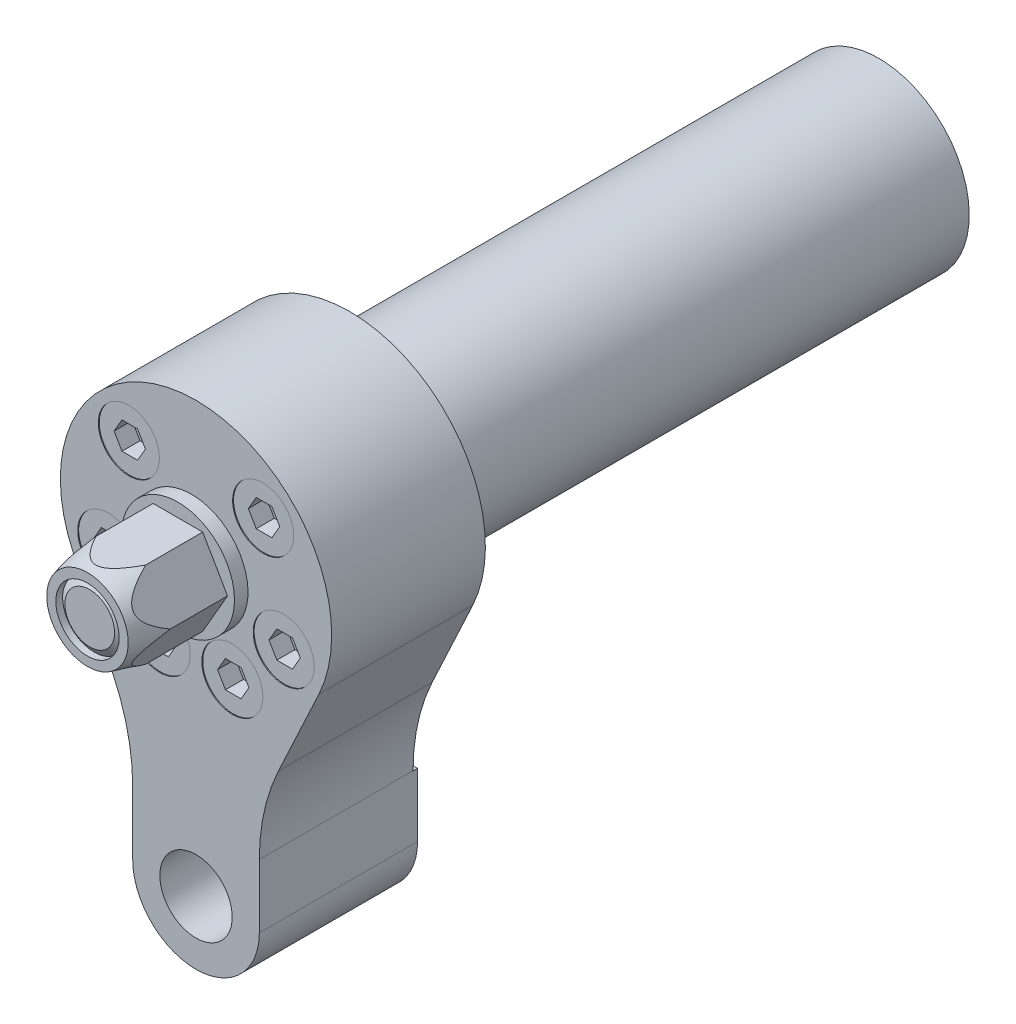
ISO-10303-21;
HEADER;
FILE_DESCRIPTION(('STEP AP214'),'2;1');
FILE_NAME('part.step','',(''),(''),'','','');
FILE_SCHEMA(('AUTOMOTIVE_DESIGN { 1 0 10303 214 1 1 1 1 }'));
ENDSEC;
DATA;
#1=APPLICATION_CONTEXT('core data for automotive mechanical design processes');
#2=APPLICATION_PROTOCOL_DEFINITION('international standard','automotive_design',2000,#1);
#3=PRODUCT_CONTEXT('',#1,'mechanical');
#4=PRODUCT('Part','Part','',(#3));
#5=PRODUCT_RELATED_PRODUCT_CATEGORY('part','',(#4));
#6=PRODUCT_DEFINITION_FORMATION('','',#4);
#7=PRODUCT_DEFINITION_CONTEXT('part definition',#1,'design');
#8=PRODUCT_DEFINITION('design','',#6,#7);
#9=PRODUCT_DEFINITION_SHAPE('','',#8);
#10=(LENGTH_UNIT() NAMED_UNIT(*) SI_UNIT(.MILLI.,.METRE.));
#11=(NAMED_UNIT(*) PLANE_ANGLE_UNIT() SI_UNIT($,.RADIAN.));
#12=(NAMED_UNIT(*) SI_UNIT($,.STERADIAN.) SOLID_ANGLE_UNIT());
#13=UNCERTAINTY_MEASURE_WITH_UNIT(LENGTH_MEASURE(1.E-05),#10,'distance_accuracy_value','');
#14=(GEOMETRIC_REPRESENTATION_CONTEXT(3) GLOBAL_UNCERTAINTY_ASSIGNED_CONTEXT((#13)) GLOBAL_UNIT_ASSIGNED_CONTEXT((#10,
#11,#12)) REPRESENTATION_CONTEXT('',''));
#15=CARTESIAN_POINT('',(0.,0.,0.));
#16=DIRECTION('',(0.,0.,1.));
#17=DIRECTION('',(1.,0.,0.));
#18=AXIS2_PLACEMENT_3D('',#15,#16,#17);
#19=CARTESIAN_POINT('',(0.,0.,119.5));
#20=DIRECTION('',(0.,0.,-1.));
#21=DIRECTION('',(0.771388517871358,0.636364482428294,0.));
#22=AXIS2_PLACEMENT_3D('',#19,#20,#21);
#23=PLANE('',#22);
#24=CARTESIAN_POINT('',(0.,0.,119.5));
#25=DIRECTION('',(0.,0.,-1.));
#26=DIRECTION('',(0.771388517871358,0.636364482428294,0.));
#27=AXIS2_PLACEMENT_3D('',#24,#25,#26);
#28=CIRCLE('',#27,5.5);
#29=CARTESIAN_POINT('',(4.24263684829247,3.50000465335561,119.5));
#30=VERTEX_POINT('',#29);
#31=EDGE_CURVE('E9',#30,#30,#28,.T.);
#32=ORIENTED_EDGE('',*,*,#31,.F.);
#33=EDGE_LOOP('',(#32));
#34=FACE_BOUND('',#33,.T.);
#35=ADVANCED_FACE('F14',(#34),#23,.F.);
#36=CARTESIAN_POINT('',(0.,0.,119.5));
#37=DIRECTION('',(0.,0.,-1.));
#38=DIRECTION('',(0.771388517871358,0.636364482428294,0.));
#39=AXIS2_PLACEMENT_3D('',#36,#37,#38);
#40=CONICAL_SURFACE('',#39,5.5,0.982793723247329);
#41=CARTESIAN_POINT('',(0.,0.,118.5));
#42=DIRECTION('',(0.,0.,-1.));
#43=DIRECTION('',(0.771388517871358,0.636364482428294,0.));
#44=AXIS2_PLACEMENT_3D('',#41,#42,#43);
#45=CIRCLE('',#44,7.);
#46=CARTESIAN_POINT('',(5.39971962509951,4.45455137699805,118.5));
#47=VERTEX_POINT('',#46);
#48=EDGE_CURVE('E23',#47,#47,#45,.T.);
#49=ORIENTED_EDGE('',*,*,#48,.F.);
#50=EDGE_LOOP('',(#49));
#51=FACE_BOUND('',#50,.T.);
#52=ORIENTED_EDGE('',*,*,#31,.T.);
#53=EDGE_LOOP('',(#52));
#54=FACE_BOUND('',#53,.T.);
#55=ADVANCED_FACE('F858',(#51,#54),#40,.T.);
#56=CARTESIAN_POINT('',(0.,0.,97.));
#57=DIRECTION('',(0.,0.,-1.));
#58=DIRECTION('',(0.,-1.,0.));
#59=AXIS2_PLACEMENT_3D('',#56,#57,#58);
#60=PLANE('',#59);
#61=CARTESIAN_POINT('',(0.,0.,96.99999999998));
#62=DIRECTION('',(0.,0.,-1.));
#63=DIRECTION('',(-1.,0.,0.));
#64=AXIS2_PLACEMENT_3D('',#61,#62,#63);
#65=CIRCLE('',#64,8.);
#66=CARTESIAN_POINT('',(-8.,0.,96.99999999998));
#67=VERTEX_POINT('',#66);
#68=EDGE_CURVE('E772',#67,#67,#65,.T.);
#69=ORIENTED_EDGE('',*,*,#68,.F.);
#70=EDGE_LOOP('',(#69));
#71=FACE_BOUND('',#70,.T.);
#72=CARTESIAN_POINT('',(0.,0.,97.));
#73=DIRECTION('',(0.,0.,-1.));
#74=DIRECTION('',(0.,-1.,0.));
#75=AXIS2_PLACEMENT_3D('',#72,#73,#74);
#76=CIRCLE('',#75,12.5);
#77=CARTESIAN_POINT('',(0.,-12.5,97.));
#78=VERTEX_POINT('',#77);
#79=EDGE_CURVE('E896',#78,#78,#76,.T.);
#80=ORIENTED_EDGE('',*,*,#79,.T.);
#81=EDGE_LOOP('',(#80));
#82=FACE_BOUND('',#81,.T.);
#83=ADVANCED_FACE('F855',(#71,#82),#60,.T.);
#84=CARTESIAN_POINT('',(0.,0.,97.));
#85=DIRECTION('',(0.,0.,-1.));
#86=DIRECTION('',(0.,-1.,0.));
#87=AXIS2_PLACEMENT_3D('',#84,#85,#86);
#88=CYLINDRICAL_SURFACE('',#87,12.5);
#89=CARTESIAN_POINT('',(0.,0.,100.));
#90=DIRECTION('',(0.,0.,-1.));
#91=DIRECTION('',(0.,-1.,0.));
#92=AXIS2_PLACEMENT_3D('',#89,#90,#91);
#93=CIRCLE('',#92,12.5);
#94=CARTESIAN_POINT('',(0.,-12.5,100.));
#95=VERTEX_POINT('',#94);
#96=EDGE_CURVE('E18',#95,#95,#93,.T.);
#97=ORIENTED_EDGE('',*,*,#96,.T.);
#98=EDGE_LOOP('',(#97));
#99=FACE_BOUND('',#98,.T.);
#100=ORIENTED_EDGE('',*,*,#79,.F.);
#101=EDGE_LOOP('',(#100));
#102=FACE_BOUND('',#101,.T.);
#103=ADVANCED_FACE('F857',(#99,#102),#88,.T.);
#104=CARTESIAN_POINT('',(0.,0.,100.));
#105=DIRECTION('',(0.,0.,1.));
#106=DIRECTION('',(0.,1.,0.));
#107=AXIS2_PLACEMENT_3D('',#104,#105,#106);
#108=PLANE('',#107);
#109=ORIENTED_EDGE('',*,*,#96,.F.);
#110=EDGE_LOOP('',(#109));
#111=FACE_BOUND('',#110,.T.);
#112=DIRECTION('',(0.5,-0.866025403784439,0.));
#113=VECTOR('',#112,1.);
#114=CARTESIAN_POINT('',(-10.9696551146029,0.,100.));
#115=LINE('',#114,#113);
#116=CARTESIAN_POINT('',(-10.9696551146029,0.,100.));
#117=VERTEX_POINT('',#116);
#118=CARTESIAN_POINT('',(-5.48482755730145,-9.5,100.));
#119=VERTEX_POINT('',#118);
#120=EDGE_CURVE('E892',#117,#119,#115,.T.);
#121=ORIENTED_EDGE('',*,*,#120,.F.);
#122=DIRECTION('',(-0.5,-0.866025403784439,0.));
#123=VECTOR('',#122,1.);
#124=CARTESIAN_POINT('',(-5.48482755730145,9.5,100.));
#125=LINE('',#124,#123);
#126=CARTESIAN_POINT('',(-5.48482755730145,9.5,100.));
#127=VERTEX_POINT('',#126);
#128=EDGE_CURVE('E909',#127,#117,#125,.T.);
#129=ORIENTED_EDGE('',*,*,#128,.F.);
#130=DIRECTION('',(-1.,0.,0.));
#131=VECTOR('',#130,1.);
#132=CARTESIAN_POINT('',(5.48482755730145,9.5,100.));
#133=LINE('',#132,#131);
#134=CARTESIAN_POINT('',(5.48482755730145,9.5,100.));
#135=VERTEX_POINT('',#134);
#136=EDGE_CURVE('E920',#135,#127,#133,.T.);
#137=ORIENTED_EDGE('',*,*,#136,.F.);
#138=DIRECTION('',(-0.5,0.866025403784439,0.));
#139=VECTOR('',#138,1.);
#140=CARTESIAN_POINT('',(10.9696551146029,0.,100.));
#141=LINE('',#140,#139);
#142=CARTESIAN_POINT('',(10.9696551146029,0.,100.));
#143=VERTEX_POINT('',#142);
#144=EDGE_CURVE('E918',#143,#135,#141,.T.);
#145=ORIENTED_EDGE('',*,*,#144,.F.);
#146=DIRECTION('',(0.5,0.866025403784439,0.));
#147=VECTOR('',#146,1.);
#148=CARTESIAN_POINT('',(5.48482755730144,-9.5,100.));
#149=LINE('',#148,#147);
#150=CARTESIAN_POINT('',(5.48482755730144,-9.5,100.));
#151=VERTEX_POINT('',#150);
#152=EDGE_CURVE('E913',#151,#143,#149,.T.);
#153=ORIENTED_EDGE('',*,*,#152,.F.);
#154=DIRECTION('',(1.,0.,0.));
#155=VECTOR('',#154,1.);
#156=CARTESIAN_POINT('',(-5.48482755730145,-9.5,100.));
#157=LINE('',#156,#155);
#158=EDGE_CURVE('E911',#119,#151,#157,.T.);
#159=ORIENTED_EDGE('',*,*,#158,.F.);
#160=EDGE_LOOP('',(#121,#129,#137,#145,#153,#159));
#161=FACE_BOUND('',#160,.T.);
#162=ADVANCED_FACE('F16',(#111,#161),#108,.T.);
#163=CARTESIAN_POINT('',(-5.48482755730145,9.5,120.));
#164=DIRECTION('',(0.866025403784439,-0.5,0.));
#165=DIRECTION('',(0.5,0.866025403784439,0.));
#166=AXIS2_PLACEMENT_3D('',#163,#164,#165);
#167=PLANE('',#166);
#168=DIRECTION('',(0.,0.,-1.));
#169=VECTOR('',#168,1.);
#170=CARTESIAN_POINT('',(-10.9696551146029,0.,120.));
#171=LINE('',#170,#169);
#172=CARTESIAN_POINT('',(-10.9696551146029,0.,112.649147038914));
#173=VERTEX_POINT('',#172);
#174=EDGE_CURVE('E894',#173,#117,#171,.T.);
#175=ORIENTED_EDGE('',*,*,#174,.F.);
#176=CARTESIAN_POINT('',(-10.9697087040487,-9.28196428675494E-05,112.648947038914));
#177=CARTESIAN_POINT('',(-10.9330785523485,0.0633524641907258,112.785646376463));
#178=CARTESIAN_POINT('',(-10.8960248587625,0.127531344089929,112.921890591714));
#179=CARTESIAN_POINT('',(-10.8209722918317,0.257526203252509,113.193348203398));
#180=CARTESIAN_POINT('',(-10.7829733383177,0.323342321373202,113.328561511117));
#181=CARTESIAN_POINT('',(-10.6672822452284,0.523725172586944,113.732923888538));
#182=CARTESIAN_POINT('',(-10.5880270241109,0.660999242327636,114.000302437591));
#183=CARTESIAN_POINT('',(-10.4234018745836,0.946138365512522,114.531840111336));
#184=CARTESIAN_POINT('',(-10.3379706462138,1.09410959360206,114.795923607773));
#185=CARTESIAN_POINT('',(-10.160474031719,1.40154274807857,115.314863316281));
#186=CARTESIAN_POINT('',(-10.0684140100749,1.56099538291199,115.569726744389));
#187=CARTESIAN_POINT('',(-9.92649201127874,1.80681149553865,115.934935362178));
#188=CARTESIAN_POINT('',(-9.88001165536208,1.88731783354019,116.050540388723));
#189=CARTESIAN_POINT('',(-9.78481012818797,2.05221171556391,116.278040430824));
#190=CARTESIAN_POINT('',(-9.7360886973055,2.1365997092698,116.389935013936));
#191=CARTESIAN_POINT('',(-9.63611739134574,2.30975509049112,116.609013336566));
#192=CARTESIAN_POINT('',(-9.58486915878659,2.39851963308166,116.716200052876));
#193=CARTESIAN_POINT('',(-9.47945169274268,2.58110804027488,116.924631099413));
#194=CARTESIAN_POINT('',(-9.425283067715,2.67493085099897,117.025876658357));
#195=CARTESIAN_POINT('',(-9.28188994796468,2.92329501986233,117.276159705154));
#196=CARTESIAN_POINT('',(-9.19021364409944,3.08208303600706,117.41971983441));
#197=CARTESIAN_POINT('',(-8.99721500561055,3.41636648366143,117.678122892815));
#198=CARTESIAN_POINT('',(-8.89592188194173,3.59181132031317,117.793049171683));
#199=CARTESIAN_POINT('',(-8.71880220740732,3.89859159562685,117.948502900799));
#200=CARTESIAN_POINT('',(-8.64565787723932,4.02528129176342,118.001064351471));
#201=CARTESIAN_POINT('',(-8.4960507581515,4.28440842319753,118.081593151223));
#202=CARTESIAN_POINT('',(-8.41959251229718,4.4168379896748,118.109593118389));
#203=CARTESIAN_POINT('',(-8.26491898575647,4.68474039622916,118.137572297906));
#204=CARTESIAN_POINT('',(-8.18669619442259,4.82022624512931,118.137391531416));
#205=CARTESIAN_POINT('',(-8.03157526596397,5.0889035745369,118.108641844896));
#206=CARTESIAN_POINT('',(-7.95467796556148,5.22209360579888,118.080055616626));
#207=CARTESIAN_POINT('',(-7.78847285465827,5.50996930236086,117.989492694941));
#208=CARTESIAN_POINT('',(-7.69996879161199,5.6632628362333,117.921744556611));
#209=CARTESIAN_POINT('',(-7.52946185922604,5.9585895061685,117.759068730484));
#210=CARTESIAN_POINT('',(-7.44747437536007,6.10059599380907,117.664079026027));
#211=CARTESIAN_POINT('',(-7.29876562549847,6.35816710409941,117.46665369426));
#212=CARTESIAN_POINT('',(-7.23136112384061,6.4749151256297,117.36622597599));
#213=CARTESIAN_POINT('',(-7.10105318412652,6.70061509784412,117.154196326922));
#214=CARTESIAN_POINT('',(-7.03815385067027,6.80955993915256,117.042584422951));
#215=CARTESIAN_POINT('',(-6.91587940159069,7.02134549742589,116.810311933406));
#216=CARTESIAN_POINT('',(-6.85653217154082,7.12413791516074,116.689593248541));
#217=CARTESIAN_POINT('',(-6.74128628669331,7.32374964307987,116.441879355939));
#218=CARTESIAN_POINT('',(-6.68538625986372,7.42057132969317,116.314886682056));
#219=CARTESIAN_POINT('',(-6.57327560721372,7.61475267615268,116.048320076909));
#220=CARTESIAN_POINT('',(-6.51724378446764,7.71180263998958,115.908446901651));
#221=CARTESIAN_POINT('',(-6.40796919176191,7.90107178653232,115.624393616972));
#222=CARTESIAN_POINT('',(-6.3547269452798,7.99329006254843,115.480212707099));
#223=CARTESIAN_POINT('',(-6.19844621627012,8.2639762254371,115.042219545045));
#224=CARTESIAN_POINT('',(-6.09899135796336,8.43623709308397,114.743293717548));
#225=CARTESIAN_POINT('',(-5.9108465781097,8.76211341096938,114.147735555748));
#226=CARTESIAN_POINT('',(-5.82189415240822,8.91618353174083,113.851429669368));
#227=CARTESIAN_POINT('',(-5.69255103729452,9.14021237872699,113.402944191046));
#228=CARTESIAN_POINT('',(-5.65018376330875,9.21359464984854,113.253027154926));
#229=CARTESIAN_POINT('',(-5.56662875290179,9.35831617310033,112.951907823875));
#230=CARTESIAN_POINT('',(-5.52544086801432,9.42965568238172,112.800705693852));
#231=CARTESIAN_POINT('',(-5.48477396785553,9.50009281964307,112.648947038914));
#232=B_SPLINE_CURVE_WITH_KNOTS('',3,(#176,#177,#178,#179,#180,#181,#182,#183,#184,#185,#186,
#187,#188,#189,#190,#191,#192,#193,#194,#195,#196,#197,#198,#199,#200,#201,#202,#203,#204,#205,
#206,#207,#208,#209,#210,#211,#212,#213,#214,#215,#216,#217,#218,#219,#220,#221,#222,#223,#224,
#225,#226,#227,#228,#229,#230,#231),.UNSPECIFIED.,.F.,.F.,(4,2,2,2,2,2,2,2,2,2,2,2,2,2,2,2,2,2,
2,2,2,2,2,2,2,2,2,4),(0.,0.465271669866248,0.930582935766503,1.862880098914,2.80621835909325,
3.7488016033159,4.19374668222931,4.63874343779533,5.08345464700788,5.52807355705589,
6.22496409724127,6.91980172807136,7.38441639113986,7.84841309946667,8.31504396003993,
8.78195932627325,9.34736634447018,9.91407089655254,10.4176521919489,10.921686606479,
11.429264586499,11.9366392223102,12.474153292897,13.0117678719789,14.088299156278,
15.1248861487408,15.6414873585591,16.1580232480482),.UNSPECIFIED.);
#233=CARTESIAN_POINT('',(-5.48482755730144,9.5,112.649147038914));
#234=VERTEX_POINT('',#233);
#235=EDGE_CURVE('E840',#173,#234,#232,.T.);
#236=ORIENTED_EDGE('',*,*,#235,.T.);
#237=DIRECTION('',(0.,0.,-1.));
#238=VECTOR('',#237,1.);
#239=CARTESIAN_POINT('',(-5.48482755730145,9.5,120.));
#240=LINE('',#239,#238);
#241=EDGE_CURVE('E922',#234,#127,#240,.T.);
#242=ORIENTED_EDGE('',*,*,#241,.T.);
#243=ORIENTED_EDGE('',*,*,#128,.T.);
#244=EDGE_LOOP('',(#175,#236,#242,#243));
#245=FACE_BOUND('',#244,.T.);
#246=ADVANCED_FACE('F805',(#245),#167,.F.);
#247=CARTESIAN_POINT('',(5.48482755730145,9.5,120.));
#248=DIRECTION('',(0.,-1.,0.));
#249=DIRECTION('',(1.,0.,0.));
#250=AXIS2_PLACEMENT_3D('',#247,#248,#249);
#251=PLANE('',#250);
#252=ORIENTED_EDGE('',*,*,#241,.F.);
#253=CARTESIAN_POINT('',(10.5930853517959,9.5,100.485235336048));
#254=CARTESIAN_POINT('',(10.3867862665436,9.5,101.058272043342));
#255=CARTESIAN_POINT('',(10.1781960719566,9.5,101.630495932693));
#256=CARTESIAN_POINT('',(9.7553161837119,9.5,102.772968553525));
#257=CARTESIAN_POINT('',(9.54102530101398,9.5,103.343216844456));
#258=CARTESIAN_POINT('',(9.10382949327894,9.5,104.486069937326));
#259=CARTESIAN_POINT('',(8.88086608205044,9.5,105.058652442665));
#260=CARTESIAN_POINT('',(8.42656753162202,9.5,106.200399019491));
#261=CARTESIAN_POINT('',(8.19523355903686,9.5,106.76956355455));
#262=CARTESIAN_POINT('',(7.69638648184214,9.5,107.965186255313));
#263=CARTESIAN_POINT('',(7.42767382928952,9.5,108.591148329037));
#264=CARTESIAN_POINT('',(7.01176021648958,9.5,109.524551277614));
#265=CARTESIAN_POINT('',(6.87094481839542,9.5,109.834838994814));
#266=CARTESIAN_POINT('',(6.58430638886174,9.5,110.453088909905));
#267=CARTESIAN_POINT('',(6.43848350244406,9.5,110.76105117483));
#268=CARTESIAN_POINT('',(6.14151865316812,9.5,111.372877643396));
#269=CARTESIAN_POINT('',(5.99040045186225,9.5,111.676753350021));
#270=CARTESIAN_POINT('',(5.68113249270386,9.5,112.280894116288));
#271=CARTESIAN_POINT('',(5.52298323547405,9.5,112.581159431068));
#272=CARTESIAN_POINT('',(5.19822051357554,9.5,113.176791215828));
#273=CARTESIAN_POINT('',(5.03161371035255,9.5,113.472161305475));
#274=CARTESIAN_POINT('',(4.68775946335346,9.5,114.056614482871));
#275=CARTESIAN_POINT('',(4.51051470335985,9.5,114.345699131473));
#276=CARTESIAN_POINT('',(4.25847143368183,9.5,114.735535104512));
#277=CARTESIAN_POINT('',(4.18955111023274,9.5,114.840095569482));
#278=CARTESIAN_POINT('',(4.04964371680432,9.5,115.047827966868));
#279=CARTESIAN_POINT('',(3.97865658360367,9.5,115.150999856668));
#280=CARTESIAN_POINT('',(3.76219828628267,9.5,115.458244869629));
#281=CARTESIAN_POINT('',(3.61330113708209,9.5,115.659936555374));
#282=CARTESIAN_POINT('',(3.30570634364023,9.5,116.052671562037));
#283=CARTESIAN_POINT('',(3.14711585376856,9.5,116.243798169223));
#284=CARTESIAN_POINT('',(2.81619521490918,9.5,116.613648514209));
#285=CARTESIAN_POINT('',(2.6438790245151,9.5,116.792384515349));
#286=CARTESIAN_POINT('',(2.3171328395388,9.5,117.098374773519));
#287=CARTESIAN_POINT('',(2.16577693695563,9.5,117.228867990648));
#288=CARTESIAN_POINT('',(1.84943658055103,9.5,117.47300937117));
#289=CARTESIAN_POINT('',(1.68443082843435,9.5,117.586630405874));
#290=CARTESIAN_POINT('',(1.3365493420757,9.5,117.79060023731));
#291=CARTESIAN_POINT('',(1.15343980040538,9.5,117.880568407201));
#292=CARTESIAN_POINT('',(0.868668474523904,9.5,117.987805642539));
#293=CARTESIAN_POINT('',(0.772184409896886,9.5,118.018911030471));
#294=CARTESIAN_POINT('',(0.576470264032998,9.5,118.070628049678));
#295=CARTESIAN_POINT('',(0.477241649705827,9.5,118.09124517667));
#296=CARTESIAN_POINT('',(0.231365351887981,9.5,118.127603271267));
#297=CARTESIAN_POINT('',(0.083688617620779,9.5,118.13685521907));
#298=CARTESIAN_POINT('',(-0.211017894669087,9.5,118.12950171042));
#299=CARTESIAN_POINT('',(-0.358047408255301,9.5,118.112886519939));
#300=CARTESIAN_POINT('',(-0.646523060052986,9.5,118.056020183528));
#301=CARTESIAN_POINT('',(-0.787994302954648,9.5,118.015892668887));
#302=CARTESIAN_POINT('',(-1.06373187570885,9.5,117.916094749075));
#303=CARTESIAN_POINT('',(-1.19799615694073,9.5,117.856418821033));
#304=CARTESIAN_POINT('',(-1.44574007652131,9.5,117.728399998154));
#305=CARTESIAN_POINT('',(-1.55996843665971,9.5,117.661474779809));
#306=CARTESIAN_POINT('',(-1.78215011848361,9.5,117.517828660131));
#307=CARTESIAN_POINT('',(-1.89009841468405,9.5,117.441100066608));
#308=CARTESIAN_POINT('',(-2.10050135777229,9.5,117.279714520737));
#309=CARTESIAN_POINT('',(-2.20293315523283,9.5,117.195028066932));
#310=CARTESIAN_POINT('',(-2.40241915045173,9.5,117.019647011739));
#311=CARTESIAN_POINT('',(-2.49947492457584,9.5,116.928954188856));
#312=CARTESIAN_POINT('',(-2.73414563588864,9.5,116.698256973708));
#313=CARTESIAN_POINT('',(-2.86896111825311,9.5,116.555411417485));
#314=CARTESIAN_POINT('',(-3.13002980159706,9.5,116.262051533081));
#315=CARTESIAN_POINT('',(-3.25627818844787,9.5,116.111532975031));
#316=CARTESIAN_POINT('',(-3.50179075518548,9.5,115.804480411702));
#317=CARTESIAN_POINT('',(-3.62104165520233,9.5,115.647935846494));
#318=CARTESIAN_POINT('',(-3.85346172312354,9.5,115.330389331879));
#319=CARTESIAN_POINT('',(-3.96663011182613,9.5,115.169386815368));
#320=CARTESIAN_POINT('',(-4.18907157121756,9.5,114.841976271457));
#321=CARTESIAN_POINT('',(-4.29828386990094,9.5,114.675527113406));
#322=CARTESIAN_POINT('',(-4.51216387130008,9.5,114.339733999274));
#323=CARTESIAN_POINT('',(-4.61683137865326,9.5,114.170389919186));
#324=CARTESIAN_POINT('',(-4.82209575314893,9.5,113.829560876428));
#325=CARTESIAN_POINT('',(-4.92269778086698,9.5,113.658079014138));
#326=CARTESIAN_POINT('',(-5.12046278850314,9.5,113.313158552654));
#327=CARTESIAN_POINT('',(-5.21762590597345,9.5,113.13972003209));
#328=CARTESIAN_POINT('',(-5.5425866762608,9.5,112.547766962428));
#329=CARTESIAN_POINT('',(-5.76327055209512,9.5,112.125341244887));
#330=CARTESIAN_POINT('',(-6.19163008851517,9.5,111.273919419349));
#331=CARTESIAN_POINT('',(-6.39930328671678,9.5,110.844922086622));
#332=CARTESIAN_POINT('',(-6.80452894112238,9.5,109.981886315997));
#333=CARTESIAN_POINT('',(-7.00207547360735,9.5,109.547845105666));
#334=CARTESIAN_POINT('',(-7.38893726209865,9.5,108.676106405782));
#335=CARTESIAN_POINT('',(-7.57825222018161,9.5,108.238408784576));
#336=CARTESIAN_POINT('',(-7.95071358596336,9.5,107.358755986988));
#337=CARTESIAN_POINT('',(-8.13383837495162,9.5,106.916791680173));
#338=CARTESIAN_POINT('',(-8.49441316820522,9.5,106.030551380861));
#339=CARTESIAN_POINT('',(-8.67186308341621,9.5,105.586275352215));
#340=CARTESIAN_POINT('',(-9.02189582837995,9.5,104.695998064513));
#341=CARTESIAN_POINT('',(-9.19448038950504,9.5,104.249997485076));
#342=CARTESIAN_POINT('',(-9.53553537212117,9.5,103.356424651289));
#343=CARTESIAN_POINT('',(-9.70400576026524,9.5,102.908852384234));
#344=CARTESIAN_POINT('',(-10.1663281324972,9.5,101.665705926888));
#345=CARTESIAN_POINT('',(-10.4563743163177,9.5,100.868716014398));
#346=CARTESIAN_POINT('',(-11.0276878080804,9.5,99.2715157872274));
#347=CARTESIAN_POINT('',(-11.3089542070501,9.5,98.4713051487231));
#348=CARTESIAN_POINT('',(-11.8626348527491,9.5,96.8733796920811));
#349=CARTESIAN_POINT('',(-12.135093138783,9.5,96.0756801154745));
#350=CARTESIAN_POINT('',(-12.5394021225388,9.5,94.8777208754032));
#351=CARTESIAN_POINT('',(-12.6734326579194,9.5,94.4781946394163));
#352=CARTESIAN_POINT('',(-12.940161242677,9.5,93.6786991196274));
#353=CARTESIAN_POINT('',(-13.07285929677,9.5,93.278729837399));
#354=CARTESIAN_POINT('',(-13.204951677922,9.5,92.8785604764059));
#355=B_SPLINE_CURVE_WITH_KNOTS('',3,(#253,#254,#255,#256,#257,#258,#259,#260,#261,#262,#263,
#264,#265,#266,#267,#268,#269,#270,#271,#272,#273,#274,#275,#276,#277,#278,#279,#280,#281,#282,
#283,#284,#285,#286,#287,#288,#289,#290,#291,#292,#293,#294,#295,#296,#297,#298,#299,#300,#301,
#302,#303,#304,#305,#306,#307,#308,#309,#310,#311,#312,#313,#314,#315,#316,#317,#318,#319,#320,
#321,#322,#323,#324,#325,#326,#327,#328,#329,#330,#331,#332,#333,#334,#335,#336,#337,#338,#339,
#340,#341,#342,#343,#344,#345,#346,#347,#348,#349,#350,#351,#352,#353,#354),.UNSPECIFIED.,.F.,
.F.,(4,2,2,2,2,2,2,2,2,2,2,2,2,2,2,2,2,2,2,2,2,2,2,2,2,2,2,2,2,2,2,2,2,2,2,2,2,2,2,2,2,2,2,2,2,
2,2,2,2,2,4),(0.,1.82713326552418,3.65465066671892,5.49797926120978,7.34105193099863,
9.38443436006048,10.4066360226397,11.4288081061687,12.4468675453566,13.4648546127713,
14.4820519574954,15.498993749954,15.874666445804,16.2503506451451,17.0021133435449,
17.746697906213,18.4905346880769,19.0891789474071,19.6887755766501,20.2975003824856,
20.6011206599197,20.9045816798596,21.3461445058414,21.7878735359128,22.2273004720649,
22.6668516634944,23.063430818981,23.4603230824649,23.8587495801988,24.257058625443,
24.8458435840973,25.4349567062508,26.0251539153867,26.6154265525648,27.2125787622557,
27.809756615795,28.406150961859,29.0025214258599,30.431961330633,31.861670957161,
33.2922075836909,34.7227959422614,36.1579506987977,37.5931279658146,39.0277878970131,
40.4624594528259,43.0067672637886,45.5513376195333,48.0801468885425,49.3443715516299,
50.6085917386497),.UNSPECIFIED.);
#356=CARTESIAN_POINT('',(5.48482755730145,9.5,112.649147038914));
#357=VERTEX_POINT('',#356);
#358=EDGE_CURVE('E783',#234,#357,#355,.F.);
#359=ORIENTED_EDGE('',*,*,#358,.T.);
#360=DIRECTION('',(0.,0.,-1.));
#361=VECTOR('',#360,1.);
#362=CARTESIAN_POINT('',(5.48482755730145,9.5,120.));
#363=LINE('',#362,#361);
#364=EDGE_CURVE('E38',#357,#135,#363,.T.);
#365=ORIENTED_EDGE('',*,*,#364,.T.);
#366=ORIENTED_EDGE('',*,*,#136,.T.);
#367=EDGE_LOOP('',(#252,#359,#365,#366));
#368=FACE_BOUND('',#367,.T.);
#369=ADVANCED_FACE('F801',(#368),#251,.F.);
#370=CARTESIAN_POINT('',(10.9696551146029,0.,120.));
#371=DIRECTION('',(-0.866025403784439,-0.5,0.));
#372=DIRECTION('',(0.5,-0.866025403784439,0.));
#373=AXIS2_PLACEMENT_3D('',#370,#371,#372);
#374=PLANE('',#373);
#375=ORIENTED_EDGE('',*,*,#364,.F.);
#376=CARTESIAN_POINT('',(5.48477396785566,9.50009281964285,112.648947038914));
#377=CARTESIAN_POINT('',(5.5214041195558,9.43664753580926,112.785646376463));
#378=CARTESIAN_POINT('',(5.5584578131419,9.37246865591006,112.921890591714));
#379=CARTESIAN_POINT('',(5.63351038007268,9.24247379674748,113.193348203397));
#380=CARTESIAN_POINT('',(5.67150933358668,9.17665767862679,113.328561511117));
#381=CARTESIAN_POINT('',(5.78720042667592,8.97627482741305,113.732923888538));
#382=CARTESIAN_POINT('',(5.86645564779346,8.83900075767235,114.000302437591));
#383=CARTESIAN_POINT('',(6.03108079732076,8.55386163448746,114.531840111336));
#384=CARTESIAN_POINT('',(6.11651202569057,8.40589040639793,114.795923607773));
#385=CARTESIAN_POINT('',(6.2940086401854,8.09845725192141,115.314863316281));
#386=CARTESIAN_POINT('',(6.38606866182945,7.93900461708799,115.569726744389));
#387=CARTESIAN_POINT('',(6.52799066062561,7.69318850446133,115.934935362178));
#388=CARTESIAN_POINT('',(6.57447101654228,7.61268216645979,116.050540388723));
#389=CARTESIAN_POINT('',(6.6696725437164,7.44778828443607,116.278040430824));
#390=CARTESIAN_POINT('',(6.71839397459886,7.36340029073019,116.389935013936));
#391=CARTESIAN_POINT('',(6.81836528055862,7.19024490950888,116.609013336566));
#392=CARTESIAN_POINT('',(6.86961351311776,7.10148036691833,116.716200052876));
#393=CARTESIAN_POINT('',(6.97503097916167,6.91889195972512,116.924631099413));
#394=CARTESIAN_POINT('',(7.02919960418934,6.82506914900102,117.025876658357));
#395=CARTESIAN_POINT('',(7.17259272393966,6.57670498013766,117.276159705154));
#396=CARTESIAN_POINT('',(7.26426902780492,6.41791696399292,117.41971983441));
#397=CARTESIAN_POINT('',(7.45726766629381,6.08363351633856,117.678122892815));
#398=CARTESIAN_POINT('',(7.5585607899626,5.90818867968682,117.793049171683));
#399=CARTESIAN_POINT('',(7.73568046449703,5.60140840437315,117.948502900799));
#400=CARTESIAN_POINT('',(7.80882479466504,5.47471870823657,118.001064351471));
#401=CARTESIAN_POINT('',(7.95843191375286,5.21559157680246,118.081593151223));
#402=CARTESIAN_POINT('',(8.03489015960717,5.08316201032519,118.109593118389));
#403=CARTESIAN_POINT('',(8.18956368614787,4.81525960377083,118.137572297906));
#404=CARTESIAN_POINT('',(8.26778647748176,4.67977375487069,118.137391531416));
#405=CARTESIAN_POINT('',(8.42290740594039,4.4110964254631,118.108641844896));
#406=CARTESIAN_POINT('',(8.49980470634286,4.27790639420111,118.080055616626));
#407=CARTESIAN_POINT('',(8.66600981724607,3.99003069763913,117.989492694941));
#408=CARTESIAN_POINT('',(8.75451388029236,3.8367371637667,117.921744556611));
#409=CARTESIAN_POINT('',(8.92502081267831,3.54141049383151,117.759068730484));
#410=CARTESIAN_POINT('',(9.00700829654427,3.39940400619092,117.664079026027));
#411=CARTESIAN_POINT('',(9.15571704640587,3.14183289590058,117.46665369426));
#412=CARTESIAN_POINT('',(9.22312154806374,3.02508487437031,117.36622597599));
#413=CARTESIAN_POINT('',(9.35342948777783,2.79938490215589,117.154196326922));
#414=CARTESIAN_POINT('',(9.41632882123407,2.69044006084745,117.042584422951));
#415=CARTESIAN_POINT('',(9.53860327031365,2.47865450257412,116.810311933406));
#416=CARTESIAN_POINT('',(9.59795050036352,2.37586208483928,116.689593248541));
#417=CARTESIAN_POINT('',(9.71319638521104,2.17625035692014,116.441879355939));
#418=CARTESIAN_POINT('',(9.76909641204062,2.07942867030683,116.314886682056));
#419=CARTESIAN_POINT('',(9.88120706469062,1.88524732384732,116.048320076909));
#420=CARTESIAN_POINT('',(9.9372388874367,1.78819736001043,115.908446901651));
#421=CARTESIAN_POINT('',(10.0465134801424,1.59892821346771,115.624393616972));
#422=CARTESIAN_POINT('',(10.0997557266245,1.50670993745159,115.480212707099));
#423=CARTESIAN_POINT('',(10.2560364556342,1.23602377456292,115.042219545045));
#424=CARTESIAN_POINT('',(10.355491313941,1.06376290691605,114.743293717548));
#425=CARTESIAN_POINT('',(10.5436360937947,0.737886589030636,114.147735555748));
#426=CARTESIAN_POINT('',(10.6325885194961,0.583816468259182,113.851429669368));
#427=CARTESIAN_POINT('',(10.7619316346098,0.35978762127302,113.402944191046));
#428=CARTESIAN_POINT('',(10.8042989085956,0.286405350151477,113.253027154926));
#429=CARTESIAN_POINT('',(10.8878539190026,0.141683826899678,112.951907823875));
#430=CARTESIAN_POINT('',(10.92904180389,0.0703443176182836,112.800705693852));
#431=CARTESIAN_POINT('',(10.9697087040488,-9.28196430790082E-05,112.648947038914));
#432=B_SPLINE_CURVE_WITH_KNOTS('',3,(#376,#377,#378,#379,#380,#381,#382,#383,#384,#385,#386,
#387,#388,#389,#390,#391,#392,#393,#394,#395,#396,#397,#398,#399,#400,#401,#402,#403,#404,#405,
#406,#407,#408,#409,#410,#411,#412,#413,#414,#415,#416,#417,#418,#419,#420,#421,#422,#423,#424,
#425,#426,#427,#428,#429,#430,#431),.UNSPECIFIED.,.F.,.F.,(4,2,2,2,2,2,2,2,2,2,2,2,2,2,2,2,2,2,
2,2,2,2,2,2,2,2,2,4),(0.,0.465271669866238,0.93058293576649,1.86288009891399,2.80621835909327,
3.7488016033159,4.19374668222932,4.63874343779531,5.08345464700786,5.52807355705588,
6.22496409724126,6.91980172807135,7.38441639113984,7.84841309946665,8.31504396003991,
8.78195932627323,9.34736634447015,9.91407089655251,10.4176521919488,10.9216866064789,
11.429264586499,11.9366392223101,12.474153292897,13.0117678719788,14.088299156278,
15.1248861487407,15.641487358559,16.1580232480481),.UNSPECIFIED.);
#433=CARTESIAN_POINT('',(10.9696551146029,0.,112.649147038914));
#434=VERTEX_POINT('',#433);
#435=EDGE_CURVE('E31',#357,#434,#432,.T.);
#436=ORIENTED_EDGE('',*,*,#435,.T.);
#437=DIRECTION('',(0.,0.,-1.));
#438=VECTOR('',#437,1.);
#439=CARTESIAN_POINT('',(10.9696551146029,0.,120.));
#440=LINE('',#439,#438);
#441=EDGE_CURVE('E898',#434,#143,#440,.T.);
#442=ORIENTED_EDGE('',*,*,#441,.T.);
#443=ORIENTED_EDGE('',*,*,#144,.T.);
#444=EDGE_LOOP('',(#375,#436,#442,#443));
#445=FACE_BOUND('',#444,.T.);
#446=ADVANCED_FACE('F804',(#445),#374,.F.);
#447=CARTESIAN_POINT('',(5.48482755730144,-9.5,120.));
#448=DIRECTION('',(-0.866025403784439,0.5,0.));
#449=DIRECTION('',(-0.5,-0.866025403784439,0.));
#450=AXIS2_PLACEMENT_3D('',#447,#448,#449);
#451=PLANE('',#450);
#452=ORIENTED_EDGE('',*,*,#441,.F.);
#453=CARTESIAN_POINT('',(10.9697087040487,9.28196428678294E-05,112.648947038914));
#454=CARTESIAN_POINT('',(10.9330785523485,-0.0633524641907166,112.785646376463));
#455=CARTESIAN_POINT('',(10.8960248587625,-0.127531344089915,112.921890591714));
#456=CARTESIAN_POINT('',(10.8209722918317,-0.25752620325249,113.193348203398));
#457=CARTESIAN_POINT('',(10.7829733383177,-0.323342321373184,113.328561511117));
#458=CARTESIAN_POINT('',(10.6672822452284,-0.523725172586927,113.732923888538));
#459=CARTESIAN_POINT('',(10.5880270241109,-0.660999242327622,114.000302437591));
#460=CARTESIAN_POINT('',(10.4234018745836,-0.946138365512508,114.531840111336));
#461=CARTESIAN_POINT('',(10.3379706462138,-1.09410959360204,114.795923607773));
#462=CARTESIAN_POINT('',(10.160474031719,-1.40154274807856,115.314863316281));
#463=CARTESIAN_POINT('',(10.0684140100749,-1.56099538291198,115.569726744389));
#464=CARTESIAN_POINT('',(9.92649201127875,-1.80681149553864,115.934935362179));
#465=CARTESIAN_POINT('',(9.88001165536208,-1.88731783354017,116.050540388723));
#466=CARTESIAN_POINT('',(9.78481012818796,-2.05221171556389,116.278040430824));
#467=CARTESIAN_POINT('',(9.7360886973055,-2.13659970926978,116.389935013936));
#468=CARTESIAN_POINT('',(9.63611739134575,-2.30975509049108,116.609013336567));
#469=CARTESIAN_POINT('',(9.5848691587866,-2.39851963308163,116.716200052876));
#470=CARTESIAN_POINT('',(9.47945169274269,-2.58110804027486,116.924631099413));
#471=CARTESIAN_POINT('',(9.425283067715,-2.67493085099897,117.025876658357));
#472=CARTESIAN_POINT('',(9.28188994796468,-2.92329501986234,117.276159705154));
#473=CARTESIAN_POINT('',(9.19021364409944,-3.08208303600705,117.41971983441));
#474=CARTESIAN_POINT('',(8.99721500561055,-3.4163664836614,117.678122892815));
#475=CARTESIAN_POINT('',(8.89592188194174,-3.59181132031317,117.793049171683));
#476=CARTESIAN_POINT('',(8.71880220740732,-3.89859159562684,117.948502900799));
#477=CARTESIAN_POINT('',(8.64565787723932,-4.02528129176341,118.001064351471));
#478=CARTESIAN_POINT('',(8.4960507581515,-4.28440842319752,118.081593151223));
#479=CARTESIAN_POINT('',(8.41959251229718,-4.41683798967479,118.109593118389));
#480=CARTESIAN_POINT('',(8.26491898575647,-4.68474039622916,118.137572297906));
#481=CARTESIAN_POINT('',(8.18669619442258,-4.82022624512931,118.137391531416));
#482=CARTESIAN_POINT('',(8.03157526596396,-5.0889035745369,118.108641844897));
#483=CARTESIAN_POINT('',(7.95467796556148,-5.22209360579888,118.080055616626));
#484=CARTESIAN_POINT('',(7.78847285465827,-5.50996930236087,117.989492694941));
#485=CARTESIAN_POINT('',(7.69996879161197,-5.66326283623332,117.921744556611));
#486=CARTESIAN_POINT('',(7.52946185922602,-5.9585895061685,117.759068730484));
#487=CARTESIAN_POINT('',(7.44747437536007,-6.10059599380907,117.664079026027));
#488=CARTESIAN_POINT('',(7.29876562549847,-6.35816710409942,117.46665369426));
#489=CARTESIAN_POINT('',(7.23136112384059,-6.47491512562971,117.36622597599));
#490=CARTESIAN_POINT('',(7.10105318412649,-6.70061509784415,117.154196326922));
#491=CARTESIAN_POINT('',(7.03815385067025,-6.80955993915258,117.042584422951));
#492=CARTESIAN_POINT('',(6.91587940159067,-7.02134549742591,116.810311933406));
#493=CARTESIAN_POINT('',(6.8565321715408,-7.12413791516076,116.689593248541));
#494=CARTESIAN_POINT('',(6.74128628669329,-7.32374964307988,116.441879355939));
#495=CARTESIAN_POINT('',(6.68538625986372,-7.42057132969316,116.314886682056));
#496=CARTESIAN_POINT('',(6.57327560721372,-7.61475267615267,116.048320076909));
#497=CARTESIAN_POINT('',(6.51724378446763,-7.71180263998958,115.908446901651));
#498=CARTESIAN_POINT('',(6.40796919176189,-7.90107178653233,115.624393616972));
#499=CARTESIAN_POINT('',(6.35472694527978,-7.99329006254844,115.480212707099));
#500=CARTESIAN_POINT('',(6.19844621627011,-8.2639762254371,115.042219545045));
#501=CARTESIAN_POINT('',(6.09899135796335,-8.43623709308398,114.743293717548));
#502=CARTESIAN_POINT('',(5.91084657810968,-8.76211341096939,114.147735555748));
#503=CARTESIAN_POINT('',(5.82189415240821,-8.91618353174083,113.851429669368));
#504=CARTESIAN_POINT('',(5.6925510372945,-9.14021237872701,113.402944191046));
#505=CARTESIAN_POINT('',(5.65018376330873,-9.21359464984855,113.253027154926));
#506=CARTESIAN_POINT('',(5.56662875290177,-9.35831617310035,112.951907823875));
#507=CARTESIAN_POINT('',(5.5254408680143,-9.42965568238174,112.800705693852));
#508=CARTESIAN_POINT('',(5.48477396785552,-9.50009281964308,112.648947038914));
#509=B_SPLINE_CURVE_WITH_KNOTS('',3,(#453,#454,#455,#456,#457,#458,#459,#460,#461,#462,#463,
#464,#465,#466,#467,#468,#469,#470,#471,#472,#473,#474,#475,#476,#477,#478,#479,#480,#481,#482,
#483,#484,#485,#486,#487,#488,#489,#490,#491,#492,#493,#494,#495,#496,#497,#498,#499,#500,#501,
#502,#503,#504,#505,#506,#507,#508),.UNSPECIFIED.,.F.,.F.,(4,2,2,2,2,2,2,2,2,2,2,2,2,2,2,2,2,2,
2,2,2,2,2,2,2,2,2,4),(0.,0.465271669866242,0.930582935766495,1.86288009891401,2.80621835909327,
3.74880160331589,4.19374668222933,4.63874343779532,5.08345464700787,5.5280735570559,
6.22496409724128,6.91980172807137,7.38441639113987,7.84841309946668,8.31504396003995,
8.78195932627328,9.3473663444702,9.91407089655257,10.4176521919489,10.921686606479,
11.4292645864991,11.9366392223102,12.474153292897,13.0117678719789,14.088299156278,
15.1248861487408,15.6414873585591,16.1580232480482),.UNSPECIFIED.);
#510=CARTESIAN_POINT('',(5.48482755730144,-9.5,112.649147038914));
#511=VERTEX_POINT('',#510);
#512=EDGE_CURVE('E819',#434,#511,#509,.T.);
#513=ORIENTED_EDGE('',*,*,#512,.T.);
#514=DIRECTION('',(0.,0.,-1.));
#515=VECTOR('',#514,1.);
#516=CARTESIAN_POINT('',(5.48482755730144,-9.5,120.));
#517=LINE('',#516,#515);
#518=EDGE_CURVE('E890',#511,#151,#517,.T.);
#519=ORIENTED_EDGE('',*,*,#518,.T.);
#520=ORIENTED_EDGE('',*,*,#152,.T.);
#521=EDGE_LOOP('',(#452,#513,#519,#520));
#522=FACE_BOUND('',#521,.T.);
#523=ADVANCED_FACE('F810',(#522),#451,.F.);
#524=CARTESIAN_POINT('',(-5.48482755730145,-9.5,120.));
#525=DIRECTION('',(0.,1.,0.));
#526=DIRECTION('',(-1.,0.,0.));
#527=AXIS2_PLACEMENT_3D('',#524,#525,#526);
#528=PLANE('',#527);
#529=ORIENTED_EDGE('',*,*,#518,.F.);
#530=CARTESIAN_POINT('',(10.5930853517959,-9.5,100.485235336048));
#531=CARTESIAN_POINT('',(10.3867862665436,-9.5,101.058272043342));
#532=CARTESIAN_POINT('',(10.1781960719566,-9.5,101.630495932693));
#533=CARTESIAN_POINT('',(9.7553161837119,-9.5,102.772968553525));
#534=CARTESIAN_POINT('',(9.54102530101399,-9.5,103.343216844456));
#535=CARTESIAN_POINT('',(9.10382949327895,-9.5,104.486069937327));
#536=CARTESIAN_POINT('',(8.88086608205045,-9.5,105.058652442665));
#537=CARTESIAN_POINT('',(8.42656753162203,-9.5,106.200399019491));
#538=CARTESIAN_POINT('',(8.19523355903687,-9.5,106.76956355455));
#539=CARTESIAN_POINT('',(7.69638648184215,-9.5,107.965186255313));
#540=CARTESIAN_POINT('',(7.42767382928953,-9.5,108.591148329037));
#541=CARTESIAN_POINT('',(7.01176021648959,-9.5,109.524551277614));
#542=CARTESIAN_POINT('',(6.87094481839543,-9.5,109.834838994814));
#543=CARTESIAN_POINT('',(6.58430638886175,-9.5,110.453088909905));
#544=CARTESIAN_POINT('',(6.43848350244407,-9.5,110.76105117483));
#545=CARTESIAN_POINT('',(6.14151865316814,-9.5,111.372877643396));
#546=CARTESIAN_POINT('',(5.99040045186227,-9.5,111.676753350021));
#547=CARTESIAN_POINT('',(5.68113249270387,-9.5,112.280894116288));
#548=CARTESIAN_POINT('',(5.52298323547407,-9.5,112.581159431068));
#549=CARTESIAN_POINT('',(5.19822051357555,-9.5,113.176791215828));
#550=CARTESIAN_POINT('',(5.03161371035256,-9.49999999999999,113.472161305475));
#551=CARTESIAN_POINT('',(4.68775946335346,-9.5,114.056614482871));
#552=CARTESIAN_POINT('',(4.51051470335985,-9.5,114.345699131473));
#553=CARTESIAN_POINT('',(4.25847143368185,-9.5,114.735535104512));
#554=CARTESIAN_POINT('',(4.18955111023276,-9.5,114.840095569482));
#555=CARTESIAN_POINT('',(4.04964371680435,-9.5,115.047827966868));
#556=CARTESIAN_POINT('',(3.97865658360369,-9.5,115.150999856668));
#557=CARTESIAN_POINT('',(3.76219828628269,-9.5,115.458244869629));
#558=CARTESIAN_POINT('',(3.61330113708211,-9.5,115.659936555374));
#559=CARTESIAN_POINT('',(3.30570634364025,-9.5,116.052671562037));
#560=CARTESIAN_POINT('',(3.14711585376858,-9.5,116.243798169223));
#561=CARTESIAN_POINT('',(2.81619521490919,-9.5,116.61364851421));
#562=CARTESIAN_POINT('',(2.6438790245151,-9.5,116.792384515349));
#563=CARTESIAN_POINT('',(2.3171328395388,-9.5,117.098374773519));
#564=CARTESIAN_POINT('',(2.16577693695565,-9.5,117.228867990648));
#565=CARTESIAN_POINT('',(1.84943658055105,-9.5,117.47300937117));
#566=CARTESIAN_POINT('',(1.68443082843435,-9.5,117.586630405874));
#567=CARTESIAN_POINT('',(1.3365493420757,-9.5,117.79060023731));
#568=CARTESIAN_POINT('',(1.15343980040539,-9.5,117.880568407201));
#569=CARTESIAN_POINT('',(0.868668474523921,-9.5,117.987805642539));
#570=CARTESIAN_POINT('',(0.772184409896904,-9.5,118.018911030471));
#571=CARTESIAN_POINT('',(0.576470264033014,-9.5,118.070628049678));
#572=CARTESIAN_POINT('',(0.477241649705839,-9.5,118.09124517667));
#573=CARTESIAN_POINT('',(0.231365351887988,-9.5,118.127603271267));
#574=CARTESIAN_POINT('',(0.0836886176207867,-9.5,118.13685521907));
#575=CARTESIAN_POINT('',(-0.211017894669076,-9.5,118.12950171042));
#576=CARTESIAN_POINT('',(-0.358047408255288,-9.5,118.112886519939));
#577=CARTESIAN_POINT('',(-0.646523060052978,-9.5,118.056020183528));
#578=CARTESIAN_POINT('',(-0.787994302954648,-9.5,118.015892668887));
#579=CARTESIAN_POINT('',(-1.06373187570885,-9.5,117.916094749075));
#580=CARTESIAN_POINT('',(-1.19799615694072,-9.5,117.856418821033));
#581=CARTESIAN_POINT('',(-1.44574007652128,-9.5,117.728399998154));
#582=CARTESIAN_POINT('',(-1.55996843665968,-9.5,117.661474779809));
#583=CARTESIAN_POINT('',(-1.78215011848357,-9.5,117.517828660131));
#584=CARTESIAN_POINT('',(-1.89009841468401,-9.5,117.441100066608));
#585=CARTESIAN_POINT('',(-2.10050135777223,-9.5,117.279714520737));
#586=CARTESIAN_POINT('',(-2.20293315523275,-9.5,117.195028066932));
#587=CARTESIAN_POINT('',(-2.40241915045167,-9.5,117.019647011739));
#588=CARTESIAN_POINT('',(-2.49947492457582,-9.5,116.928954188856));
#589=CARTESIAN_POINT('',(-2.73414563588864,-9.5,116.698256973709));
#590=CARTESIAN_POINT('',(-2.86896111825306,-9.5,116.555411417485));
#591=CARTESIAN_POINT('',(-3.13002980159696,-9.5,116.262051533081));
#592=CARTESIAN_POINT('',(-3.25627818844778,-9.5,116.111532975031));
#593=CARTESIAN_POINT('',(-3.50179075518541,-9.5,115.804480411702));
#594=CARTESIAN_POINT('',(-3.62104165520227,-9.5,115.647935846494));
#595=CARTESIAN_POINT('',(-3.85346172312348,-9.5,115.330389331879));
#596=CARTESIAN_POINT('',(-3.96663011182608,-9.5,115.169386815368));
#597=CARTESIAN_POINT('',(-4.18907157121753,-9.5,114.841976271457));
#598=CARTESIAN_POINT('',(-4.29828386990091,-9.5,114.675527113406));
#599=CARTESIAN_POINT('',(-4.51216387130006,-9.5,114.339733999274));
#600=CARTESIAN_POINT('',(-4.61683137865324,-9.5,114.170389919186));
#601=CARTESIAN_POINT('',(-4.82209575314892,-9.5,113.829560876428));
#602=CARTESIAN_POINT('',(-4.92269778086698,-9.5,113.658079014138));
#603=CARTESIAN_POINT('',(-5.12046278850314,-9.5,113.313158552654));
#604=CARTESIAN_POINT('',(-5.21762590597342,-9.5,113.13972003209));
#605=CARTESIAN_POINT('',(-5.54258667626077,-9.5,112.547766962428));
#606=CARTESIAN_POINT('',(-5.76327055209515,-9.5,112.125341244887));
#607=CARTESIAN_POINT('',(-6.19163008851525,-9.5,111.273919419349));
#608=CARTESIAN_POINT('',(-6.39930328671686,-9.5,110.844922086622));
#609=CARTESIAN_POINT('',(-6.80452894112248,-9.5,109.981886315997));
#610=CARTESIAN_POINT('',(-7.00207547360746,-9.5,109.547845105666));
#611=CARTESIAN_POINT('',(-7.38893726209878,-9.5,108.676106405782));
#612=CARTESIAN_POINT('',(-7.57825222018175,-9.5,108.238408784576));
#613=CARTESIAN_POINT('',(-7.95071358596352,-9.5,107.358755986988));
#614=CARTESIAN_POINT('',(-8.13383837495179,-9.5,106.916791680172));
#615=CARTESIAN_POINT('',(-8.49441316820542,-9.5,106.030551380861));
#616=CARTESIAN_POINT('',(-8.67186308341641,-9.5,105.586275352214));
#617=CARTESIAN_POINT('',(-9.02189582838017,-9.5,104.695998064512));
#618=CARTESIAN_POINT('',(-9.19448038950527,-9.5,104.249997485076));
#619=CARTESIAN_POINT('',(-9.53553537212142,-9.5,103.356424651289));
#620=CARTESIAN_POINT('',(-9.7040057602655,-9.5,102.908852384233));
#621=CARTESIAN_POINT('',(-10.1663281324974,-9.5,101.665705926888));
#622=CARTESIAN_POINT('',(-10.4563743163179,-9.5,100.868716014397));
#623=CARTESIAN_POINT('',(-11.0276878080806,-9.5,99.271515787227));
#624=CARTESIAN_POINT('',(-11.3089542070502,-9.5,98.4713051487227));
#625=CARTESIAN_POINT('',(-11.8626348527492,-9.5,96.8733796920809));
#626=CARTESIAN_POINT('',(-12.135093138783,-9.5,96.0756801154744));
#627=CARTESIAN_POINT('',(-12.5394021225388,-9.5,94.8777208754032));
#628=CARTESIAN_POINT('',(-12.6734326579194,-9.5,94.4781946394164));
#629=CARTESIAN_POINT('',(-12.9401612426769,-9.5,93.6786991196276));
#630=CARTESIAN_POINT('',(-13.0728592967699,-9.5,93.2787298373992));
#631=CARTESIAN_POINT('',(-13.2049516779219,-9.5,92.8785604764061));
#632=B_SPLINE_CURVE_WITH_KNOTS('',3,(#530,#531,#532,#533,#534,#535,#536,#537,#538,#539,#540,
#541,#542,#543,#544,#545,#546,#547,#548,#549,#550,#551,#552,#553,#554,#555,#556,#557,#558,#559,
#560,#561,#562,#563,#564,#565,#566,#567,#568,#569,#570,#571,#572,#573,#574,#575,#576,#577,#578,
#579,#580,#581,#582,#583,#584,#585,#586,#587,#588,#589,#590,#591,#592,#593,#594,#595,#596,#597,
#598,#599,#600,#601,#602,#603,#604,#605,#606,#607,#608,#609,#610,#611,#612,#613,#614,#615,#616,
#617,#618,#619,#620,#621,#622,#623,#624,#625,#626,#627,#628,#629,#630,#631),.UNSPECIFIED.,.F.,
.F.,(4,2,2,2,2,2,2,2,2,2,2,2,2,2,2,2,2,2,2,2,2,2,2,2,2,2,2,2,2,2,2,2,2,2,2,2,2,2,2,2,2,2,2,2,2,
2,2,2,2,2,4),(0.,1.8271332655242,3.65465066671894,5.49797926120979,7.34105193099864,
9.3844343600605,10.4066360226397,11.4288081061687,12.4468675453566,13.4648546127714,
14.4820519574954,15.498993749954,15.874666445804,16.2503506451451,17.0021133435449,
17.746697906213,18.490534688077,19.0891789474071,19.6887755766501,20.2975003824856,
20.6011206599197,20.9045816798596,21.3461445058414,21.7878735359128,22.2273004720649,
22.6668516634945,23.063430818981,23.4603230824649,23.8587495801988,24.2570586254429,
24.8458435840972,25.4349567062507,26.0251539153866,26.6154265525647,27.2125787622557,
27.809756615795,28.406150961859,29.0025214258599,30.4319613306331,31.8616709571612,
33.2922075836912,34.7227959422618,36.1579506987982,37.5931279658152,39.0277878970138,
40.4624594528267,43.0067672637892,45.5513376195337,48.0801468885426,49.3443715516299,
50.6085917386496),.UNSPECIFIED.);
#633=CARTESIAN_POINT('',(-5.48482755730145,-9.5,112.649147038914));
#634=VERTEX_POINT('',#633);
#635=EDGE_CURVE('E826',#511,#634,#632,.T.);
#636=ORIENTED_EDGE('',*,*,#635,.T.);
#637=DIRECTION('',(0.,0.,-1.));
#638=VECTOR('',#637,1.);
#639=CARTESIAN_POINT('',(-5.48482755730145,-9.5,120.));
#640=LINE('',#639,#638);
#641=EDGE_CURVE('E888',#634,#119,#640,.T.);
#642=ORIENTED_EDGE('',*,*,#641,.T.);
#643=ORIENTED_EDGE('',*,*,#158,.T.);
#644=EDGE_LOOP('',(#529,#636,#642,#643));
#645=FACE_BOUND('',#644,.T.);
#646=ADVANCED_FACE('F815',(#645),#528,.F.);
#647=CARTESIAN_POINT('',(-10.9696551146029,0.,120.));
#648=DIRECTION('',(0.866025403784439,0.5,0.));
#649=DIRECTION('',(-0.5,0.866025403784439,0.));
#650=AXIS2_PLACEMENT_3D('',#647,#648,#649);
#651=PLANE('',#650);
#652=ORIENTED_EDGE('',*,*,#641,.F.);
#653=CARTESIAN_POINT('',(-5.48477396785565,-9.50009281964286,112.648947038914));
#654=CARTESIAN_POINT('',(-5.5214041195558,-9.43664753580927,112.785646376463));
#655=CARTESIAN_POINT('',(-5.55845781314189,-9.37246865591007,112.921890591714));
#656=CARTESIAN_POINT('',(-5.63351038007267,-9.24247379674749,113.193348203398));
#657=CARTESIAN_POINT('',(-5.67150933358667,-9.1766576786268,113.328561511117));
#658=CARTESIAN_POINT('',(-5.78720042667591,-8.97627482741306,113.732923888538));
#659=CARTESIAN_POINT('',(-5.86645564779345,-8.83900075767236,114.000302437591));
#660=CARTESIAN_POINT('',(-6.03108079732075,-8.55386163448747,114.531840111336));
#661=CARTESIAN_POINT('',(-6.11651202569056,-8.40589040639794,114.795923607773));
#662=CARTESIAN_POINT('',(-6.29400864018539,-8.09845725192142,115.314863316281));
#663=CARTESIAN_POINT('',(-6.38606866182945,-7.93900461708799,115.569726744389));
#664=CARTESIAN_POINT('',(-6.52799066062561,-7.69318850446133,115.934935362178));
#665=CARTESIAN_POINT('',(-6.57447101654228,-7.61268216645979,116.050540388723));
#666=CARTESIAN_POINT('',(-6.66967254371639,-7.44778828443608,116.278040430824));
#667=CARTESIAN_POINT('',(-6.71839397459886,-7.36340029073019,116.389935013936));
#668=CARTESIAN_POINT('',(-6.81836528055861,-7.19024490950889,116.609013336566));
#669=CARTESIAN_POINT('',(-6.86961351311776,-7.10148036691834,116.716200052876));
#670=CARTESIAN_POINT('',(-6.97503097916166,-6.91889195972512,116.924631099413));
#671=CARTESIAN_POINT('',(-7.02919960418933,-6.82506914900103,117.025876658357));
#672=CARTESIAN_POINT('',(-7.17259272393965,-6.57670498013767,117.276159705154));
#673=CARTESIAN_POINT('',(-7.26426902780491,-6.41791696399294,117.41971983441));
#674=CARTESIAN_POINT('',(-7.4572676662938,-6.08363351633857,117.678122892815));
#675=CARTESIAN_POINT('',(-7.5585607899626,-5.90818867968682,117.793049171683));
#676=CARTESIAN_POINT('',(-7.73568046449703,-5.60140840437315,117.948502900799));
#677=CARTESIAN_POINT('',(-7.80882479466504,-5.47471870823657,118.001064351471));
#678=CARTESIAN_POINT('',(-7.95843191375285,-5.21559157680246,118.081593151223));
#679=CARTESIAN_POINT('',(-8.03489015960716,-5.08316201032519,118.109593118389));
#680=CARTESIAN_POINT('',(-8.18956368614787,-4.81525960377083,118.137572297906));
#681=CARTESIAN_POINT('',(-8.26778647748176,-4.67977375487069,118.137391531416));
#682=CARTESIAN_POINT('',(-8.42290740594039,-4.4110964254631,118.108641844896));
#683=CARTESIAN_POINT('',(-8.49980470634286,-4.27790639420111,118.080055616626));
#684=CARTESIAN_POINT('',(-8.66600981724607,-3.99003069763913,117.989492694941));
#685=CARTESIAN_POINT('',(-8.75451388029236,-3.8367371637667,117.921744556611));
#686=CARTESIAN_POINT('',(-8.92502081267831,-3.54141049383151,117.759068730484));
#687=CARTESIAN_POINT('',(-9.00700829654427,-3.39940400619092,117.664079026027));
#688=CARTESIAN_POINT('',(-9.15571704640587,-3.14183289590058,117.46665369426));
#689=CARTESIAN_POINT('',(-9.22312154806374,-3.02508487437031,117.36622597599));
#690=CARTESIAN_POINT('',(-9.35342948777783,-2.79938490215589,117.154196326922));
#691=CARTESIAN_POINT('',(-9.41632882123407,-2.69044006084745,117.042584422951));
#692=CARTESIAN_POINT('',(-9.53860327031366,-2.47865450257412,116.810311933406));
#693=CARTESIAN_POINT('',(-9.59795050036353,-2.37586208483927,116.689593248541));
#694=CARTESIAN_POINT('',(-9.71319638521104,-2.17625035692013,116.441879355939));
#695=CARTESIAN_POINT('',(-9.76909641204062,-2.07942867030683,116.314886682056));
#696=CARTESIAN_POINT('',(-9.88120706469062,-1.88524732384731,116.048320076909));
#697=CARTESIAN_POINT('',(-9.9372388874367,-1.78819736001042,115.908446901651));
#698=CARTESIAN_POINT('',(-10.0465134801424,-1.59892821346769,115.624393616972));
#699=CARTESIAN_POINT('',(-10.0997557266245,-1.50670993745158,115.480212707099));
#700=CARTESIAN_POINT('',(-10.2560364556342,-1.23602377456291,115.042219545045));
#701=CARTESIAN_POINT('',(-10.355491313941,-1.06376290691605,114.743293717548));
#702=CARTESIAN_POINT('',(-10.5436360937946,-0.73788658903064,114.147735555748));
#703=CARTESIAN_POINT('',(-10.6325885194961,-0.583816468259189,113.851429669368));
#704=CARTESIAN_POINT('',(-10.7619316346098,-0.359787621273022,113.402944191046));
#705=CARTESIAN_POINT('',(-10.8042989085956,-0.286405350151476,113.253027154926));
#706=CARTESIAN_POINT('',(-10.8878539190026,-0.141683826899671,112.951907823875));
#707=CARTESIAN_POINT('',(-10.92904180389,-0.0703443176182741,112.800705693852));
#708=CARTESIAN_POINT('',(-10.9697087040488,9.28196430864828E-05,112.648947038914));
#709=B_SPLINE_CURVE_WITH_KNOTS('',3,(#653,#654,#655,#656,#657,#658,#659,#660,#661,#662,#663,
#664,#665,#666,#667,#668,#669,#670,#671,#672,#673,#674,#675,#676,#677,#678,#679,#680,#681,#682,
#683,#684,#685,#686,#687,#688,#689,#690,#691,#692,#693,#694,#695,#696,#697,#698,#699,#700,#701,
#702,#703,#704,#705,#706,#707,#708),.UNSPECIFIED.,.F.,.F.,(4,2,2,2,2,2,2,2,2,2,2,2,2,2,2,2,2,2,
2,2,2,2,2,2,2,2,2,4),(0.,0.465271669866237,0.930582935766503,1.862880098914,2.80621835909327,
3.74880160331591,4.19374668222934,4.63874343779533,5.08345464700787,5.52807355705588,
6.22496409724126,6.91980172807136,7.38441639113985,7.84841309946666,8.31504396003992,
8.78195932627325,9.34736634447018,9.91407089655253,10.4176521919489,10.9216866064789,
11.429264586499,11.9366392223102,12.474153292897,13.0117678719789,14.088299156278,
15.1248861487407,15.641487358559,16.1580232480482),.UNSPECIFIED.);
#710=EDGE_CURVE('E833',#634,#173,#709,.T.);
#711=ORIENTED_EDGE('',*,*,#710,.T.);
#712=ORIENTED_EDGE('',*,*,#174,.T.);
#713=ORIENTED_EDGE('',*,*,#120,.T.);
#714=EDGE_LOOP('',(#652,#711,#712,#713));
#715=FACE_BOUND('',#714,.T.);
#716=ADVANCED_FACE('F847',(#715),#651,.F.);
#717=CARTESIAN_POINT('',(0.,0.,120.));
#718=DIRECTION('',(0.,0.,-1.));
#719=DIRECTION('',(0.,-1.,0.));
#720=AXIS2_PLACEMENT_3D('',#717,#718,#719);
#721=CONICAL_SURFACE('',#720,9.,0.261799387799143);
#722=CARTESIAN_POINT('',(0.,0.,120.));
#723=DIRECTION('',(0.,0.,-1.));
#724=DIRECTION('',(0.,-1.,0.));
#725=AXIS2_PLACEMENT_3D('',#722,#723,#724);
#726=CIRCLE('',#725,9.);
#727=CARTESIAN_POINT('',(0.,-9.,120.));
#728=VERTEX_POINT('',#727);
#729=EDGE_CURVE('E780',#728,#728,#726,.T.);
#730=ORIENTED_EDGE('',*,*,#729,.T.);
#731=EDGE_LOOP('',(#730));
#732=FACE_BOUND('',#731,.T.);
#733=ORIENTED_EDGE('',*,*,#710,.F.);
#734=ORIENTED_EDGE('',*,*,#635,.F.);
#735=ORIENTED_EDGE('',*,*,#512,.F.);
#736=ORIENTED_EDGE('',*,*,#435,.F.);
#737=ORIENTED_EDGE('',*,*,#358,.F.);
#738=ORIENTED_EDGE('',*,*,#235,.F.);
#739=EDGE_LOOP('',(#733,#734,#735,#736,#737,#738));
#740=FACE_BOUND('',#739,.T.);
#741=ADVANCED_FACE('F797',(#732,#740),#721,.T.);
#742=CARTESIAN_POINT('',(0.,19.,120.));
#743=DIRECTION('',(0.,0.,-1.));
#744=DIRECTION('',(0.,-1.,0.));
#745=AXIS2_PLACEMENT_3D('',#742,#743,#744);
#746=PLANE('',#745);
#747=CARTESIAN_POINT('',(0.,0.,120.));
#748=DIRECTION('',(0.,0.,1.));
#749=DIRECTION('',(0.,1.,0.));
#750=AXIS2_PLACEMENT_3D('',#747,#748,#749);
#751=CIRCLE('',#750,7.);
#752=CARTESIAN_POINT('',(0.,7.,120.));
#753=VERTEX_POINT('',#752);
#754=EDGE_CURVE('E775',#753,#753,#751,.T.);
#755=ORIENTED_EDGE('',*,*,#754,.F.);
#756=EDGE_LOOP('',(#755));
#757=FACE_BOUND('',#756,.T.);
#758=ORIENTED_EDGE('',*,*,#729,.F.);
#759=EDGE_LOOP('',(#758));
#760=FACE_BOUND('',#759,.T.);
#761=ADVANCED_FACE('F806',(#757,#760),#746,.F.);
#762=CARTESIAN_POINT('',(0.,0.,118.2));
#763=DIRECTION('',(0.,0.,1.));
#764=DIRECTION('',(0.,1.,0.));
#765=AXIS2_PLACEMENT_3D('',#762,#763,#764);
#766=CYLINDRICAL_SURFACE('',#765,7.);
#767=ORIENTED_EDGE('',*,*,#754,.T.);
#768=EDGE_LOOP('',(#767));
#769=FACE_BOUND('',#768,.T.);
#770=ORIENTED_EDGE('',*,*,#48,.T.);
#771=EDGE_LOOP('',(#770));
#772=FACE_BOUND('',#771,.T.);
#773=ADVANCED_FACE('F867',(#769,#772),#766,.F.);
#774=CARTESIAN_POINT('',(0.,0.,500000.));
#775=DIRECTION('',(0.,0.,-1.));
#776=DIRECTION('',(-1.,0.,0.));
#777=AXIS2_PLACEMENT_3D('',#774,#775,#776);
#778=CYLINDRICAL_SURFACE('',#777,8.);
#779=ORIENTED_EDGE('',*,*,#68,.T.);
#780=EDGE_LOOP('',(#779));
#781=FACE_BOUND('',#780,.T.);
#782=CARTESIAN_POINT('',(0.,0.,96.0000000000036));
#783=DIRECTION('',(0.,0.,1.));
#784=DIRECTION('',(1.,0.,0.));
#785=AXIS2_PLACEMENT_3D('',#782,#783,#784);
#786=CIRCLE('',#785,8.);
#787=CARTESIAN_POINT('',(8.,0.,96.0000000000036));
#788=VERTEX_POINT('',#787);
#789=EDGE_CURVE('E769',#788,#788,#786,.T.);
#790=ORIENTED_EDGE('',*,*,#789,.T.);
#791=EDGE_LOOP('',(#790));
#792=FACE_BOUND('',#791,.T.);
#793=ADVANCED_FACE('F876',(#781,#792),#778,.T.);
#794=CARTESIAN_POINT('',(18.3133440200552,14.8492424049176,91.8));
#795=DIRECTION('',(-0.866025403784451,0.500000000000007,0.));
#796=DIRECTION('',(-0.500000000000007,-0.866025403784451,0.));
#797=AXIS2_PLACEMENT_3D('',#794,#795,#796);
#798=PLANE('',#797);
#799=DIRECTION('',(0.,0.,1.));
#800=VECTOR('',#799,1.);
#801=CARTESIAN_POINT('',(16.5812932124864,11.8492424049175,91.8));
#802=LINE('',#801,#800);
#803=CARTESIAN_POINT('',(16.5812932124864,11.8492424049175,91.8));
#804=VERTEX_POINT('',#803);
#805=CARTESIAN_POINT('',(16.5812932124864,11.8492424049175,95.8));
#806=VERTEX_POINT('',#805);
#807=EDGE_CURVE('E721',#804,#806,#802,.T.);
#808=ORIENTED_EDGE('',*,*,#807,.T.);
#809=DIRECTION('',(-0.500000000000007,-0.866025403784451,0.));
#810=VECTOR('',#809,1.);
#811=CARTESIAN_POINT('',(18.3133440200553,14.8492424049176,95.8));
#812=LINE('',#811,#810);
#813=CARTESIAN_POINT('',(18.3133440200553,14.8492424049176,95.8));
#814=VERTEX_POINT('',#813);
#815=EDGE_CURVE('E675',#814,#806,#812,.T.);
#816=ORIENTED_EDGE('',*,*,#815,.F.);
#817=DIRECTION('',(0.,0.,1.));
#818=VECTOR('',#817,1.);
#819=CARTESIAN_POINT('',(18.3133440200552,14.8492424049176,91.8));
#820=LINE('',#819,#818);
#821=CARTESIAN_POINT('',(18.3133440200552,14.8492424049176,91.8));
#822=VERTEX_POINT('',#821);
#823=EDGE_CURVE('E731',#822,#814,#820,.T.);
#824=ORIENTED_EDGE('',*,*,#823,.F.);
#825=DIRECTION('',(-0.500000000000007,-0.866025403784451,0.));
#826=VECTOR('',#825,1.);
#827=CARTESIAN_POINT('',(18.3133440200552,14.8492424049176,91.8));
#828=LINE('',#827,#826);
#829=EDGE_CURVE('E735',#822,#804,#828,.T.);
#830=ORIENTED_EDGE('',*,*,#829,.T.);
#831=EDGE_LOOP('',(#808,#816,#824,#830));
#832=FACE_BOUND('',#831,.T.);
#833=ADVANCED_FACE('F968',(#832),#798,.T.);
#834=CARTESIAN_POINT('',(13.1171915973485,11.8492424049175,91.8));
#835=DIRECTION('',(0.,-1.00000000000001,0.));
#836=DIRECTION('',(0.,0.,-1.));
#837=AXIS2_PLACEMENT_3D('',#834,#835,#836);
#838=PLANE('',#837);
#839=DIRECTION('',(0.,0.,1.));
#840=VECTOR('',#839,1.);
#841=CARTESIAN_POINT('',(13.1171915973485,11.8492424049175,91.8));
#842=LINE('',#841,#840);
#843=CARTESIAN_POINT('',(13.1171915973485,11.8492424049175,91.8));
#844=VERTEX_POINT('',#843);
#845=CARTESIAN_POINT('',(13.1171915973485,11.8492424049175,95.8));
#846=VERTEX_POINT('',#845);
#847=EDGE_CURVE('E723',#844,#846,#842,.T.);
#848=ORIENTED_EDGE('',*,*,#847,.T.);
#849=DIRECTION('',(1.00000000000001,0.,0.));
#850=VECTOR('',#849,1.);
#851=CARTESIAN_POINT('',(13.1171915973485,11.8492424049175,95.8));
#852=LINE('',#851,#850);
#853=EDGE_CURVE('E755',#846,#806,#852,.T.);
#854=ORIENTED_EDGE('',*,*,#853,.T.);
#855=ORIENTED_EDGE('',*,*,#807,.F.);
#856=DIRECTION('',(1.00000000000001,0.,0.));
#857=VECTOR('',#856,1.);
#858=CARTESIAN_POINT('',(13.1171915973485,11.8492424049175,91.8));
#859=LINE('',#858,#857);
#860=EDGE_CURVE('E739',#844,#804,#859,.T.);
#861=ORIENTED_EDGE('',*,*,#860,.F.);
#862=EDGE_LOOP('',(#848,#854,#855,#861));
#863=FACE_BOUND('',#862,.T.);
#864=ADVANCED_FACE('F979',(#863),#838,.F.);
#865=CARTESIAN_POINT('',(11.3851407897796,14.8492424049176,91.8));
#866=DIRECTION('',(-0.866025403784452,-0.500000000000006,0.));
#867=DIRECTION('',(0.500000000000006,-0.866025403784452,0.));
#868=AXIS2_PLACEMENT_3D('',#865,#866,#867);
#869=PLANE('',#868);
#870=DIRECTION('',(0.,0.,1.));
#871=VECTOR('',#870,1.);
#872=CARTESIAN_POINT('',(11.3851407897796,14.8492424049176,91.8));
#873=LINE('',#872,#871);
#874=CARTESIAN_POINT('',(11.3851407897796,14.8492424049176,91.8));
#875=VERTEX_POINT('',#874);
#876=CARTESIAN_POINT('',(11.3851407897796,14.8492424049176,95.8));
#877=VERTEX_POINT('',#876);
#878=EDGE_CURVE('E725',#875,#877,#873,.T.);
#879=ORIENTED_EDGE('',*,*,#878,.T.);
#880=DIRECTION('',(0.500000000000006,-0.866025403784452,0.));
#881=VECTOR('',#880,1.);
#882=CARTESIAN_POINT('',(11.3851407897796,14.8492424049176,95.8));
#883=LINE('',#882,#881);
#884=EDGE_CURVE('E758',#877,#846,#883,.T.);
#885=ORIENTED_EDGE('',*,*,#884,.T.);
#886=ORIENTED_EDGE('',*,*,#847,.F.);
#887=DIRECTION('',(0.500000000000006,-0.866025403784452,0.));
#888=VECTOR('',#887,1.);
#889=CARTESIAN_POINT('',(11.3851407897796,14.8492424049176,91.8));
#890=LINE('',#889,#888);
#891=EDGE_CURVE('E742',#875,#844,#890,.T.);
#892=ORIENTED_EDGE('',*,*,#891,.F.);
#893=EDGE_LOOP('',(#879,#885,#886,#892));
#894=FACE_BOUND('',#893,.T.);
#895=ADVANCED_FACE('F990',(#894),#869,.F.);
#896=CARTESIAN_POINT('',(11.3851407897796,14.8492424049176,91.8));
#897=DIRECTION('',(0.866025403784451,-0.500000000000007,0.));
#898=DIRECTION('',(0.500000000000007,0.866025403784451,0.));
#899=AXIS2_PLACEMENT_3D('',#896,#897,#898);
#900=PLANE('',#899);
#901=DIRECTION('',(0.,0.,1.));
#902=VECTOR('',#901,1.);
#903=CARTESIAN_POINT('',(13.1171915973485,17.8492424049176,91.8));
#904=LINE('',#903,#902);
#905=CARTESIAN_POINT('',(13.1171915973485,17.8492424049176,91.8));
#906=VERTEX_POINT('',#905);
#907=CARTESIAN_POINT('',(13.1171915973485,17.8492424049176,95.8));
#908=VERTEX_POINT('',#907);
#909=EDGE_CURVE('E727',#906,#908,#904,.T.);
#910=ORIENTED_EDGE('',*,*,#909,.T.);
#911=DIRECTION('',(0.500000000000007,0.866025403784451,0.));
#912=VECTOR('',#911,1.);
#913=CARTESIAN_POINT('',(11.3851407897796,14.8492424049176,95.8));
#914=LINE('',#913,#912);
#915=EDGE_CURVE('E761',#877,#908,#914,.T.);
#916=ORIENTED_EDGE('',*,*,#915,.F.);
#917=ORIENTED_EDGE('',*,*,#878,.F.);
#918=DIRECTION('',(0.500000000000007,0.866025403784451,0.));
#919=VECTOR('',#918,1.);
#920=CARTESIAN_POINT('',(11.3851407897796,14.8492424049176,91.8));
#921=LINE('',#920,#919);
#922=EDGE_CURVE('E745',#875,#906,#921,.T.);
#923=ORIENTED_EDGE('',*,*,#922,.T.);
#924=EDGE_LOOP('',(#910,#916,#917,#923));
#925=FACE_BOUND('',#924,.T.);
#926=ADVANCED_FACE('F1001',(#925),#900,.T.);
#927=CARTESIAN_POINT('',(16.5812932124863,17.8492424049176,91.8));
#928=DIRECTION('',(0.,1.00000000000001,0.));
#929=DIRECTION('',(-1.00000000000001,0.,0.));
#930=AXIS2_PLACEMENT_3D('',#927,#928,#929);
#931=PLANE('',#930);
#932=DIRECTION('',(0.,0.,1.));
#933=VECTOR('',#932,1.);
#934=CARTESIAN_POINT('',(16.5812932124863,17.8492424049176,91.8));
#935=LINE('',#934,#933);
#936=CARTESIAN_POINT('',(16.5812932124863,17.8492424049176,91.8));
#937=VERTEX_POINT('',#936);
#938=CARTESIAN_POINT('',(16.5812932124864,17.8492424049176,95.8));
#939=VERTEX_POINT('',#938);
#940=EDGE_CURVE('E729',#937,#939,#935,.T.);
#941=ORIENTED_EDGE('',*,*,#940,.T.);
#942=DIRECTION('',(-1.00000000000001,0.,0.));
#943=VECTOR('',#942,1.);
#944=CARTESIAN_POINT('',(16.5812932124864,17.8492424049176,95.8));
#945=LINE('',#944,#943);
#946=EDGE_CURVE('E764',#939,#908,#945,.T.);
#947=ORIENTED_EDGE('',*,*,#946,.T.);
#948=ORIENTED_EDGE('',*,*,#909,.F.);
#949=DIRECTION('',(-1.00000000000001,0.,0.));
#950=VECTOR('',#949,1.);
#951=CARTESIAN_POINT('',(16.5812932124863,17.8492424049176,91.8));
#952=LINE('',#951,#950);
#953=EDGE_CURVE('E748',#937,#906,#952,.T.);
#954=ORIENTED_EDGE('',*,*,#953,.F.);
#955=EDGE_LOOP('',(#941,#947,#948,#954));
#956=FACE_BOUND('',#955,.T.);
#957=ADVANCED_FACE('F1012',(#956),#931,.F.);
#958=CARTESIAN_POINT('',(18.3133440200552,14.8492424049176,91.8));
#959=DIRECTION('',(0.866025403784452,0.500000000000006,0.));
#960=DIRECTION('',(-0.500000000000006,0.866025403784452,0.));
#961=AXIS2_PLACEMENT_3D('',#958,#959,#960);
#962=PLANE('',#961);
#963=DIRECTION('',(-0.500000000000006,0.866025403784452,0.));
#964=VECTOR('',#963,1.);
#965=CARTESIAN_POINT('',(18.3133440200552,14.8492424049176,91.8));
#966=LINE('',#965,#964);
#967=EDGE_CURVE('E734',#822,#937,#966,.T.);
#968=ORIENTED_EDGE('',*,*,#967,.F.);
#969=ORIENTED_EDGE('',*,*,#823,.T.);
#970=DIRECTION('',(-0.500000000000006,0.866025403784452,0.));
#971=VECTOR('',#970,1.);
#972=CARTESIAN_POINT('',(18.3133440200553,14.8492424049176,95.8));
#973=LINE('',#972,#971);
#974=EDGE_CURVE('E738',#814,#939,#973,.T.);
#975=ORIENTED_EDGE('',*,*,#974,.T.);
#976=ORIENTED_EDGE('',*,*,#940,.F.);
#977=EDGE_LOOP('',(#968,#969,#975,#976));
#978=FACE_BOUND('',#977,.T.);
#979=ADVANCED_FACE('F1023',(#978),#962,.F.);
#980=CARTESIAN_POINT('',(20.0453948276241,17.8492424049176,91.8));
#981=DIRECTION('',(0.,0.,-1.));
#982=DIRECTION('',(0.,1.00000000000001,0.));
#983=AXIS2_PLACEMENT_3D('',#980,#981,#982);
#984=PLANE('',#983);
#985=ORIENTED_EDGE('',*,*,#829,.F.);
#986=ORIENTED_EDGE('',*,*,#967,.T.);
#987=ORIENTED_EDGE('',*,*,#953,.T.);
#988=ORIENTED_EDGE('',*,*,#922,.F.);
#989=ORIENTED_EDGE('',*,*,#891,.T.);
#990=ORIENTED_EDGE('',*,*,#860,.T.);
#991=EDGE_LOOP('',(#985,#986,#987,#988,#989,#990));
#992=FACE_BOUND('',#991,.T.);
#993=ADVANCED_FACE('F1026',(#992),#984,.F.);
#994=CARTESIAN_POINT('',(14.8492424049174,14.8492424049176,95.8));
#995=DIRECTION('',(0.,0.,1.));
#996=DIRECTION('',(0.,-1.00000000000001,0.));
#997=AXIS2_PLACEMENT_3D('',#994,#995,#996);
#998=PLANE('',#997);
#999=ORIENTED_EDGE('',*,*,#974,.F.);
#1000=ORIENTED_EDGE('',*,*,#815,.T.);
#1001=ORIENTED_EDGE('',*,*,#853,.F.);
#1002=ORIENTED_EDGE('',*,*,#884,.F.);
#1003=ORIENTED_EDGE('',*,*,#915,.T.);
#1004=ORIENTED_EDGE('',*,*,#946,.F.);
#1005=EDGE_LOOP('',(#999,#1000,#1001,#1002,#1003,#1004));
#1006=FACE_BOUND('',#1005,.T.);
#1007=CARTESIAN_POINT('',(14.8492424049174,14.8492424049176,95.8));
#1008=DIRECTION('',(0.,0.,1.));
#1009=DIRECTION('',(1.,0.,0.));
#1010=AXIS2_PLACEMENT_3D('',#1007,#1008,#1009);
#1011=CIRCLE('',#1010,6.75);
#1012=CARTESIAN_POINT('',(21.5992424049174,14.8492424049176,95.8));
#1013=VERTEX_POINT('',#1012);
#1014=EDGE_CURVE('E470',#1013,#1013,#1011,.T.);
#1015=ORIENTED_EDGE('',*,*,#1014,.T.);
#1016=EDGE_LOOP('',(#1015));
#1017=FACE_BOUND('',#1016,.T.);
#1018=ADVANCED_FACE('F1037',(#1006,#1017),#998,.T.);
#1019=CARTESIAN_POINT('',(-9.65308998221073,17.8492424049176,91.8));
#1020=DIRECTION('',(0.,0.,-1.));
#1021=DIRECTION('',(0.,1.00000000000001,0.));
#1022=AXIS2_PLACEMENT_3D('',#1019,#1020,#1021);
#1023=PLANE('',#1022);
#1024=DIRECTION('',(-0.500000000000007,-0.866025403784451,0.));
#1025=VECTOR('',#1024,1.);
#1026=CARTESIAN_POINT('',(-11.3851407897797,14.8492424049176,91.8));
#1027=LINE('',#1026,#1025);
#1028=CARTESIAN_POINT('',(-11.3851407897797,14.8492424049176,91.8));
#1029=VERTEX_POINT('',#1028);
#1030=CARTESIAN_POINT('',(-13.1171915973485,11.8492424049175,91.8));
#1031=VERTEX_POINT('',#1030);
#1032=EDGE_CURVE('E540',#1029,#1031,#1027,.T.);
#1033=ORIENTED_EDGE('',*,*,#1032,.F.);
#1034=DIRECTION('',(-0.500000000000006,0.866025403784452,0.));
#1035=VECTOR('',#1034,1.);
#1036=CARTESIAN_POINT('',(-11.3851407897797,14.8492424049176,91.8));
#1037=LINE('',#1036,#1035);
#1038=CARTESIAN_POINT('',(-13.1171915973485,17.8492424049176,91.8));
#1039=VERTEX_POINT('',#1038);
#1040=EDGE_CURVE('E539',#1029,#1039,#1037,.T.);
#1041=ORIENTED_EDGE('',*,*,#1040,.T.);
#1042=DIRECTION('',(-1.00000000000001,0.,0.));
#1043=VECTOR('',#1042,1.);
#1044=CARTESIAN_POINT('',(-13.1171915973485,17.8492424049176,91.8));
#1045=LINE('',#1044,#1043);
#1046=CARTESIAN_POINT('',(-16.5812932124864,17.8492424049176,91.8));
#1047=VERTEX_POINT('',#1046);
#1048=EDGE_CURVE('E553',#1039,#1047,#1045,.T.);
#1049=ORIENTED_EDGE('',*,*,#1048,.T.);
#1050=DIRECTION('',(0.500000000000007,0.866025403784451,0.));
#1051=VECTOR('',#1050,1.);
#1052=CARTESIAN_POINT('',(-18.3133440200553,14.8492424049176,91.8));
#1053=LINE('',#1052,#1051);
#1054=CARTESIAN_POINT('',(-18.3133440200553,14.8492424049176,91.8));
#1055=VERTEX_POINT('',#1054);
#1056=EDGE_CURVE('E550',#1055,#1047,#1053,.T.);
#1057=ORIENTED_EDGE('',*,*,#1056,.F.);
#1058=DIRECTION('',(0.500000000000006,-0.866025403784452,0.));
#1059=VECTOR('',#1058,1.);
#1060=CARTESIAN_POINT('',(-18.3133440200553,14.8492424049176,91.8));
#1061=LINE('',#1060,#1059);
#1062=CARTESIAN_POINT('',(-16.5812932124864,11.8492424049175,91.8));
#1063=VERTEX_POINT('',#1062);
#1064=EDGE_CURVE('E547',#1055,#1063,#1061,.T.);
#1065=ORIENTED_EDGE('',*,*,#1064,.T.);
#1066=DIRECTION('',(1.00000000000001,0.,0.));
#1067=VECTOR('',#1066,1.);
#1068=CARTESIAN_POINT('',(-16.5812932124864,11.8492424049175,91.8));
#1069=LINE('',#1068,#1067);
#1070=EDGE_CURVE('E544',#1063,#1031,#1069,.T.);
#1071=ORIENTED_EDGE('',*,*,#1070,.T.);
#1072=EDGE_LOOP('',(#1033,#1041,#1049,#1057,#1065,#1071));
#1073=FACE_BOUND('',#1072,.T.);
#1074=ADVANCED_FACE('F1056',(#1073),#1023,.F.);
#1075=CARTESIAN_POINT('',(-14.2053177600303,-5.03635207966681,91.8));
#1076=DIRECTION('',(0.,0.,-1.));
#1077=DIRECTION('',(0.,1.00000000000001,0.));
#1078=AXIS2_PLACEMENT_3D('',#1075,#1076,#1077);
#1079=PLANE('',#1078);
#1080=DIRECTION('',(-0.500000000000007,-0.866025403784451,0.));
#1081=VECTOR('',#1080,1.);
#1082=CARTESIAN_POINT('',(-15.9373685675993,-8.03635207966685,91.8));
#1083=LINE('',#1082,#1081);
#1084=CARTESIAN_POINT('',(-15.9373685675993,-8.03635207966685,91.8));
#1085=VERTEX_POINT('',#1084);
#1086=CARTESIAN_POINT('',(-17.6694193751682,-11.0363520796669,91.8));
#1087=VERTEX_POINT('',#1086);
#1088=EDGE_CURVE('E687',#1085,#1087,#1083,.T.);
#1089=ORIENTED_EDGE('',*,*,#1088,.F.);
#1090=DIRECTION('',(-0.500000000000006,0.866025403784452,0.));
#1091=VECTOR('',#1090,1.);
#1092=CARTESIAN_POINT('',(-15.9373685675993,-8.03635207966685,91.8));
#1093=LINE('',#1092,#1091);
#1094=CARTESIAN_POINT('',(-17.6694193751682,-5.03635207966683,91.8));
#1095=VERTEX_POINT('',#1094);
#1096=EDGE_CURVE('E686',#1085,#1095,#1093,.T.);
#1097=ORIENTED_EDGE('',*,*,#1096,.T.);
#1098=DIRECTION('',(-1.00000000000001,0.,0.));
#1099=VECTOR('',#1098,1.);
#1100=CARTESIAN_POINT('',(-17.6694193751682,-5.03635207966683,91.8));
#1101=LINE('',#1100,#1099);
#1102=CARTESIAN_POINT('',(-21.1335209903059,-5.03635207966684,91.8));
#1103=VERTEX_POINT('',#1102);
#1104=EDGE_CURVE('E700',#1095,#1103,#1101,.T.);
#1105=ORIENTED_EDGE('',*,*,#1104,.T.);
#1106=DIRECTION('',(0.500000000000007,0.866025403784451,0.));
#1107=VECTOR('',#1106,1.);
#1108=CARTESIAN_POINT('',(-22.8655717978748,-8.03635207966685,91.8));
#1109=LINE('',#1108,#1107);
#1110=CARTESIAN_POINT('',(-22.8655717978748,-8.03635207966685,91.8));
#1111=VERTEX_POINT('',#1110);
#1112=EDGE_CURVE('E697',#1111,#1103,#1109,.T.);
#1113=ORIENTED_EDGE('',*,*,#1112,.F.);
#1114=DIRECTION('',(0.500000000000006,-0.866025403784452,0.));
#1115=VECTOR('',#1114,1.);
#1116=CARTESIAN_POINT('',(-22.8655717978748,-8.03635207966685,91.8));
#1117=LINE('',#1116,#1115);
#1118=CARTESIAN_POINT('',(-21.1335209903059,-11.0363520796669,91.8));
#1119=VERTEX_POINT('',#1118);
#1120=EDGE_CURVE('E694',#1111,#1119,#1117,.T.);
#1121=ORIENTED_EDGE('',*,*,#1120,.T.);
#1122=DIRECTION('',(1.00000000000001,0.,0.));
#1123=VECTOR('',#1122,1.);
#1124=CARTESIAN_POINT('',(-21.1335209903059,-11.0363520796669,91.8));
#1125=LINE('',#1124,#1123);
#1126=EDGE_CURVE('E691',#1119,#1087,#1125,.T.);
#1127=ORIENTED_EDGE('',*,*,#1126,.T.);
#1128=EDGE_LOOP('',(#1089,#1097,#1105,#1113,#1121,#1127));
#1129=FACE_BOUND('',#1128,.T.);
#1130=ADVANCED_FACE('F1068',(#1129),#1079,.F.);
#1131=CARTESIAN_POINT('',(-2.84019965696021,-16.401470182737,91.8));
#1132=DIRECTION('',(0.,0.,-1.));
#1133=DIRECTION('',(0.,1.00000000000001,0.));
#1134=AXIS2_PLACEMENT_3D('',#1131,#1132,#1133);
#1135=PLANE('',#1134);
#1136=DIRECTION('',(-0.500000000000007,-0.866025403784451,0.));
#1137=VECTOR('',#1136,1.);
#1138=CARTESIAN_POINT('',(-4.57225046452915,-19.4014701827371,91.8));
#1139=LINE('',#1138,#1137);
#1140=CARTESIAN_POINT('',(-4.57225046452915,-19.4014701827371,91.8));
#1141=VERTEX_POINT('',#1140);
#1142=CARTESIAN_POINT('',(-6.30430127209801,-22.4014701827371,91.8));
#1143=VERTEX_POINT('',#1142);
#1144=EDGE_CURVE('E489',#1141,#1143,#1139,.T.);
#1145=ORIENTED_EDGE('',*,*,#1144,.F.);
#1146=DIRECTION('',(-0.500000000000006,0.866025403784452,0.));
#1147=VECTOR('',#1146,1.);
#1148=CARTESIAN_POINT('',(-4.57225046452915,-19.4014701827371,91.8));
#1149=LINE('',#1148,#1147);
#1150=CARTESIAN_POINT('',(-6.30430127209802,-16.401470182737,91.8));
#1151=VERTEX_POINT('',#1150);
#1152=EDGE_CURVE('E488',#1141,#1151,#1149,.T.);
#1153=ORIENTED_EDGE('',*,*,#1152,.T.);
#1154=DIRECTION('',(-1.00000000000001,0.,0.));
#1155=VECTOR('',#1154,1.);
#1156=CARTESIAN_POINT('',(-6.30430127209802,-16.401470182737,91.8));
#1157=LINE('',#1156,#1155);
#1158=CARTESIAN_POINT('',(-9.7684028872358,-16.401470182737,91.8));
#1159=VERTEX_POINT('',#1158);
#1160=EDGE_CURVE('E502',#1151,#1159,#1157,.T.);
#1161=ORIENTED_EDGE('',*,*,#1160,.T.);
#1162=DIRECTION('',(0.500000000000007,0.866025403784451,0.));
#1163=VECTOR('',#1162,1.);
#1164=CARTESIAN_POINT('',(-11.5004536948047,-19.4014701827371,91.8));
#1165=LINE('',#1164,#1163);
#1166=CARTESIAN_POINT('',(-11.5004536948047,-19.4014701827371,91.8));
#1167=VERTEX_POINT('',#1166);
#1168=EDGE_CURVE('E499',#1167,#1159,#1165,.T.);
#1169=ORIENTED_EDGE('',*,*,#1168,.F.);
#1170=DIRECTION('',(0.500000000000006,-0.866025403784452,0.));
#1171=VECTOR('',#1170,1.);
#1172=CARTESIAN_POINT('',(-11.5004536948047,-19.4014701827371,91.8));
#1173=LINE('',#1172,#1171);
#1174=CARTESIAN_POINT('',(-9.76840288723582,-22.4014701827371,91.8));
#1175=VERTEX_POINT('',#1174);
#1176=EDGE_CURVE('E496',#1167,#1175,#1173,.T.);
#1177=ORIENTED_EDGE('',*,*,#1176,.T.);
#1178=DIRECTION('',(1.00000000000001,0.,0.));
#1179=VECTOR('',#1178,1.);
#1180=CARTESIAN_POINT('',(-9.76840288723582,-22.4014701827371,91.8));
#1181=LINE('',#1180,#1179);
#1182=EDGE_CURVE('E493',#1175,#1143,#1181,.T.);
#1183=ORIENTED_EDGE('',*,*,#1182,.T.);
#1184=EDGE_LOOP('',(#1145,#1153,#1161,#1169,#1177,#1183));
#1185=FACE_BOUND('',#1184,.T.);
#1186=ADVANCED_FACE('F1081',(#1185),#1135,.F.);
#1187=CARTESIAN_POINT('',(24.5976226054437,-5.03635207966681,91.8));
#1188=DIRECTION('',(0.,0.,-1.));
#1189=DIRECTION('',(0.,1.00000000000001,0.));
#1190=AXIS2_PLACEMENT_3D('',#1187,#1188,#1189);
#1191=PLANE('',#1190);
#1192=DIRECTION('',(-0.500000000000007,-0.866025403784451,0.));
#1193=VECTOR('',#1192,1.);
#1194=CARTESIAN_POINT('',(22.8655717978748,-8.03635207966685,91.8));
#1195=LINE('',#1194,#1193);
#1196=CARTESIAN_POINT('',(22.8655717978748,-8.03635207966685,91.8));
#1197=VERTEX_POINT('',#1196);
#1198=CARTESIAN_POINT('',(21.1335209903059,-11.0363520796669,91.8));
#1199=VERTEX_POINT('',#1198);
#1200=EDGE_CURVE('E638',#1197,#1199,#1195,.T.);
#1201=ORIENTED_EDGE('',*,*,#1200,.F.);
#1202=DIRECTION('',(-0.500000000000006,0.866025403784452,0.));
#1203=VECTOR('',#1202,1.);
#1204=CARTESIAN_POINT('',(22.8655717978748,-8.03635207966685,91.8));
#1205=LINE('',#1204,#1203);
#1206=CARTESIAN_POINT('',(21.1335209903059,-5.03635207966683,91.8));
#1207=VERTEX_POINT('',#1206);
#1208=EDGE_CURVE('E637',#1197,#1207,#1205,.T.);
#1209=ORIENTED_EDGE('',*,*,#1208,.T.);
#1210=DIRECTION('',(-1.00000000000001,0.,0.));
#1211=VECTOR('',#1210,1.);
#1212=CARTESIAN_POINT('',(21.1335209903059,-5.03635207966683,91.8));
#1213=LINE('',#1212,#1211);
#1214=CARTESIAN_POINT('',(17.6694193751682,-5.03635207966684,91.8));
#1215=VERTEX_POINT('',#1214);
#1216=EDGE_CURVE('E651',#1207,#1215,#1213,.T.);
#1217=ORIENTED_EDGE('',*,*,#1216,.T.);
#1218=DIRECTION('',(0.500000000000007,0.866025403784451,0.));
#1219=VECTOR('',#1218,1.);
#1220=CARTESIAN_POINT('',(15.9373685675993,-8.03635207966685,91.8));
#1221=LINE('',#1220,#1219);
#1222=CARTESIAN_POINT('',(15.9373685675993,-8.03635207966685,91.8));
#1223=VERTEX_POINT('',#1222);
#1224=EDGE_CURVE('E648',#1223,#1215,#1221,.T.);
#1225=ORIENTED_EDGE('',*,*,#1224,.F.);
#1226=DIRECTION('',(0.500000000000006,-0.866025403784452,0.));
#1227=VECTOR('',#1226,1.);
#1228=CARTESIAN_POINT('',(15.9373685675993,-8.03635207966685,91.8));
#1229=LINE('',#1228,#1227);
#1230=CARTESIAN_POINT('',(17.6694193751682,-11.0363520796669,91.8));
#1231=VERTEX_POINT('',#1230);
#1232=EDGE_CURVE('E645',#1223,#1231,#1229,.T.);
#1233=ORIENTED_EDGE('',*,*,#1232,.T.);
#1234=DIRECTION('',(1.00000000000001,0.,0.));
#1235=VECTOR('',#1234,1.);
#1236=CARTESIAN_POINT('',(17.6694193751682,-11.0363520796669,91.8));
#1237=LINE('',#1236,#1235);
#1238=EDGE_CURVE('E642',#1231,#1199,#1237,.T.);
#1239=ORIENTED_EDGE('',*,*,#1238,.T.);
#1240=EDGE_LOOP('',(#1201,#1209,#1217,#1225,#1233,#1239));
#1241=FACE_BOUND('',#1240,.T.);
#1242=ADVANCED_FACE('F1094',(#1241),#1191,.F.);
#1243=CARTESIAN_POINT('',(13.2325045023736,-16.401470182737,91.8));
#1244=DIRECTION('',(0.,0.,-1.));
#1245=DIRECTION('',(0.,1.00000000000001,0.));
#1246=AXIS2_PLACEMENT_3D('',#1243,#1244,#1245);
#1247=PLANE('',#1246);
#1248=DIRECTION('',(-0.500000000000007,-0.866025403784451,0.));
#1249=VECTOR('',#1248,1.);
#1250=CARTESIAN_POINT('',(11.5004536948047,-19.4014701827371,91.8));
#1251=LINE('',#1250,#1249);
#1252=CARTESIAN_POINT('',(11.5004536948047,-19.4014701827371,91.8));
#1253=VERTEX_POINT('',#1252);
#1254=CARTESIAN_POINT('',(9.7684028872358,-22.4014701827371,91.8));
#1255=VERTEX_POINT('',#1254);
#1256=EDGE_CURVE('E589',#1253,#1255,#1251,.T.);
#1257=ORIENTED_EDGE('',*,*,#1256,.F.);
#1258=DIRECTION('',(-0.500000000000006,0.866025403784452,0.));
#1259=VECTOR('',#1258,1.);
#1260=CARTESIAN_POINT('',(11.5004536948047,-19.4014701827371,91.8));
#1261=LINE('',#1260,#1259);
#1262=CARTESIAN_POINT('',(9.76840288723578,-16.401470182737,91.8));
#1263=VERTEX_POINT('',#1262);
#1264=EDGE_CURVE('E588',#1253,#1263,#1261,.T.);
#1265=ORIENTED_EDGE('',*,*,#1264,.T.);
#1266=DIRECTION('',(-1.00000000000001,0.,0.));
#1267=VECTOR('',#1266,1.);
#1268=CARTESIAN_POINT('',(9.76840288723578,-16.401470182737,91.8));
#1269=LINE('',#1268,#1267);
#1270=CARTESIAN_POINT('',(6.304301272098,-16.401470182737,91.8));
#1271=VERTEX_POINT('',#1270);
#1272=EDGE_CURVE('E602',#1263,#1271,#1269,.T.);
#1273=ORIENTED_EDGE('',*,*,#1272,.T.);
#1274=DIRECTION('',(0.500000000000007,0.866025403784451,0.));
#1275=VECTOR('',#1274,1.);
#1276=CARTESIAN_POINT('',(4.57225046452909,-19.4014701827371,91.8));
#1277=LINE('',#1276,#1275);
#1278=CARTESIAN_POINT('',(4.57225046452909,-19.4014701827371,91.8));
#1279=VERTEX_POINT('',#1278);
#1280=EDGE_CURVE('E599',#1279,#1271,#1277,.T.);
#1281=ORIENTED_EDGE('',*,*,#1280,.F.);
#1282=DIRECTION('',(0.500000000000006,-0.866025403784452,0.));
#1283=VECTOR('',#1282,1.);
#1284=CARTESIAN_POINT('',(4.57225046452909,-19.4014701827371,91.8));
#1285=LINE('',#1284,#1283);
#1286=CARTESIAN_POINT('',(6.30430127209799,-22.4014701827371,91.8));
#1287=VERTEX_POINT('',#1286);
#1288=EDGE_CURVE('E596',#1279,#1287,#1285,.T.);
#1289=ORIENTED_EDGE('',*,*,#1288,.T.);
#1290=DIRECTION('',(1.00000000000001,0.,0.));
#1291=VECTOR('',#1290,1.);
#1292=CARTESIAN_POINT('',(6.30430127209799,-22.4014701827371,91.8));
#1293=LINE('',#1292,#1291);
#1294=EDGE_CURVE('E593',#1287,#1255,#1293,.T.);
#1295=ORIENTED_EDGE('',*,*,#1294,.T.);
#1296=EDGE_LOOP('',(#1257,#1265,#1273,#1281,#1289,#1295));
#1297=FACE_BOUND('',#1296,.T.);
#1298=ADVANCED_FACE('F1107',(#1297),#1247,.F.);
#1299=CARTESIAN_POINT('',(-20.,0.,-55.));
#1300=DIRECTION('',(0.,0.,-1.));
#1301=DIRECTION('',(0.,1.,0.));
#1302=AXIS2_PLACEMENT_3D('',#1299,#1300,#1301);
#1303=PLANE('',#1302);
#1304=CARTESIAN_POINT('',(0.,0.,-55.));
#1305=DIRECTION('',(0.,0.,1.));
#1306=DIRECTION('',(0.,-1.,0.));
#1307=AXIS2_PLACEMENT_3D('',#1304,#1305,#1306);
#1308=CIRCLE('',#1307,20.);
#1309=CARTESIAN_POINT('',(0.,-20.,-55.));
#1310=VERTEX_POINT('',#1309);
#1311=EDGE_CURVE('E473',#1310,#1310,#1308,.T.);
#1312=ORIENTED_EDGE('',*,*,#1311,.F.);
#1313=EDGE_LOOP('',(#1312));
#1314=FACE_BOUND('',#1313,.T.);
#1315=ADVANCED_FACE('F1120',(#1314),#1303,.T.);
#1316=CARTESIAN_POINT('',(-13.1171915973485,17.8492424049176,91.8));
#1317=DIRECTION('',(0.,1.00000000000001,0.));
#1318=DIRECTION('',(-1.00000000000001,0.,0.));
#1319=AXIS2_PLACEMENT_3D('',#1316,#1317,#1318);
#1320=PLANE('',#1319);
#1321=DIRECTION('',(0.,0.,1.));
#1322=VECTOR('',#1321,1.);
#1323=CARTESIAN_POINT('',(-13.1171915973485,17.8492424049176,91.8));
#1324=LINE('',#1323,#1322);
#1325=CARTESIAN_POINT('',(-13.1171915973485,17.8492424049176,95.8));
#1326=VERTEX_POINT('',#1325);
#1327=EDGE_CURVE('E534',#1039,#1326,#1324,.T.);
#1328=ORIENTED_EDGE('',*,*,#1327,.T.);
#1329=DIRECTION('',(-1.00000000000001,0.,0.));
#1330=VECTOR('',#1329,1.);
#1331=CARTESIAN_POINT('',(-13.1171915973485,17.8492424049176,95.8));
#1332=LINE('',#1331,#1330);
#1333=CARTESIAN_POINT('',(-16.5812932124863,17.8492424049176,95.8));
#1334=VERTEX_POINT('',#1333);
#1335=EDGE_CURVE('E569',#1326,#1334,#1332,.T.);
#1336=ORIENTED_EDGE('',*,*,#1335,.T.);
#1337=DIRECTION('',(0.,0.,1.));
#1338=VECTOR('',#1337,1.);
#1339=CARTESIAN_POINT('',(-16.5812932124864,17.8492424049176,91.8));
#1340=LINE('',#1339,#1338);
#1341=EDGE_CURVE('E532',#1047,#1334,#1340,.T.);
#1342=ORIENTED_EDGE('',*,*,#1341,.F.);
#1343=ORIENTED_EDGE('',*,*,#1048,.F.);
#1344=EDGE_LOOP('',(#1328,#1336,#1342,#1343));
#1345=FACE_BOUND('',#1344,.T.);
#1346=ADVANCED_FACE('F1072',(#1345),#1320,.F.);
#1347=CARTESIAN_POINT('',(-18.3133440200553,14.8492424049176,91.8));
#1348=DIRECTION('',(0.866025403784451,-0.500000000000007,0.));
#1349=DIRECTION('',(0.500000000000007,0.866025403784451,0.));
#1350=AXIS2_PLACEMENT_3D('',#1347,#1348,#1349);
#1351=PLANE('',#1350);
#1352=ORIENTED_EDGE('',*,*,#1341,.T.);
#1353=DIRECTION('',(0.500000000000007,0.866025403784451,0.));
#1354=VECTOR('',#1353,1.);
#1355=CARTESIAN_POINT('',(-18.3133440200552,14.8492424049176,95.8));
#1356=LINE('',#1355,#1354);
#1357=CARTESIAN_POINT('',(-18.3133440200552,14.8492424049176,95.8));
#1358=VERTEX_POINT('',#1357);
#1359=EDGE_CURVE('E566',#1358,#1334,#1356,.T.);
#1360=ORIENTED_EDGE('',*,*,#1359,.F.);
#1361=DIRECTION('',(0.,0.,1.));
#1362=VECTOR('',#1361,1.);
#1363=CARTESIAN_POINT('',(-18.3133440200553,14.8492424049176,91.8));
#1364=LINE('',#1363,#1362);
#1365=EDGE_CURVE('E530',#1055,#1358,#1364,.T.);
#1366=ORIENTED_EDGE('',*,*,#1365,.F.);
#1367=ORIENTED_EDGE('',*,*,#1056,.T.);
#1368=EDGE_LOOP('',(#1352,#1360,#1366,#1367));
#1369=FACE_BOUND('',#1368,.T.);
#1370=ADVANCED_FACE('F1143',(#1369),#1351,.T.);
#1371=CARTESIAN_POINT('',(-18.3133440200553,14.8492424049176,91.8));
#1372=DIRECTION('',(-0.866025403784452,-0.500000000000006,0.));
#1373=DIRECTION('',(0.500000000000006,-0.866025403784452,0.));
#1374=AXIS2_PLACEMENT_3D('',#1371,#1372,#1373);
#1375=PLANE('',#1374);
#1376=ORIENTED_EDGE('',*,*,#1365,.T.);
#1377=DIRECTION('',(0.500000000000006,-0.866025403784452,0.));
#1378=VECTOR('',#1377,1.);
#1379=CARTESIAN_POINT('',(-18.3133440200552,14.8492424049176,95.8));
#1380=LINE('',#1379,#1378);
#1381=CARTESIAN_POINT('',(-16.5812932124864,11.8492424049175,95.8));
#1382=VERTEX_POINT('',#1381);
#1383=EDGE_CURVE('E563',#1358,#1382,#1380,.T.);
#1384=ORIENTED_EDGE('',*,*,#1383,.T.);
#1385=DIRECTION('',(0.,0.,1.));
#1386=VECTOR('',#1385,1.);
#1387=CARTESIAN_POINT('',(-16.5812932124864,11.8492424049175,91.8));
#1388=LINE('',#1387,#1386);
#1389=EDGE_CURVE('E527',#1063,#1382,#1388,.T.);
#1390=ORIENTED_EDGE('',*,*,#1389,.F.);
#1391=ORIENTED_EDGE('',*,*,#1064,.F.);
#1392=EDGE_LOOP('',(#1376,#1384,#1390,#1391));
#1393=FACE_BOUND('',#1392,.T.);
#1394=ADVANCED_FACE('F1154',(#1393),#1375,.F.);
#1395=CARTESIAN_POINT('',(-16.5812932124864,11.8492424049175,91.8));
#1396=DIRECTION('',(0.,-1.00000000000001,0.));
#1397=DIRECTION('',(0.,0.,-1.));
#1398=AXIS2_PLACEMENT_3D('',#1395,#1396,#1397);
#1399=PLANE('',#1398);
#1400=ORIENTED_EDGE('',*,*,#1389,.T.);
#1401=DIRECTION('',(1.00000000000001,0.,0.));
#1402=VECTOR('',#1401,1.);
#1403=CARTESIAN_POINT('',(-16.5812932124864,11.8492424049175,95.8));
#1404=LINE('',#1403,#1402);
#1405=CARTESIAN_POINT('',(-13.1171915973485,11.8492424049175,95.8));
#1406=VERTEX_POINT('',#1405);
#1407=EDGE_CURVE('E560',#1382,#1406,#1404,.T.);
#1408=ORIENTED_EDGE('',*,*,#1407,.T.);
#1409=DIRECTION('',(0.,0.,1.));
#1410=VECTOR('',#1409,1.);
#1411=CARTESIAN_POINT('',(-13.1171915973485,11.8492424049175,91.8));
#1412=LINE('',#1411,#1410);
#1413=EDGE_CURVE('E525',#1031,#1406,#1412,.T.);
#1414=ORIENTED_EDGE('',*,*,#1413,.F.);
#1415=ORIENTED_EDGE('',*,*,#1070,.F.);
#1416=EDGE_LOOP('',(#1400,#1408,#1414,#1415));
#1417=FACE_BOUND('',#1416,.T.);
#1418=ADVANCED_FACE('F1165',(#1417),#1399,.F.);
#1419=CARTESIAN_POINT('',(-11.3851407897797,14.8492424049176,91.8));
#1420=DIRECTION('',(-0.866025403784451,0.500000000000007,0.));
#1421=DIRECTION('',(-0.500000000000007,-0.866025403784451,0.));
#1422=AXIS2_PLACEMENT_3D('',#1419,#1420,#1421);
#1423=PLANE('',#1422);
#1424=ORIENTED_EDGE('',*,*,#1413,.T.);
#1425=DIRECTION('',(-0.500000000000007,-0.866025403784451,0.));
#1426=VECTOR('',#1425,1.);
#1427=CARTESIAN_POINT('',(-11.3851407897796,14.8492424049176,95.8));
#1428=LINE('',#1427,#1426);
#1429=CARTESIAN_POINT('',(-11.3851407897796,14.8492424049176,95.8));
#1430=VERTEX_POINT('',#1429);
#1431=EDGE_CURVE('E477',#1430,#1406,#1428,.T.);
#1432=ORIENTED_EDGE('',*,*,#1431,.F.);
#1433=DIRECTION('',(0.,0.,1.));
#1434=VECTOR('',#1433,1.);
#1435=CARTESIAN_POINT('',(-11.3851407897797,14.8492424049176,91.8));
#1436=LINE('',#1435,#1434);
#1437=EDGE_CURVE('E536',#1029,#1430,#1436,.T.);
#1438=ORIENTED_EDGE('',*,*,#1437,.F.);
#1439=ORIENTED_EDGE('',*,*,#1032,.T.);
#1440=EDGE_LOOP('',(#1424,#1432,#1438,#1439));
#1441=FACE_BOUND('',#1440,.T.);
#1442=ADVANCED_FACE('F1176',(#1441),#1423,.T.);
#1443=CARTESIAN_POINT('',(-11.3851407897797,14.8492424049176,91.8));
#1444=DIRECTION('',(0.866025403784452,0.500000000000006,0.));
#1445=DIRECTION('',(-0.500000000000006,0.866025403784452,0.));
#1446=AXIS2_PLACEMENT_3D('',#1443,#1444,#1445);
#1447=PLANE('',#1446);
#1448=ORIENTED_EDGE('',*,*,#1040,.F.);
#1449=ORIENTED_EDGE('',*,*,#1437,.T.);
#1450=DIRECTION('',(-0.500000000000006,0.866025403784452,0.));
#1451=VECTOR('',#1450,1.);
#1452=CARTESIAN_POINT('',(-11.3851407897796,14.8492424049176,95.8));
#1453=LINE('',#1452,#1451);
#1454=EDGE_CURVE('E543',#1430,#1326,#1453,.T.);
#1455=ORIENTED_EDGE('',*,*,#1454,.T.);
#1456=ORIENTED_EDGE('',*,*,#1327,.F.);
#1457=EDGE_LOOP('',(#1448,#1449,#1455,#1456));
#1458=FACE_BOUND('',#1457,.T.);
#1459=ADVANCED_FACE('F1071',(#1458),#1447,.F.);
#1460=CARTESIAN_POINT('',(-17.6694193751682,-5.03635207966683,91.8));
#1461=DIRECTION('',(0.,1.00000000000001,0.));
#1462=DIRECTION('',(-1.00000000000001,0.,0.));
#1463=AXIS2_PLACEMENT_3D('',#1460,#1461,#1462);
#1464=PLANE('',#1463);
#1465=DIRECTION('',(0.,0.,1.));
#1466=VECTOR('',#1465,1.);
#1467=CARTESIAN_POINT('',(-17.6694193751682,-5.03635207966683,91.8));
#1468=LINE('',#1467,#1466);
#1469=CARTESIAN_POINT('',(-17.6694193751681,-5.03635207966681,95.8));
#1470=VERTEX_POINT('',#1469);
#1471=EDGE_CURVE('E681',#1095,#1470,#1468,.T.);
#1472=ORIENTED_EDGE('',*,*,#1471,.T.);
#1473=DIRECTION('',(-1.00000000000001,0.,0.));
#1474=VECTOR('',#1473,1.);
#1475=CARTESIAN_POINT('',(-17.6694193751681,-5.03635207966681,95.8));
#1476=LINE('',#1475,#1474);
#1477=CARTESIAN_POINT('',(-21.1335209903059,-5.03635207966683,95.8));
#1478=VERTEX_POINT('',#1477);
#1479=EDGE_CURVE('E716',#1470,#1478,#1476,.T.);
#1480=ORIENTED_EDGE('',*,*,#1479,.T.);
#1481=DIRECTION('',(0.,0.,1.));
#1482=VECTOR('',#1481,1.);
#1483=CARTESIAN_POINT('',(-21.1335209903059,-5.03635207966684,91.8));
#1484=LINE('',#1483,#1482);
#1485=EDGE_CURVE('E679',#1103,#1478,#1484,.T.);
#1486=ORIENTED_EDGE('',*,*,#1485,.F.);
#1487=ORIENTED_EDGE('',*,*,#1104,.F.);
#1488=EDGE_LOOP('',(#1472,#1480,#1486,#1487));
#1489=FACE_BOUND('',#1488,.T.);
#1490=ADVANCED_FACE('F1084',(#1489),#1464,.F.);
#1491=CARTESIAN_POINT('',(-22.8655717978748,-8.03635207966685,91.8));
#1492=DIRECTION('',(0.866025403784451,-0.500000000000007,0.));
#1493=DIRECTION('',(0.500000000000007,0.866025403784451,0.));
#1494=AXIS2_PLACEMENT_3D('',#1491,#1492,#1493);
#1495=PLANE('',#1494);
#1496=ORIENTED_EDGE('',*,*,#1485,.T.);
#1497=DIRECTION('',(0.500000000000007,0.866025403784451,0.));
#1498=VECTOR('',#1497,1.);
#1499=CARTESIAN_POINT('',(-22.8655717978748,-8.03635207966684,95.8));
#1500=LINE('',#1499,#1498);
#1501=CARTESIAN_POINT('',(-22.8655717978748,-8.03635207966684,95.8));
#1502=VERTEX_POINT('',#1501);
#1503=EDGE_CURVE('E713',#1502,#1478,#1500,.T.);
#1504=ORIENTED_EDGE('',*,*,#1503,.F.);
#1505=DIRECTION('',(0.,0.,1.));
#1506=VECTOR('',#1505,1.);
#1507=CARTESIAN_POINT('',(-22.8655717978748,-8.03635207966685,91.8));
#1508=LINE('',#1507,#1506);
#1509=EDGE_CURVE('E677',#1111,#1502,#1508,.T.);
#1510=ORIENTED_EDGE('',*,*,#1509,.F.);
#1511=ORIENTED_EDGE('',*,*,#1112,.T.);
#1512=EDGE_LOOP('',(#1496,#1504,#1510,#1511));
#1513=FACE_BOUND('',#1512,.T.);
#1514=ADVANCED_FACE('F1209',(#1513),#1495,.T.);
#1515=CARTESIAN_POINT('',(-22.8655717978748,-8.03635207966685,91.8));
#1516=DIRECTION('',(-0.866025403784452,-0.500000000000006,0.));
#1517=DIRECTION('',(0.500000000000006,-0.866025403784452,0.));
#1518=AXIS2_PLACEMENT_3D('',#1515,#1516,#1517);
#1519=PLANE('',#1518);
#1520=ORIENTED_EDGE('',*,*,#1509,.T.);
#1521=DIRECTION('',(0.500000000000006,-0.866025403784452,0.));
#1522=VECTOR('',#1521,1.);
#1523=CARTESIAN_POINT('',(-22.8655717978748,-8.03635207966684,95.8));
#1524=LINE('',#1523,#1522);
#1525=CARTESIAN_POINT('',(-21.1335209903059,-11.0363520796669,95.8));
#1526=VERTEX_POINT('',#1525);
#1527=EDGE_CURVE('E710',#1502,#1526,#1524,.T.);
#1528=ORIENTED_EDGE('',*,*,#1527,.T.);
#1529=DIRECTION('',(0.,0.,1.));
#1530=VECTOR('',#1529,1.);
#1531=CARTESIAN_POINT('',(-21.1335209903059,-11.0363520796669,91.8));
#1532=LINE('',#1531,#1530);
#1533=EDGE_CURVE('E674',#1119,#1526,#1532,.T.);
#1534=ORIENTED_EDGE('',*,*,#1533,.F.);
#1535=ORIENTED_EDGE('',*,*,#1120,.F.);
#1536=EDGE_LOOP('',(#1520,#1528,#1534,#1535));
#1537=FACE_BOUND('',#1536,.T.);
#1538=ADVANCED_FACE('F1220',(#1537),#1519,.F.);
#1539=CARTESIAN_POINT('',(-21.1335209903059,-11.0363520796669,91.8));
#1540=DIRECTION('',(0.,-1.00000000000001,0.));
#1541=DIRECTION('',(0.,0.,-1.));
#1542=AXIS2_PLACEMENT_3D('',#1539,#1540,#1541);
#1543=PLANE('',#1542);
#1544=ORIENTED_EDGE('',*,*,#1533,.T.);
#1545=DIRECTION('',(1.00000000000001,0.,0.));
#1546=VECTOR('',#1545,1.);
#1547=CARTESIAN_POINT('',(-21.1335209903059,-11.0363520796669,95.8));
#1548=LINE('',#1547,#1546);
#1549=CARTESIAN_POINT('',(-17.6694193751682,-11.0363520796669,95.8));
#1550=VERTEX_POINT('',#1549);
#1551=EDGE_CURVE('E707',#1526,#1550,#1548,.T.);
#1552=ORIENTED_EDGE('',*,*,#1551,.T.);
#1553=DIRECTION('',(0.,0.,1.));
#1554=VECTOR('',#1553,1.);
#1555=CARTESIAN_POINT('',(-17.6694193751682,-11.0363520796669,91.8));
#1556=LINE('',#1555,#1554);
#1557=EDGE_CURVE('E672',#1087,#1550,#1556,.T.);
#1558=ORIENTED_EDGE('',*,*,#1557,.F.);
#1559=ORIENTED_EDGE('',*,*,#1126,.F.);
#1560=EDGE_LOOP('',(#1544,#1552,#1558,#1559));
#1561=FACE_BOUND('',#1560,.T.);
#1562=ADVANCED_FACE('F1231',(#1561),#1543,.F.);
#1563=CARTESIAN_POINT('',(-15.9373685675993,-8.03635207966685,91.8));
#1564=DIRECTION('',(-0.866025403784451,0.500000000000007,0.));
#1565=DIRECTION('',(-0.500000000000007,-0.866025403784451,0.));
#1566=AXIS2_PLACEMENT_3D('',#1563,#1564,#1565);
#1567=PLANE('',#1566);
#1568=ORIENTED_EDGE('',*,*,#1557,.T.);
#1569=DIRECTION('',(-0.500000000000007,-0.866025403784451,0.));
#1570=VECTOR('',#1569,1.);
#1571=CARTESIAN_POINT('',(-15.9373685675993,-8.03635207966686,95.8));
#1572=LINE('',#1571,#1570);
#1573=CARTESIAN_POINT('',(-15.9373685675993,-8.03635207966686,95.8));
#1574=VERTEX_POINT('',#1573);
#1575=EDGE_CURVE('E626',#1574,#1550,#1572,.T.);
#1576=ORIENTED_EDGE('',*,*,#1575,.F.);
#1577=DIRECTION('',(0.,0.,1.));
#1578=VECTOR('',#1577,1.);
#1579=CARTESIAN_POINT('',(-15.9373685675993,-8.03635207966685,91.8));
#1580=LINE('',#1579,#1578);
#1581=EDGE_CURVE('E683',#1085,#1574,#1580,.T.);
#1582=ORIENTED_EDGE('',*,*,#1581,.F.);
#1583=ORIENTED_EDGE('',*,*,#1088,.T.);
#1584=EDGE_LOOP('',(#1568,#1576,#1582,#1583));
#1585=FACE_BOUND('',#1584,.T.);
#1586=ADVANCED_FACE('F1242',(#1585),#1567,.T.);
#1587=CARTESIAN_POINT('',(-15.9373685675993,-8.03635207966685,91.8));
#1588=DIRECTION('',(0.866025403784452,0.500000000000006,0.));
#1589=DIRECTION('',(-0.500000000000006,0.866025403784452,0.));
#1590=AXIS2_PLACEMENT_3D('',#1587,#1588,#1589);
#1591=PLANE('',#1590);
#1592=ORIENTED_EDGE('',*,*,#1096,.F.);
#1593=ORIENTED_EDGE('',*,*,#1581,.T.);
#1594=DIRECTION('',(-0.500000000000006,0.866025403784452,0.));
#1595=VECTOR('',#1594,1.);
#1596=CARTESIAN_POINT('',(-15.9373685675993,-8.03635207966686,95.8));
#1597=LINE('',#1596,#1595);
#1598=EDGE_CURVE('E690',#1574,#1470,#1597,.T.);
#1599=ORIENTED_EDGE('',*,*,#1598,.T.);
#1600=ORIENTED_EDGE('',*,*,#1471,.F.);
#1601=EDGE_LOOP('',(#1592,#1593,#1599,#1600));
#1602=FACE_BOUND('',#1601,.T.);
#1603=ADVANCED_FACE('F1085',(#1602),#1591,.F.);
#1604=CARTESIAN_POINT('',(-6.30430127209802,-16.401470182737,91.8));
#1605=DIRECTION('',(0.,1.00000000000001,0.));
#1606=DIRECTION('',(-1.00000000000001,0.,0.));
#1607=AXIS2_PLACEMENT_3D('',#1604,#1605,#1606);
#1608=PLANE('',#1607);
#1609=DIRECTION('',(0.,0.,1.));
#1610=VECTOR('',#1609,1.);
#1611=CARTESIAN_POINT('',(-6.30430127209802,-16.401470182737,91.8));
#1612=LINE('',#1611,#1610);
#1613=CARTESIAN_POINT('',(-6.30430127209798,-16.401470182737,95.8));
#1614=VERTEX_POINT('',#1613);
#1615=EDGE_CURVE('E483',#1151,#1614,#1612,.T.);
#1616=ORIENTED_EDGE('',*,*,#1615,.T.);
#1617=DIRECTION('',(-1.00000000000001,0.,0.));
#1618=VECTOR('',#1617,1.);
#1619=CARTESIAN_POINT('',(-6.30430127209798,-16.401470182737,95.8));
#1620=LINE('',#1619,#1618);
#1621=CARTESIAN_POINT('',(-9.7684028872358,-16.401470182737,95.8));
#1622=VERTEX_POINT('',#1621);
#1623=EDGE_CURVE('E520',#1614,#1622,#1620,.T.);
#1624=ORIENTED_EDGE('',*,*,#1623,.T.);
#1625=DIRECTION('',(0.,0.,1.));
#1626=VECTOR('',#1625,1.);
#1627=CARTESIAN_POINT('',(-9.7684028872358,-16.401470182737,91.8));
#1628=LINE('',#1627,#1626);
#1629=EDGE_CURVE('E481',#1159,#1622,#1628,.T.);
#1630=ORIENTED_EDGE('',*,*,#1629,.F.);
#1631=ORIENTED_EDGE('',*,*,#1160,.F.);
#1632=EDGE_LOOP('',(#1616,#1624,#1630,#1631));
#1633=FACE_BOUND('',#1632,.T.);
#1634=ADVANCED_FACE('F1097',(#1633),#1608,.F.);
#1635=CARTESIAN_POINT('',(-11.5004536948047,-19.4014701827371,91.8));
#1636=DIRECTION('',(0.866025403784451,-0.500000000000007,0.));
#1637=DIRECTION('',(0.500000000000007,0.866025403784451,0.));
#1638=AXIS2_PLACEMENT_3D('',#1635,#1636,#1637);
#1639=PLANE('',#1638);
#1640=ORIENTED_EDGE('',*,*,#1629,.T.);
#1641=DIRECTION('',(0.500000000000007,0.866025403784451,0.));
#1642=VECTOR('',#1641,1.);
#1643=CARTESIAN_POINT('',(-11.5004536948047,-19.401470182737,95.8));
#1644=LINE('',#1643,#1642);
#1645=CARTESIAN_POINT('',(-11.5004536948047,-19.401470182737,95.8));
#1646=VERTEX_POINT('',#1645);
#1647=EDGE_CURVE('E517',#1646,#1622,#1644,.T.);
#1648=ORIENTED_EDGE('',*,*,#1647,.F.);
#1649=DIRECTION('',(0.,0.,1.));
#1650=VECTOR('',#1649,1.);
#1651=CARTESIAN_POINT('',(-11.5004536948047,-19.4014701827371,91.8));
#1652=LINE('',#1651,#1650);
#1653=EDGE_CURVE('E479',#1167,#1646,#1652,.T.);
#1654=ORIENTED_EDGE('',*,*,#1653,.F.);
#1655=ORIENTED_EDGE('',*,*,#1168,.T.);
#1656=EDGE_LOOP('',(#1640,#1648,#1654,#1655));
#1657=FACE_BOUND('',#1656,.T.);
#1658=ADVANCED_FACE('F1274',(#1657),#1639,.T.);
#1659=CARTESIAN_POINT('',(-11.5004536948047,-19.4014701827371,91.8));
#1660=DIRECTION('',(-0.866025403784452,-0.500000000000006,0.));
#1661=DIRECTION('',(0.500000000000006,-0.866025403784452,0.));
#1662=AXIS2_PLACEMENT_3D('',#1659,#1660,#1661);
#1663=PLANE('',#1662);
#1664=ORIENTED_EDGE('',*,*,#1653,.T.);
#1665=DIRECTION('',(0.500000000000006,-0.866025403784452,0.));
#1666=VECTOR('',#1665,1.);
#1667=CARTESIAN_POINT('',(-11.5004536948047,-19.401470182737,95.8));
#1668=LINE('',#1667,#1666);
#1669=CARTESIAN_POINT('',(-9.76840288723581,-22.4014701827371,95.8));
#1670=VERTEX_POINT('',#1669);
#1671=EDGE_CURVE('E514',#1646,#1670,#1668,.T.);
#1672=ORIENTED_EDGE('',*,*,#1671,.T.);
#1673=DIRECTION('',(0.,0.,1.));
#1674=VECTOR('',#1673,1.);
#1675=CARTESIAN_POINT('',(-9.76840288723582,-22.4014701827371,91.8));
#1676=LINE('',#1675,#1674);
#1677=EDGE_CURVE('E476',#1175,#1670,#1676,.T.);
#1678=ORIENTED_EDGE('',*,*,#1677,.F.);
#1679=ORIENTED_EDGE('',*,*,#1176,.F.);
#1680=EDGE_LOOP('',(#1664,#1672,#1678,#1679));
#1681=FACE_BOUND('',#1680,.T.);
#1682=ADVANCED_FACE('F1285',(#1681),#1663,.F.);
#1683=CARTESIAN_POINT('',(-9.76840288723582,-22.4014701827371,91.8));
#1684=DIRECTION('',(0.,-1.00000000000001,0.));
#1685=DIRECTION('',(0.,0.,-1.));
#1686=AXIS2_PLACEMENT_3D('',#1683,#1684,#1685);
#1687=PLANE('',#1686);
#1688=ORIENTED_EDGE('',*,*,#1677,.T.);
#1689=DIRECTION('',(1.00000000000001,0.,0.));
#1690=VECTOR('',#1689,1.);
#1691=CARTESIAN_POINT('',(-9.76840288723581,-22.4014701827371,95.8));
#1692=LINE('',#1691,#1690);
#1693=CARTESIAN_POINT('',(-6.304301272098,-22.4014701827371,95.8));
#1694=VERTEX_POINT('',#1693);
#1695=EDGE_CURVE('E511',#1670,#1694,#1692,.T.);
#1696=ORIENTED_EDGE('',*,*,#1695,.T.);
#1697=DIRECTION('',(0.,0.,1.));
#1698=VECTOR('',#1697,1.);
#1699=CARTESIAN_POINT('',(-6.30430127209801,-22.4014701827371,91.8));
#1700=LINE('',#1699,#1698);
#1701=EDGE_CURVE('E474',#1143,#1694,#1700,.T.);
#1702=ORIENTED_EDGE('',*,*,#1701,.F.);
#1703=ORIENTED_EDGE('',*,*,#1182,.F.);
#1704=EDGE_LOOP('',(#1688,#1696,#1702,#1703));
#1705=FACE_BOUND('',#1704,.T.);
#1706=ADVANCED_FACE('F1296',(#1705),#1687,.F.);
#1707=CARTESIAN_POINT('',(-4.57225046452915,-19.4014701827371,91.8));
#1708=DIRECTION('',(-0.866025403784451,0.500000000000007,0.));
#1709=DIRECTION('',(-0.500000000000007,-0.866025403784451,0.));
#1710=AXIS2_PLACEMENT_3D('',#1707,#1708,#1709);
#1711=PLANE('',#1710);
#1712=ORIENTED_EDGE('',*,*,#1701,.T.);
#1713=DIRECTION('',(-0.500000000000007,-0.866025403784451,0.));
#1714=VECTOR('',#1713,1.);
#1715=CARTESIAN_POINT('',(-4.57225046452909,-19.4014701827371,95.8));
#1716=LINE('',#1715,#1714);
#1717=CARTESIAN_POINT('',(-4.57225046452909,-19.4014701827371,95.8));
#1718=VERTEX_POINT('',#1717);
#1719=EDGE_CURVE('E507',#1718,#1694,#1716,.T.);
#1720=ORIENTED_EDGE('',*,*,#1719,.F.);
#1721=DIRECTION('',(0.,0.,1.));
#1722=VECTOR('',#1721,1.);
#1723=CARTESIAN_POINT('',(-4.57225046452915,-19.4014701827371,91.8));
#1724=LINE('',#1723,#1722);
#1725=EDGE_CURVE('E485',#1141,#1718,#1724,.T.);
#1726=ORIENTED_EDGE('',*,*,#1725,.F.);
#1727=ORIENTED_EDGE('',*,*,#1144,.T.);
#1728=EDGE_LOOP('',(#1712,#1720,#1726,#1727));
#1729=FACE_BOUND('',#1728,.T.);
#1730=ADVANCED_FACE('F1307',(#1729),#1711,.T.);
#1731=CARTESIAN_POINT('',(-4.57225046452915,-19.4014701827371,91.8));
#1732=DIRECTION('',(0.866025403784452,0.500000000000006,0.));
#1733=DIRECTION('',(-0.500000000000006,0.866025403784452,0.));
#1734=AXIS2_PLACEMENT_3D('',#1731,#1732,#1733);
#1735=PLANE('',#1734);
#1736=ORIENTED_EDGE('',*,*,#1152,.F.);
#1737=ORIENTED_EDGE('',*,*,#1725,.T.);
#1738=DIRECTION('',(-0.500000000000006,0.866025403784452,0.));
#1739=VECTOR('',#1738,1.);
#1740=CARTESIAN_POINT('',(-4.57225046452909,-19.4014701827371,95.8));
#1741=LINE('',#1740,#1739);
#1742=EDGE_CURVE('E492',#1718,#1614,#1741,.T.);
#1743=ORIENTED_EDGE('',*,*,#1742,.T.);
#1744=ORIENTED_EDGE('',*,*,#1615,.F.);
#1745=EDGE_LOOP('',(#1736,#1737,#1743,#1744));
#1746=FACE_BOUND('',#1745,.T.);
#1747=ADVANCED_FACE('F1098',(#1746),#1735,.F.);
#1748=CARTESIAN_POINT('',(21.1335209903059,-5.03635207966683,91.8));
#1749=DIRECTION('',(0.,1.00000000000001,0.));
#1750=DIRECTION('',(-1.00000000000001,0.,0.));
#1751=AXIS2_PLACEMENT_3D('',#1748,#1749,#1750);
#1752=PLANE('',#1751);
#1753=DIRECTION('',(0.,0.,1.));
#1754=VECTOR('',#1753,1.);
#1755=CARTESIAN_POINT('',(21.1335209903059,-5.03635207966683,91.8));
#1756=LINE('',#1755,#1754);
#1757=CARTESIAN_POINT('',(21.133520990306,-5.03635207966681,95.8));
#1758=VERTEX_POINT('',#1757);
#1759=EDGE_CURVE('E632',#1207,#1758,#1756,.T.);
#1760=ORIENTED_EDGE('',*,*,#1759,.T.);
#1761=DIRECTION('',(-1.00000000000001,0.,0.));
#1762=VECTOR('',#1761,1.);
#1763=CARTESIAN_POINT('',(21.133520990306,-5.03635207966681,95.8));
#1764=LINE('',#1763,#1762);
#1765=CARTESIAN_POINT('',(17.6694193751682,-5.03635207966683,95.8));
#1766=VERTEX_POINT('',#1765);
#1767=EDGE_CURVE('E667',#1758,#1766,#1764,.T.);
#1768=ORIENTED_EDGE('',*,*,#1767,.T.);
#1769=DIRECTION('',(0.,0.,1.));
#1770=VECTOR('',#1769,1.);
#1771=CARTESIAN_POINT('',(17.6694193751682,-5.03635207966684,91.8));
#1772=LINE('',#1771,#1770);
#1773=EDGE_CURVE('E630',#1215,#1766,#1772,.T.);
#1774=ORIENTED_EDGE('',*,*,#1773,.F.);
#1775=ORIENTED_EDGE('',*,*,#1216,.F.);
#1776=EDGE_LOOP('',(#1760,#1768,#1774,#1775));
#1777=FACE_BOUND('',#1776,.T.);
#1778=ADVANCED_FACE('F1111',(#1777),#1752,.F.);
#1779=CARTESIAN_POINT('',(15.9373685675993,-8.03635207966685,91.8));
#1780=DIRECTION('',(0.866025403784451,-0.500000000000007,0.));
#1781=DIRECTION('',(0.500000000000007,0.866025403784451,0.));
#1782=AXIS2_PLACEMENT_3D('',#1779,#1780,#1781);
#1783=PLANE('',#1782);
#1784=ORIENTED_EDGE('',*,*,#1773,.T.);
#1785=DIRECTION('',(0.500000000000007,0.866025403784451,0.));
#1786=VECTOR('',#1785,1.);
#1787=CARTESIAN_POINT('',(15.9373685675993,-8.03635207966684,95.8));
#1788=LINE('',#1787,#1786);
#1789=CARTESIAN_POINT('',(15.9373685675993,-8.03635207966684,95.8));
#1790=VERTEX_POINT('',#1789);
#1791=EDGE_CURVE('E664',#1790,#1766,#1788,.T.);
#1792=ORIENTED_EDGE('',*,*,#1791,.F.);
#1793=DIRECTION('',(0.,0.,1.));
#1794=VECTOR('',#1793,1.);
#1795=CARTESIAN_POINT('',(15.9373685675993,-8.03635207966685,91.8));
#1796=LINE('',#1795,#1794);
#1797=EDGE_CURVE('E628',#1223,#1790,#1796,.T.);
#1798=ORIENTED_EDGE('',*,*,#1797,.F.);
#1799=ORIENTED_EDGE('',*,*,#1224,.T.);
#1800=EDGE_LOOP('',(#1784,#1792,#1798,#1799));
#1801=FACE_BOUND('',#1800,.T.);
#1802=ADVANCED_FACE('F1340',(#1801),#1783,.T.);
#1803=CARTESIAN_POINT('',(15.9373685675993,-8.03635207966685,91.8));
#1804=DIRECTION('',(-0.866025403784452,-0.500000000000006,0.));
#1805=DIRECTION('',(0.500000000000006,-0.866025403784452,0.));
#1806=AXIS2_PLACEMENT_3D('',#1803,#1804,#1805);
#1807=PLANE('',#1806);
#1808=ORIENTED_EDGE('',*,*,#1797,.T.);
#1809=DIRECTION('',(0.500000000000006,-0.866025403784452,0.));
#1810=VECTOR('',#1809,1.);
#1811=CARTESIAN_POINT('',(15.9373685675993,-8.03635207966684,95.8));
#1812=LINE('',#1811,#1810);
#1813=CARTESIAN_POINT('',(17.6694193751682,-11.0363520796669,95.8));
#1814=VERTEX_POINT('',#1813);
#1815=EDGE_CURVE('E661',#1790,#1814,#1812,.T.);
#1816=ORIENTED_EDGE('',*,*,#1815,.T.);
#1817=DIRECTION('',(0.,0.,1.));
#1818=VECTOR('',#1817,1.);
#1819=CARTESIAN_POINT('',(17.6694193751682,-11.0363520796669,91.8));
#1820=LINE('',#1819,#1818);
#1821=EDGE_CURVE('E625',#1231,#1814,#1820,.T.);
#1822=ORIENTED_EDGE('',*,*,#1821,.F.);
#1823=ORIENTED_EDGE('',*,*,#1232,.F.);
#1824=EDGE_LOOP('',(#1808,#1816,#1822,#1823));
#1825=FACE_BOUND('',#1824,.T.);
#1826=ADVANCED_FACE('F1351',(#1825),#1807,.F.);
#1827=CARTESIAN_POINT('',(17.6694193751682,-11.0363520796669,91.8));
#1828=DIRECTION('',(0.,-1.00000000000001,0.));
#1829=DIRECTION('',(0.,0.,-1.));
#1830=AXIS2_PLACEMENT_3D('',#1827,#1828,#1829);
#1831=PLANE('',#1830);
#1832=ORIENTED_EDGE('',*,*,#1821,.T.);
#1833=DIRECTION('',(1.00000000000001,0.,0.));
#1834=VECTOR('',#1833,1.);
#1835=CARTESIAN_POINT('',(17.6694193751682,-11.0363520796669,95.8));
#1836=LINE('',#1835,#1834);
#1837=CARTESIAN_POINT('',(21.1335209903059,-11.0363520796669,95.8));
#1838=VERTEX_POINT('',#1837);
#1839=EDGE_CURVE('E658',#1814,#1838,#1836,.T.);
#1840=ORIENTED_EDGE('',*,*,#1839,.T.);
#1841=DIRECTION('',(0.,0.,1.));
#1842=VECTOR('',#1841,1.);
#1843=CARTESIAN_POINT('',(21.1335209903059,-11.0363520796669,91.8));
#1844=LINE('',#1843,#1842);
#1845=EDGE_CURVE('E623',#1199,#1838,#1844,.T.);
#1846=ORIENTED_EDGE('',*,*,#1845,.F.);
#1847=ORIENTED_EDGE('',*,*,#1238,.F.);
#1848=EDGE_LOOP('',(#1832,#1840,#1846,#1847));
#1849=FACE_BOUND('',#1848,.T.);
#1850=ADVANCED_FACE('F1362',(#1849),#1831,.F.);
#1851=CARTESIAN_POINT('',(22.8655717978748,-8.03635207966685,91.8));
#1852=DIRECTION('',(-0.866025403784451,0.500000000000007,0.));
#1853=DIRECTION('',(-0.500000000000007,-0.866025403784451,0.));
#1854=AXIS2_PLACEMENT_3D('',#1851,#1852,#1853);
#1855=PLANE('',#1854);
#1856=ORIENTED_EDGE('',*,*,#1845,.T.);
#1857=DIRECTION('',(-0.500000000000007,-0.866025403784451,0.));
#1858=VECTOR('',#1857,1.);
#1859=CARTESIAN_POINT('',(22.8655717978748,-8.03635207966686,95.8));
#1860=LINE('',#1859,#1858);
#1861=CARTESIAN_POINT('',(22.8655717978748,-8.03635207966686,95.8));
#1862=VERTEX_POINT('',#1861);
#1863=EDGE_CURVE('E577',#1862,#1838,#1860,.T.);
#1864=ORIENTED_EDGE('',*,*,#1863,.F.);
#1865=DIRECTION('',(0.,0.,1.));
#1866=VECTOR('',#1865,1.);
#1867=CARTESIAN_POINT('',(22.8655717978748,-8.03635207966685,91.8));
#1868=LINE('',#1867,#1866);
#1869=EDGE_CURVE('E634',#1197,#1862,#1868,.T.);
#1870=ORIENTED_EDGE('',*,*,#1869,.F.);
#1871=ORIENTED_EDGE('',*,*,#1200,.T.);
#1872=EDGE_LOOP('',(#1856,#1864,#1870,#1871));
#1873=FACE_BOUND('',#1872,.T.);
#1874=ADVANCED_FACE('F1059',(#1873),#1855,.T.);
#1875=CARTESIAN_POINT('',(22.8655717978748,-8.03635207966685,91.8));
#1876=DIRECTION('',(0.866025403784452,0.500000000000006,0.));
#1877=DIRECTION('',(-0.500000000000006,0.866025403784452,0.));
#1878=AXIS2_PLACEMENT_3D('',#1875,#1876,#1877);
#1879=PLANE('',#1878);
#1880=ORIENTED_EDGE('',*,*,#1208,.F.);
#1881=ORIENTED_EDGE('',*,*,#1869,.T.);
#1882=DIRECTION('',(-0.500000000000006,0.866025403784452,0.));
#1883=VECTOR('',#1882,1.);
#1884=CARTESIAN_POINT('',(22.8655717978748,-8.03635207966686,95.8));
#1885=LINE('',#1884,#1883);
#1886=EDGE_CURVE('E641',#1862,#1758,#1885,.T.);
#1887=ORIENTED_EDGE('',*,*,#1886,.T.);
#1888=ORIENTED_EDGE('',*,*,#1759,.F.);
#1889=EDGE_LOOP('',(#1880,#1881,#1887,#1888));
#1890=FACE_BOUND('',#1889,.T.);
#1891=ADVANCED_FACE('F1110',(#1890),#1879,.F.);
#1892=CARTESIAN_POINT('',(9.76840288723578,-16.401470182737,91.8));
#1893=DIRECTION('',(0.,1.00000000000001,0.));
#1894=DIRECTION('',(-1.00000000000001,0.,0.));
#1895=AXIS2_PLACEMENT_3D('',#1892,#1893,#1894);
#1896=PLANE('',#1895);
#1897=DIRECTION('',(0.,0.,1.));
#1898=VECTOR('',#1897,1.);
#1899=CARTESIAN_POINT('',(9.76840288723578,-16.401470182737,91.8));
#1900=LINE('',#1899,#1898);
#1901=CARTESIAN_POINT('',(9.76840288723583,-16.401470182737,95.8));
#1902=VERTEX_POINT('',#1901);
#1903=EDGE_CURVE('E583',#1263,#1902,#1900,.T.);
#1904=ORIENTED_EDGE('',*,*,#1903,.T.);
#1905=DIRECTION('',(-1.00000000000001,0.,0.));
#1906=VECTOR('',#1905,1.);
#1907=CARTESIAN_POINT('',(9.76840288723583,-16.401470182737,95.8));
#1908=LINE('',#1907,#1906);
#1909=CARTESIAN_POINT('',(6.30430127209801,-16.401470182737,95.8));
#1910=VERTEX_POINT('',#1909);
#1911=EDGE_CURVE('E618',#1902,#1910,#1908,.T.);
#1912=ORIENTED_EDGE('',*,*,#1911,.T.);
#1913=DIRECTION('',(0.,0.,1.));
#1914=VECTOR('',#1913,1.);
#1915=CARTESIAN_POINT('',(6.304301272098,-16.401470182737,91.8));
#1916=LINE('',#1915,#1914);
#1917=EDGE_CURVE('E581',#1271,#1910,#1916,.T.);
#1918=ORIENTED_EDGE('',*,*,#1917,.F.);
#1919=ORIENTED_EDGE('',*,*,#1272,.F.);
#1920=EDGE_LOOP('',(#1904,#1912,#1918,#1919));
#1921=FACE_BOUND('',#1920,.T.);
#1922=ADVANCED_FACE('F1123',(#1921),#1896,.F.);
#1923=CARTESIAN_POINT('',(4.57225046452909,-19.4014701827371,91.8));
#1924=DIRECTION('',(0.866025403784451,-0.500000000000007,0.));
#1925=DIRECTION('',(0.500000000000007,0.866025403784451,0.));
#1926=AXIS2_PLACEMENT_3D('',#1923,#1924,#1925);
#1927=PLANE('',#1926);
#1928=ORIENTED_EDGE('',*,*,#1917,.T.);
#1929=DIRECTION('',(0.500000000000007,0.866025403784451,0.));
#1930=VECTOR('',#1929,1.);
#1931=CARTESIAN_POINT('',(4.57225046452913,-19.401470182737,95.8));
#1932=LINE('',#1931,#1930);
#1933=CARTESIAN_POINT('',(4.57225046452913,-19.401470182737,95.8));
#1934=VERTEX_POINT('',#1933);
#1935=EDGE_CURVE('E615',#1934,#1910,#1932,.T.);
#1936=ORIENTED_EDGE('',*,*,#1935,.F.);
#1937=DIRECTION('',(0.,0.,1.));
#1938=VECTOR('',#1937,1.);
#1939=CARTESIAN_POINT('',(4.57225046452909,-19.4014701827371,91.8));
#1940=LINE('',#1939,#1938);
#1941=EDGE_CURVE('E579',#1279,#1934,#1940,.T.);
#1942=ORIENTED_EDGE('',*,*,#1941,.F.);
#1943=ORIENTED_EDGE('',*,*,#1280,.T.);
#1944=EDGE_LOOP('',(#1928,#1936,#1942,#1943));
#1945=FACE_BOUND('',#1944,.T.);
#1946=ADVANCED_FACE('F1403',(#1945),#1927,.T.);
#1947=CARTESIAN_POINT('',(4.57225046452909,-19.4014701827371,91.8));
#1948=DIRECTION('',(-0.866025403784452,-0.500000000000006,0.));
#1949=DIRECTION('',(0.500000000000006,-0.866025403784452,0.));
#1950=AXIS2_PLACEMENT_3D('',#1947,#1948,#1949);
#1951=PLANE('',#1950);
#1952=ORIENTED_EDGE('',*,*,#1941,.T.);
#1953=DIRECTION('',(0.500000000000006,-0.866025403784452,0.));
#1954=VECTOR('',#1953,1.);
#1955=CARTESIAN_POINT('',(4.57225046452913,-19.401470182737,95.8));
#1956=LINE('',#1955,#1954);
#1957=CARTESIAN_POINT('',(6.30430127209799,-22.4014701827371,95.8));
#1958=VERTEX_POINT('',#1957);
#1959=EDGE_CURVE('E612',#1934,#1958,#1956,.T.);
#1960=ORIENTED_EDGE('',*,*,#1959,.T.);
#1961=DIRECTION('',(0.,0.,1.));
#1962=VECTOR('',#1961,1.);
#1963=CARTESIAN_POINT('',(6.30430127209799,-22.4014701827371,91.8));
#1964=LINE('',#1963,#1962);
#1965=EDGE_CURVE('E576',#1287,#1958,#1964,.T.);
#1966=ORIENTED_EDGE('',*,*,#1965,.F.);
#1967=ORIENTED_EDGE('',*,*,#1288,.F.);
#1968=EDGE_LOOP('',(#1952,#1960,#1966,#1967));
#1969=FACE_BOUND('',#1968,.T.);
#1970=ADVANCED_FACE('F1414',(#1969),#1951,.F.);
#1971=CARTESIAN_POINT('',(6.30430127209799,-22.4014701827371,91.8));
#1972=DIRECTION('',(0.,-1.00000000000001,0.));
#1973=DIRECTION('',(0.,0.,-1.));
#1974=AXIS2_PLACEMENT_3D('',#1971,#1972,#1973);
#1975=PLANE('',#1974);
#1976=ORIENTED_EDGE('',*,*,#1965,.T.);
#1977=DIRECTION('',(1.00000000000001,0.,0.));
#1978=VECTOR('',#1977,1.);
#1979=CARTESIAN_POINT('',(6.30430127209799,-22.4014701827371,95.8));
#1980=LINE('',#1979,#1978);
#1981=CARTESIAN_POINT('',(9.7684028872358,-22.4014701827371,95.8));
#1982=VERTEX_POINT('',#1981);
#1983=EDGE_CURVE('E609',#1958,#1982,#1980,.T.);
#1984=ORIENTED_EDGE('',*,*,#1983,.T.);
#1985=DIRECTION('',(0.,0.,1.));
#1986=VECTOR('',#1985,1.);
#1987=CARTESIAN_POINT('',(9.7684028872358,-22.4014701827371,91.8));
#1988=LINE('',#1987,#1986);
#1989=EDGE_CURVE('E574',#1255,#1982,#1988,.T.);
#1990=ORIENTED_EDGE('',*,*,#1989,.F.);
#1991=ORIENTED_EDGE('',*,*,#1294,.F.);
#1992=EDGE_LOOP('',(#1976,#1984,#1990,#1991));
#1993=FACE_BOUND('',#1992,.T.);
#1994=ADVANCED_FACE('F1425',(#1993),#1975,.F.);
#1995=CARTESIAN_POINT('',(11.5004536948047,-19.4014701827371,91.8));
#1996=DIRECTION('',(-0.866025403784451,0.500000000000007,0.));
#1997=DIRECTION('',(-0.500000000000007,-0.866025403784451,0.));
#1998=AXIS2_PLACEMENT_3D('',#1995,#1996,#1997);
#1999=PLANE('',#1998);
#2000=ORIENTED_EDGE('',*,*,#1989,.T.);
#2001=DIRECTION('',(-0.500000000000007,-0.866025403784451,0.));
#2002=VECTOR('',#2001,1.);
#2003=CARTESIAN_POINT('',(11.5004536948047,-19.4014701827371,95.8));
#2004=LINE('',#2003,#2002);
#2005=CARTESIAN_POINT('',(11.5004536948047,-19.4014701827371,95.8));
#2006=VERTEX_POINT('',#2005);
#2007=EDGE_CURVE('E528',#2006,#1982,#2004,.T.);
#2008=ORIENTED_EDGE('',*,*,#2007,.F.);
#2009=DIRECTION('',(0.,0.,1.));
#2010=VECTOR('',#2009,1.);
#2011=CARTESIAN_POINT('',(11.5004536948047,-19.4014701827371,91.8));
#2012=LINE('',#2011,#2010);
#2013=EDGE_CURVE('E585',#1253,#2006,#2012,.T.);
#2014=ORIENTED_EDGE('',*,*,#2013,.F.);
#2015=ORIENTED_EDGE('',*,*,#1256,.T.);
#2016=EDGE_LOOP('',(#2000,#2008,#2014,#2015));
#2017=FACE_BOUND('',#2016,.T.);
#2018=ADVANCED_FACE('F1436',(#2017),#1999,.T.);
#2019=CARTESIAN_POINT('',(11.5004536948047,-19.4014701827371,91.8));
#2020=DIRECTION('',(0.866025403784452,0.500000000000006,0.));
#2021=DIRECTION('',(-0.500000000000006,0.866025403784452,0.));
#2022=AXIS2_PLACEMENT_3D('',#2019,#2020,#2021);
#2023=PLANE('',#2022);
#2024=ORIENTED_EDGE('',*,*,#1264,.F.);
#2025=ORIENTED_EDGE('',*,*,#2013,.T.);
#2026=DIRECTION('',(-0.500000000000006,0.866025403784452,0.));
#2027=VECTOR('',#2026,1.);
#2028=CARTESIAN_POINT('',(11.5004536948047,-19.4014701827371,95.8));
#2029=LINE('',#2028,#2027);
#2030=EDGE_CURVE('E592',#2006,#1902,#2029,.T.);
#2031=ORIENTED_EDGE('',*,*,#2030,.T.);
#2032=ORIENTED_EDGE('',*,*,#1903,.F.);
#2033=EDGE_LOOP('',(#2024,#2025,#2031,#2032));
#2034=FACE_BOUND('',#2033,.T.);
#2035=ADVANCED_FACE('F1124',(#2034),#2023,.F.);
#2036=CARTESIAN_POINT('',(0.,0.,96.6946825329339));
#2037=DIRECTION('',(0.,0.,1.));
#2038=DIRECTION('',(0.,-1.,0.));
#2039=AXIS2_PLACEMENT_3D('',#2036,#2037,#2038);
#2040=CYLINDRICAL_SURFACE('',#2039,20.);
#2041=ORIENTED_EDGE('',*,*,#1311,.T.);
#2042=EDGE_LOOP('',(#2041));
#2043=FACE_BOUND('',#2042,.T.);
#2044=CARTESIAN_POINT('',(0.,0.,62.));
#2045=DIRECTION('',(0.,0.,1.));
#2046=DIRECTION('',(1.,0.,0.));
#2047=AXIS2_PLACEMENT_3D('',#2044,#2045,#2046);
#2048=CIRCLE('',#2047,20.);
#2049=CARTESIAN_POINT('',(20.,0.,62.));
#2050=VERTEX_POINT('',#2049);
#2051=EDGE_CURVE('E510',#2050,#2050,#2048,.T.);
#2052=ORIENTED_EDGE('',*,*,#2051,.F.);
#2053=EDGE_LOOP('',(#2052));
#2054=FACE_BOUND('',#2053,.T.);
#2055=ADVANCED_FACE('F1135',(#2043,#2054),#2040,.T.);
#2056=CARTESIAN_POINT('',(-14.8492424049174,14.8492424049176,95.8));
#2057=DIRECTION('',(0.,0.,1.));
#2058=DIRECTION('',(0.,-1.00000000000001,0.));
#2059=AXIS2_PLACEMENT_3D('',#2056,#2057,#2058);
#2060=PLANE('',#2059);
#2061=ORIENTED_EDGE('',*,*,#1454,.F.);
#2062=ORIENTED_EDGE('',*,*,#1431,.T.);
#2063=ORIENTED_EDGE('',*,*,#1407,.F.);
#2064=ORIENTED_EDGE('',*,*,#1383,.F.);
#2065=ORIENTED_EDGE('',*,*,#1359,.T.);
#2066=ORIENTED_EDGE('',*,*,#1335,.F.);
#2067=EDGE_LOOP('',(#2061,#2062,#2063,#2064,#2065,#2066));
#2068=FACE_BOUND('',#2067,.T.);
#2069=CARTESIAN_POINT('',(-14.8492424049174,14.8492424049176,95.8));
#2070=DIRECTION('',(0.,0.,1.));
#2071=DIRECTION('',(1.,0.,0.));
#2072=AXIS2_PLACEMENT_3D('',#2069,#2070,#2071);
#2073=CIRCLE('',#2072,6.75);
#2074=CARTESIAN_POINT('',(-8.09924240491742,14.8492424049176,95.8));
#2075=VERTEX_POINT('',#2074);
#2076=EDGE_CURVE('E453',#2075,#2075,#2073,.T.);
#2077=ORIENTED_EDGE('',*,*,#2076,.T.);
#2078=EDGE_LOOP('',(#2077));
#2079=FACE_BOUND('',#2078,.T.);
#2080=ADVANCED_FACE('F1200',(#2068,#2079),#2060,.T.);
#2081=CARTESIAN_POINT('',(-19.4014701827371,-8.03635207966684,95.8));
#2082=DIRECTION('',(0.,0.,1.));
#2083=DIRECTION('',(0.,-1.00000000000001,0.));
#2084=AXIS2_PLACEMENT_3D('',#2081,#2082,#2083);
#2085=PLANE('',#2084);
#2086=ORIENTED_EDGE('',*,*,#1598,.F.);
#2087=ORIENTED_EDGE('',*,*,#1575,.T.);
#2088=ORIENTED_EDGE('',*,*,#1551,.F.);
#2089=ORIENTED_EDGE('',*,*,#1527,.F.);
#2090=ORIENTED_EDGE('',*,*,#1503,.T.);
#2091=ORIENTED_EDGE('',*,*,#1479,.F.);
#2092=EDGE_LOOP('',(#2086,#2087,#2088,#2089,#2090,#2091));
#2093=FACE_BOUND('',#2092,.T.);
#2094=CARTESIAN_POINT('',(-19.4014701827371,-8.03635207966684,95.8));
#2095=DIRECTION('',(0.,0.,1.));
#2096=DIRECTION('',(1.,0.,0.));
#2097=AXIS2_PLACEMENT_3D('',#2094,#2095,#2096);
#2098=CIRCLE('',#2097,6.75);
#2099=CARTESIAN_POINT('',(-12.6514701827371,-8.03635207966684,95.8));
#2100=VERTEX_POINT('',#2099);
#2101=EDGE_CURVE('E458',#2100,#2100,#2098,.T.);
#2102=ORIENTED_EDGE('',*,*,#2101,.T.);
#2103=EDGE_LOOP('',(#2102));
#2104=FACE_BOUND('',#2103,.T.);
#2105=ADVANCED_FACE('F1265',(#2093,#2104),#2085,.T.);
#2106=CARTESIAN_POINT('',(-8.03635207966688,-19.401470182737,95.8));
#2107=DIRECTION('',(0.,0.,1.));
#2108=DIRECTION('',(0.,-1.00000000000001,0.));
#2109=AXIS2_PLACEMENT_3D('',#2106,#2107,#2108);
#2110=PLANE('',#2109);
#2111=ORIENTED_EDGE('',*,*,#1742,.F.);
#2112=ORIENTED_EDGE('',*,*,#1719,.T.);
#2113=ORIENTED_EDGE('',*,*,#1695,.F.);
#2114=ORIENTED_EDGE('',*,*,#1671,.F.);
#2115=ORIENTED_EDGE('',*,*,#1647,.T.);
#2116=ORIENTED_EDGE('',*,*,#1623,.F.);
#2117=EDGE_LOOP('',(#2111,#2112,#2113,#2114,#2115,#2116));
#2118=FACE_BOUND('',#2117,.T.);
#2119=CARTESIAN_POINT('',(-8.0363520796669,-19.401470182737,95.8));
#2120=DIRECTION('',(0.,0.,1.));
#2121=DIRECTION('',(1.,0.,0.));
#2122=AXIS2_PLACEMENT_3D('',#2119,#2120,#2121);
#2123=CIRCLE('',#2122,6.75);
#2124=CARTESIAN_POINT('',(-1.2863520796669,-19.401470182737,95.8));
#2125=VERTEX_POINT('',#2124);
#2126=EDGE_CURVE('E461',#2125,#2125,#2123,.T.);
#2127=ORIENTED_EDGE('',*,*,#2126,.T.);
#2128=EDGE_LOOP('',(#2127));
#2129=FACE_BOUND('',#2128,.T.);
#2130=ADVANCED_FACE('F1331',(#2118,#2129),#2110,.T.);
#2131=CARTESIAN_POINT('',(19.4014701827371,-8.03635207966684,95.8));
#2132=DIRECTION('',(0.,0.,1.));
#2133=DIRECTION('',(0.,-1.00000000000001,0.));
#2134=AXIS2_PLACEMENT_3D('',#2131,#2132,#2133);
#2135=PLANE('',#2134);
#2136=ORIENTED_EDGE('',*,*,#1886,.F.);
#2137=ORIENTED_EDGE('',*,*,#1863,.T.);
#2138=ORIENTED_EDGE('',*,*,#1839,.F.);
#2139=ORIENTED_EDGE('',*,*,#1815,.F.);
#2140=ORIENTED_EDGE('',*,*,#1791,.T.);
#2141=ORIENTED_EDGE('',*,*,#1767,.F.);
#2142=EDGE_LOOP('',(#2136,#2137,#2138,#2139,#2140,#2141));
#2143=FACE_BOUND('',#2142,.T.);
#2144=CARTESIAN_POINT('',(19.4014701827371,-8.03635207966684,95.8));
#2145=DIRECTION('',(0.,0.,1.));
#2146=DIRECTION('',(1.,0.,0.));
#2147=AXIS2_PLACEMENT_3D('',#2144,#2145,#2146);
#2148=CIRCLE('',#2147,6.75);
#2149=CARTESIAN_POINT('',(26.1514701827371,-8.03635207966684,95.8));
#2150=VERTEX_POINT('',#2149);
#2151=EDGE_CURVE('E467',#2150,#2150,#2148,.T.);
#2152=ORIENTED_EDGE('',*,*,#2151,.T.);
#2153=EDGE_LOOP('',(#2152));
#2154=FACE_BOUND('',#2153,.T.);
#2155=ADVANCED_FACE('F1189',(#2143,#2154),#2135,.T.);
#2156=CARTESIAN_POINT('',(8.03635207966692,-19.401470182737,95.8));
#2157=DIRECTION('',(0.,0.,1.));
#2158=DIRECTION('',(0.,-1.00000000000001,0.));
#2159=AXIS2_PLACEMENT_3D('',#2156,#2157,#2158);
#2160=PLANE('',#2159);
#2161=ORIENTED_EDGE('',*,*,#2030,.F.);
#2162=ORIENTED_EDGE('',*,*,#2007,.T.);
#2163=ORIENTED_EDGE('',*,*,#1983,.F.);
#2164=ORIENTED_EDGE('',*,*,#1959,.F.);
#2165=ORIENTED_EDGE('',*,*,#1935,.T.);
#2166=ORIENTED_EDGE('',*,*,#1911,.F.);
#2167=EDGE_LOOP('',(#2161,#2162,#2163,#2164,#2165,#2166));
#2168=FACE_BOUND('',#2167,.T.);
#2169=CARTESIAN_POINT('',(8.0363520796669,-19.401470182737,95.8));
#2170=DIRECTION('',(0.,0.,1.));
#2171=DIRECTION('',(1.,0.,0.));
#2172=AXIS2_PLACEMENT_3D('',#2169,#2170,#2171);
#2173=CIRCLE('',#2172,6.75);
#2174=CARTESIAN_POINT('',(14.7863520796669,-19.401470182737,95.8));
#2175=VERTEX_POINT('',#2174);
#2176=EDGE_CURVE('E464',#2175,#2175,#2173,.T.);
#2177=ORIENTED_EDGE('',*,*,#2176,.T.);
#2178=EDGE_LOOP('',(#2177));
#2179=FACE_BOUND('',#2178,.T.);
#2180=ADVANCED_FACE('F1320',(#2168,#2179),#2160,.T.);
#2181=CARTESIAN_POINT('',(-2.09670116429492,-25.8331177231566,62.));
#2182=DIRECTION('',(0.,0.,1.));
#2183=DIRECTION('',(1.,0.,0.));
#2184=AXIS2_PLACEMENT_3D('',#2181,#2182,#2183);
#2185=PLANE('',#2184);
#2186=ORIENTED_EDGE('',*,*,#2051,.T.);
#2187=EDGE_LOOP('',(#2186));
#2188=FACE_BOUND('',#2187,.T.);
#2189=CARTESIAN_POINT('',(0.,0.,62.));
#2190=DIRECTION('',(0.,0.,1.));
#2191=DIRECTION('',(1.,0.,0.));
#2192=AXIS2_PLACEMENT_3D('',#2189,#2190,#2191);
#2193=CIRCLE('',#2192,30.);
#2194=CARTESIAN_POINT('',(27.1892336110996,-12.6785478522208,62.));
#2195=VERTEX_POINT('',#2194);
#2196=CARTESIAN_POINT('',(-27.1892336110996,-12.6785478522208,62.));
#2197=VERTEX_POINT('',#2196);
#2198=EDGE_CURVE('E399',#2195,#2197,#2193,.T.);
#2199=ORIENTED_EDGE('',*,*,#2198,.F.);
#2200=DIRECTION('',(-0.422618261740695,-0.906307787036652,0.));
#2201=VECTOR('',#2200,1.);
#2202=CARTESIAN_POINT('',(18.2161495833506,-31.9213886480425,62.));
#2203=LINE('',#2202,#2201);
#2204=CARTESIAN_POINT('',(18.2161495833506,-31.9213886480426,62.));
#2205=VERTEX_POINT('',#2204);
#2206=EDGE_CURVE('E436',#2195,#2205,#2203,.T.);
#2207=ORIENTED_EDGE('',*,*,#2206,.T.);
#2208=CARTESIAN_POINT('',(59.,-50.9392104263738,62.));
#2209=DIRECTION('',(0.,0.,1.));
#2210=DIRECTION('',(1.,0.,0.));
#2211=AXIS2_PLACEMENT_3D('',#2208,#2209,#2210);
#2212=CIRCLE('',#2211,45.);
#2213=CARTESIAN_POINT('',(14.,-50.9392104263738,62.));
#2214=VERTEX_POINT('',#2213);
#2215=EDGE_CURVE('E447',#2205,#2214,#2212,.T.);
#2216=ORIENTED_EDGE('',*,*,#2215,.T.);
#2217=DIRECTION('',(0.,1.,0.));
#2218=VECTOR('',#2217,1.);
#2219=CARTESIAN_POINT('',(14.,-65.,62.));
#2220=LINE('',#2219,#2218);
#2221=CARTESIAN_POINT('',(14.,-51.,62.));
#2222=VERTEX_POINT('',#2221);
#2223=EDGE_CURVE('E367',#2222,#2214,#2220,.T.);
#2224=ORIENTED_EDGE('',*,*,#2223,.F.);
#2225=DIRECTION('',(-1.,0.,0.));
#2226=VECTOR('',#2225,1.);
#2227=CARTESIAN_POINT('',(27.46765847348,-51.,62.));
#2228=LINE('',#2227,#2226);
#2229=CARTESIAN_POINT('',(-14.,-51.,62.));
#2230=VERTEX_POINT('',#2229);
#2231=EDGE_CURVE('E353',#2222,#2230,#2228,.T.);
#2232=ORIENTED_EDGE('',*,*,#2231,.T.);
#2233=DIRECTION('',(0.,-1.,0.));
#2234=VECTOR('',#2233,1.);
#2235=CARTESIAN_POINT('',(-14.,-65.,62.));
#2236=LINE('',#2235,#2234);
#2237=CARTESIAN_POINT('',(-14.,-50.9392104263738,62.));
#2238=VERTEX_POINT('',#2237);
#2239=EDGE_CURVE('E397',#2238,#2230,#2236,.T.);
#2240=ORIENTED_EDGE('',*,*,#2239,.F.);
#2241=CARTESIAN_POINT('',(-59.,-50.9392104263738,62.));
#2242=DIRECTION('',(0.,0.,1.));
#2243=DIRECTION('',(1.,0.,0.));
#2244=AXIS2_PLACEMENT_3D('',#2241,#2242,#2243);
#2245=CIRCLE('',#2244,45.);
#2246=CARTESIAN_POINT('',(-18.2161495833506,-31.9213886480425,62.));
#2247=VERTEX_POINT('',#2246);
#2248=EDGE_CURVE('E421',#2238,#2247,#2245,.T.);
#2249=ORIENTED_EDGE('',*,*,#2248,.T.);
#2250=DIRECTION('',(-0.422618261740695,0.906307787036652,0.));
#2251=VECTOR('',#2250,1.);
#2252=CARTESIAN_POINT('',(-18.2161495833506,-31.9213886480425,62.));
#2253=LINE('',#2252,#2251);
#2254=EDGE_CURVE('E430',#2247,#2197,#2253,.T.);
#2255=ORIENTED_EDGE('',*,*,#2254,.T.);
#2256=EDGE_LOOP('',(#2199,#2207,#2216,#2224,#2232,#2240,#2249,#2255));
#2257=FACE_BOUND('',#2256,.T.);
#2258=ADVANCED_FACE('F1469',(#2188,#2257),#2185,.F.);
#2259=CARTESIAN_POINT('',(0.,0.,61.));
#2260=DIRECTION('',(0.,0.,1.));
#2261=DIRECTION('',(1.,0.,0.));
#2262=AXIS2_PLACEMENT_3D('',#2259,#2260,#2261);
#2263=PLANE('',#2262);
#2264=CARTESIAN_POINT('',(0.,-65.,61.));
#2265=DIRECTION('',(0.,0.,1.));
#2266=DIRECTION('',(1.,0.,0.));
#2267=AXIS2_PLACEMENT_3D('',#2264,#2265,#2266);
#2268=CIRCLE('',#2267,8.);
#2269=CARTESIAN_POINT('',(8.,-65.,61.));
#2270=VERTEX_POINT('',#2269);
#2271=EDGE_CURVE('E394',#2270,#2270,#2268,.T.);
#2272=ORIENTED_EDGE('',*,*,#2271,.T.);
#2273=EDGE_LOOP('',(#2272));
#2274=FACE_BOUND('',#2273,.T.);
#2275=DIRECTION('',(0.,-1.,0.));
#2276=VECTOR('',#2275,1.);
#2277=CARTESIAN_POINT('',(-14.,-65.,61.));
#2278=LINE('',#2277,#2276);
#2279=CARTESIAN_POINT('',(-14.,-51.,61.));
#2280=VERTEX_POINT('',#2279);
#2281=CARTESIAN_POINT('',(-14.,-65.,61.));
#2282=VERTEX_POINT('',#2281);
#2283=EDGE_CURVE('E365',#2280,#2282,#2278,.T.);
#2284=ORIENTED_EDGE('',*,*,#2283,.F.);
#2285=DIRECTION('',(1.,0.,0.));
#2286=VECTOR('',#2285,1.);
#2287=CARTESIAN_POINT('',(0.,-51.,61.));
#2288=LINE('',#2287,#2286);
#2289=CARTESIAN_POINT('',(14.,-51.,61.));
#2290=VERTEX_POINT('',#2289);
#2291=EDGE_CURVE('E350',#2280,#2290,#2288,.T.);
#2292=ORIENTED_EDGE('',*,*,#2291,.T.);
#2293=DIRECTION('',(0.,1.,0.));
#2294=VECTOR('',#2293,1.);
#2295=CARTESIAN_POINT('',(14.,-65.,61.));
#2296=LINE('',#2295,#2294);
#2297=CARTESIAN_POINT('',(14.,-65.,61.));
#2298=VERTEX_POINT('',#2297);
#2299=EDGE_CURVE('E364',#2298,#2290,#2296,.T.);
#2300=ORIENTED_EDGE('',*,*,#2299,.F.);
#2301=CARTESIAN_POINT('',(0.,-65.,61.));
#2302=DIRECTION('',(0.,0.,1.));
#2303=DIRECTION('',(1.,0.,0.));
#2304=AXIS2_PLACEMENT_3D('',#2301,#2302,#2303);
#2305=CIRCLE('',#2304,14.);
#2306=EDGE_CURVE('E375',#2282,#2298,#2305,.T.);
#2307=ORIENTED_EDGE('',*,*,#2306,.F.);
#2308=EDGE_LOOP('',(#2284,#2292,#2300,#2307));
#2309=FACE_BOUND('',#2308,.T.);
#2310=ADVANCED_FACE('F362',(#2274,#2309),#2263,.F.);
#2311=CARTESIAN_POINT('',(27.46765847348,-51.,62.));
#2312=DIRECTION('',(0.,-1.,0.));
#2313=DIRECTION('',(1.,0.,0.));
#2314=AXIS2_PLACEMENT_3D('',#2311,#2312,#2313);
#2315=PLANE('',#2314);
#2316=ORIENTED_EDGE('',*,*,#2231,.F.);
#2317=DIRECTION('',(0.,0.,1.));
#2318=VECTOR('',#2317,1.);
#2319=CARTESIAN_POINT('',(14.,-51.,96.));
#2320=LINE('',#2319,#2318);
#2321=EDGE_CURVE('E346',#2290,#2222,#2320,.T.);
#2322=ORIENTED_EDGE('',*,*,#2321,.F.);
#2323=ORIENTED_EDGE('',*,*,#2291,.F.);
#2324=DIRECTION('',(0.,0.,-1.));
#2325=VECTOR('',#2324,1.);
#2326=CARTESIAN_POINT('',(-14.,-51.,96.));
#2327=LINE('',#2326,#2325);
#2328=EDGE_CURVE('E357',#2230,#2280,#2327,.T.);
#2329=ORIENTED_EDGE('',*,*,#2328,.F.);
#2330=EDGE_LOOP('',(#2316,#2322,#2323,#2329));
#2331=FACE_BOUND('',#2330,.T.);
#2332=ADVANCED_FACE('F348',(#2331),#2315,.F.);
#2333=CARTESIAN_POINT('',(0.,-65.,96.));
#2334=DIRECTION('',(0.,0.,1.));
#2335=DIRECTION('',(1.,0.,0.));
#2336=AXIS2_PLACEMENT_3D('',#2333,#2334,#2335);
#2337=CYLINDRICAL_SURFACE('',#2336,8.);
#2338=ORIENTED_EDGE('',*,*,#2271,.F.);
#2339=EDGE_LOOP('',(#2338));
#2340=FACE_BOUND('',#2339,.T.);
#2341=CARTESIAN_POINT('',(0.,-65.,96.));
#2342=DIRECTION('',(0.,0.,1.));
#2343=DIRECTION('',(1.,0.,0.));
#2344=AXIS2_PLACEMENT_3D('',#2341,#2342,#2343);
#2345=CIRCLE('',#2344,8.);
#2346=CARTESIAN_POINT('',(8.,-65.,96.));
#2347=VERTEX_POINT('',#2346);
#2348=EDGE_CURVE('E385',#2347,#2347,#2345,.T.);
#2349=ORIENTED_EDGE('',*,*,#2348,.T.);
#2350=EDGE_LOOP('',(#2349));
#2351=FACE_BOUND('',#2350,.T.);
#2352=ADVANCED_FACE('F1539',(#2340,#2351),#2337,.F.);
#2353=CARTESIAN_POINT('',(-14.8492424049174,14.8492424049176,96.));
#2354=DIRECTION('',(0.,0.,1.));
#2355=DIRECTION('',(1.,0.,0.));
#2356=AXIS2_PLACEMENT_3D('',#2353,#2354,#2355);
#2357=CYLINDRICAL_SURFACE('',#2356,6.75);
#2358=ORIENTED_EDGE('',*,*,#2076,.F.);
#2359=EDGE_LOOP('',(#2358));
#2360=FACE_BOUND('',#2359,.T.);
#2361=CARTESIAN_POINT('',(-14.8492424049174,14.8492424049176,96.));
#2362=DIRECTION('',(0.,0.,1.));
#2363=DIRECTION('',(1.,0.,0.));
#2364=AXIS2_PLACEMENT_3D('',#2361,#2362,#2363);
#2365=CIRCLE('',#2364,6.75);
#2366=CARTESIAN_POINT('',(-8.09924240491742,14.8492424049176,96.));
#2367=VERTEX_POINT('',#2366);
#2368=EDGE_CURVE('E403',#2367,#2367,#2365,.T.);
#2369=ORIENTED_EDGE('',*,*,#2368,.T.);
#2370=EDGE_LOOP('',(#2369));
#2371=FACE_BOUND('',#2370,.T.);
#2372=ADVANCED_FACE('F1549',(#2360,#2371),#2357,.F.);
#2373=CARTESIAN_POINT('',(-19.4014701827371,-8.03635207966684,96.));
#2374=DIRECTION('',(0.,0.,1.));
#2375=DIRECTION('',(1.,0.,0.));
#2376=AXIS2_PLACEMENT_3D('',#2373,#2374,#2375);
#2377=CYLINDRICAL_SURFACE('',#2376,6.75);
#2378=ORIENTED_EDGE('',*,*,#2101,.F.);
#2379=EDGE_LOOP('',(#2378));
#2380=FACE_BOUND('',#2379,.T.);
#2381=CARTESIAN_POINT('',(-19.4014701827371,-8.03635207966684,96.));
#2382=DIRECTION('',(0.,0.,1.));
#2383=DIRECTION('',(1.,0.,0.));
#2384=AXIS2_PLACEMENT_3D('',#2381,#2382,#2383);
#2385=CIRCLE('',#2384,6.75);
#2386=CARTESIAN_POINT('',(-12.6514701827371,-8.03635207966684,96.));
#2387=VERTEX_POINT('',#2386);
#2388=EDGE_CURVE('E406',#2387,#2387,#2385,.T.);
#2389=ORIENTED_EDGE('',*,*,#2388,.T.);
#2390=EDGE_LOOP('',(#2389));
#2391=FACE_BOUND('',#2390,.T.);
#2392=ADVANCED_FACE('F1566',(#2380,#2391),#2377,.F.);
#2393=CARTESIAN_POINT('',(-8.0363520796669,-19.401470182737,96.));
#2394=DIRECTION('',(0.,0.,1.));
#2395=DIRECTION('',(1.,0.,0.));
#2396=AXIS2_PLACEMENT_3D('',#2393,#2394,#2395);
#2397=CYLINDRICAL_SURFACE('',#2396,6.75);
#2398=ORIENTED_EDGE('',*,*,#2126,.F.);
#2399=EDGE_LOOP('',(#2398));
#2400=FACE_BOUND('',#2399,.T.);
#2401=CARTESIAN_POINT('',(-8.0363520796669,-19.401470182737,96.));
#2402=DIRECTION('',(0.,0.,1.));
#2403=DIRECTION('',(1.,0.,0.));
#2404=AXIS2_PLACEMENT_3D('',#2401,#2402,#2403);
#2405=CIRCLE('',#2404,6.75);
#2406=CARTESIAN_POINT('',(-1.2863520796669,-19.401470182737,96.));
#2407=VERTEX_POINT('',#2406);
#2408=EDGE_CURVE('E409',#2407,#2407,#2405,.T.);
#2409=ORIENTED_EDGE('',*,*,#2408,.T.);
#2410=EDGE_LOOP('',(#2409));
#2411=FACE_BOUND('',#2410,.T.);
#2412=ADVANCED_FACE('F1576',(#2400,#2411),#2397,.F.);
#2413=CARTESIAN_POINT('',(19.4014701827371,-8.03635207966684,96.));
#2414=DIRECTION('',(0.,0.,1.));
#2415=DIRECTION('',(1.,0.,0.));
#2416=AXIS2_PLACEMENT_3D('',#2413,#2414,#2415);
#2417=CYLINDRICAL_SURFACE('',#2416,6.75);
#2418=ORIENTED_EDGE('',*,*,#2151,.F.);
#2419=EDGE_LOOP('',(#2418));
#2420=FACE_BOUND('',#2419,.T.);
#2421=CARTESIAN_POINT('',(19.4014701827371,-8.03635207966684,96.));
#2422=DIRECTION('',(0.,0.,1.));
#2423=DIRECTION('',(1.,0.,0.));
#2424=AXIS2_PLACEMENT_3D('',#2421,#2422,#2423);
#2425=CIRCLE('',#2424,6.75);
#2426=CARTESIAN_POINT('',(26.1514701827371,-8.03635207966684,96.));
#2427=VERTEX_POINT('',#2426);
#2428=EDGE_CURVE('E415',#2427,#2427,#2425,.T.);
#2429=ORIENTED_EDGE('',*,*,#2428,.T.);
#2430=EDGE_LOOP('',(#2429));
#2431=FACE_BOUND('',#2430,.T.);
#2432=ADVANCED_FACE('F1586',(#2420,#2431),#2417,.F.);
#2433=CARTESIAN_POINT('',(8.0363520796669,-19.401470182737,96.));
#2434=DIRECTION('',(0.,0.,1.));
#2435=DIRECTION('',(1.,0.,0.));
#2436=AXIS2_PLACEMENT_3D('',#2433,#2434,#2435);
#2437=CYLINDRICAL_SURFACE('',#2436,6.75);
#2438=ORIENTED_EDGE('',*,*,#2176,.F.);
#2439=EDGE_LOOP('',(#2438));
#2440=FACE_BOUND('',#2439,.T.);
#2441=CARTESIAN_POINT('',(8.0363520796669,-19.401470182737,96.));
#2442=DIRECTION('',(0.,0.,1.));
#2443=DIRECTION('',(1.,0.,0.));
#2444=AXIS2_PLACEMENT_3D('',#2441,#2442,#2443);
#2445=CIRCLE('',#2444,6.75);
#2446=CARTESIAN_POINT('',(14.7863520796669,-19.401470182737,96.));
#2447=VERTEX_POINT('',#2446);
#2448=EDGE_CURVE('E418',#2447,#2447,#2445,.T.);
#2449=ORIENTED_EDGE('',*,*,#2448,.T.);
#2450=EDGE_LOOP('',(#2449));
#2451=FACE_BOUND('',#2450,.T.);
#2452=ADVANCED_FACE('F1597',(#2440,#2451),#2437,.F.);
#2453=CARTESIAN_POINT('',(59.,-50.9392104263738,21.5298358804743));
#2454=DIRECTION('',(0.,0.,1.));
#2455=DIRECTION('',(1.,0.,0.));
#2456=AXIS2_PLACEMENT_3D('',#2453,#2454,#2455);
#2457=CYLINDRICAL_SURFACE('',#2456,45.);
#2458=ORIENTED_EDGE('',*,*,#2215,.F.);
#2459=DIRECTION('',(0.,0.,1.));
#2460=VECTOR('',#2459,1.);
#2461=CARTESIAN_POINT('',(18.2161495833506,-31.9213886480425,21.5298358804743));
#2462=LINE('',#2461,#2460);
#2463=CARTESIAN_POINT('',(18.2161495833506,-31.9213886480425,96.));
#2464=VERTEX_POINT('',#2463);
#2465=EDGE_CURVE('E443',#2205,#2464,#2462,.T.);
#2466=ORIENTED_EDGE('',*,*,#2465,.T.);
#2467=CARTESIAN_POINT('',(59.,-50.9392104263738,96.));
#2468=DIRECTION('',(0.,0.,-1.));
#2469=DIRECTION('',(-1.,0.,0.));
#2470=AXIS2_PLACEMENT_3D('',#2467,#2468,#2469);
#2471=CIRCLE('',#2470,45.);
#2472=CARTESIAN_POINT('',(14.,-50.9392104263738,96.));
#2473=VERTEX_POINT('',#2472);
#2474=EDGE_CURVE('E450',#2473,#2464,#2471,.T.);
#2475=ORIENTED_EDGE('',*,*,#2474,.F.);
#2476=DIRECTION('',(0.,0.,1.));
#2477=VECTOR('',#2476,1.);
#2478=CARTESIAN_POINT('',(14.,-50.9392104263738,21.5298358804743));
#2479=LINE('',#2478,#2477);
#2480=EDGE_CURVE('E440',#2214,#2473,#2479,.T.);
#2481=ORIENTED_EDGE('',*,*,#2480,.F.);
#2482=EDGE_LOOP('',(#2458,#2466,#2475,#2481));
#2483=FACE_BOUND('',#2482,.T.);
#2484=ADVANCED_FACE('F1499',(#2483),#2457,.F.);
#2485=CARTESIAN_POINT('',(14.,-65.,96.));
#2486=DIRECTION('',(-1.,0.,0.));
#2487=DIRECTION('',(0.,-1.,0.));
#2488=AXIS2_PLACEMENT_3D('',#2485,#2486,#2487);
#2489=PLANE('',#2488);
#2490=ORIENTED_EDGE('',*,*,#2480,.T.);
#2491=DIRECTION('',(0.,1.,0.));
#2492=VECTOR('',#2491,1.);
#2493=CARTESIAN_POINT('',(14.,-65.,96.));
#2494=LINE('',#2493,#2492);
#2495=CARTESIAN_POINT('',(14.,-65.,96.));
#2496=VERTEX_POINT('',#2495);
#2497=EDGE_CURVE('E386',#2496,#2473,#2494,.T.);
#2498=ORIENTED_EDGE('',*,*,#2497,.F.);
#2499=DIRECTION('',(0.,0.,-1.));
#2500=VECTOR('',#2499,1.);
#2501=CARTESIAN_POINT('',(14.,-65.,96.));
#2502=LINE('',#2501,#2500);
#2503=EDGE_CURVE('E374',#2496,#2298,#2502,.T.);
#2504=ORIENTED_EDGE('',*,*,#2503,.T.);
#2505=ORIENTED_EDGE('',*,*,#2299,.T.);
#2506=ORIENTED_EDGE('',*,*,#2321,.T.);
#2507=ORIENTED_EDGE('',*,*,#2223,.T.);
#2508=EDGE_LOOP('',(#2490,#2498,#2504,#2505,#2506,#2507));
#2509=FACE_BOUND('',#2508,.T.);
#2510=ADVANCED_FACE('F371',(#2509),#2489,.F.);
#2511=CARTESIAN_POINT('',(0.,-65.,96.));
#2512=DIRECTION('',(0.,0.,-1.));
#2513=DIRECTION('',(-1.,0.,0.));
#2514=AXIS2_PLACEMENT_3D('',#2511,#2512,#2513);
#2515=CYLINDRICAL_SURFACE('',#2514,14.);
#2516=ORIENTED_EDGE('',*,*,#2306,.T.);
#2517=ORIENTED_EDGE('',*,*,#2503,.F.);
#2518=CARTESIAN_POINT('',(0.,-65.,96.));
#2519=DIRECTION('',(0.,0.,1.));
#2520=DIRECTION('',(1.,0.,0.));
#2521=AXIS2_PLACEMENT_3D('',#2518,#2519,#2520);
#2522=CIRCLE('',#2521,14.);
#2523=CARTESIAN_POINT('',(-14.,-65.,96.));
#2524=VERTEX_POINT('',#2523);
#2525=EDGE_CURVE('E389',#2524,#2496,#2522,.T.);
#2526=ORIENTED_EDGE('',*,*,#2525,.F.);
#2527=DIRECTION('',(0.,0.,-1.));
#2528=VECTOR('',#2527,1.);
#2529=CARTESIAN_POINT('',(-14.,-65.,96.));
#2530=LINE('',#2529,#2528);
#2531=EDGE_CURVE('E366',#2524,#2282,#2530,.T.);
#2532=ORIENTED_EDGE('',*,*,#2531,.T.);
#2533=EDGE_LOOP('',(#2516,#2517,#2526,#2532));
#2534=FACE_BOUND('',#2533,.T.);
#2535=ADVANCED_FACE('F1627',(#2534),#2515,.T.);
#2536=CARTESIAN_POINT('',(-14.,-65.,96.));
#2537=DIRECTION('',(1.,0.,0.));
#2538=DIRECTION('',(0.,1.,0.));
#2539=AXIS2_PLACEMENT_3D('',#2536,#2537,#2538);
#2540=PLANE('',#2539);
#2541=DIRECTION('',(0.,-1.,0.));
#2542=VECTOR('',#2541,1.);
#2543=CARTESIAN_POINT('',(-14.,-65.,96.));
#2544=LINE('',#2543,#2542);
#2545=CARTESIAN_POINT('',(-14.,-50.9392104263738,96.));
#2546=VERTEX_POINT('',#2545);
#2547=EDGE_CURVE('E379',#2546,#2524,#2544,.T.);
#2548=ORIENTED_EDGE('',*,*,#2547,.F.);
#2549=DIRECTION('',(0.,0.,1.));
#2550=VECTOR('',#2549,1.);
#2551=CARTESIAN_POINT('',(-14.,-50.9392104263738,21.5298358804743));
#2552=LINE('',#2551,#2550);
#2553=EDGE_CURVE('E422',#2238,#2546,#2552,.T.);
#2554=ORIENTED_EDGE('',*,*,#2553,.F.);
#2555=ORIENTED_EDGE('',*,*,#2239,.T.);
#2556=ORIENTED_EDGE('',*,*,#2328,.T.);
#2557=ORIENTED_EDGE('',*,*,#2283,.T.);
#2558=ORIENTED_EDGE('',*,*,#2531,.F.);
#2559=EDGE_LOOP('',(#2548,#2554,#2555,#2556,#2557,#2558));
#2560=FACE_BOUND('',#2559,.T.);
#2561=ADVANCED_FACE('F1637',(#2560),#2540,.F.);
#2562=CARTESIAN_POINT('',(-59.,-50.9392104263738,21.5298358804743));
#2563=DIRECTION('',(0.,0.,1.));
#2564=DIRECTION('',(1.,0.,0.));
#2565=AXIS2_PLACEMENT_3D('',#2562,#2563,#2564);
#2566=CYLINDRICAL_SURFACE('',#2565,45.);
#2567=ORIENTED_EDGE('',*,*,#2248,.F.);
#2568=ORIENTED_EDGE('',*,*,#2553,.T.);
#2569=CARTESIAN_POINT('',(-59.,-50.9392104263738,96.));
#2570=DIRECTION('',(0.,0.,-1.));
#2571=DIRECTION('',(1.,0.,0.));
#2572=AXIS2_PLACEMENT_3D('',#2569,#2570,#2571);
#2573=CIRCLE('',#2572,45.);
#2574=CARTESIAN_POINT('',(-18.2161495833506,-31.9213886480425,96.));
#2575=VERTEX_POINT('',#2574);
#2576=EDGE_CURVE('E433',#2575,#2546,#2573,.T.);
#2577=ORIENTED_EDGE('',*,*,#2576,.F.);
#2578=DIRECTION('',(0.,0.,1.));
#2579=VECTOR('',#2578,1.);
#2580=CARTESIAN_POINT('',(-18.2161495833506,-31.9213886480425,21.5298358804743));
#2581=LINE('',#2580,#2579);
#2582=EDGE_CURVE('E428',#2247,#2575,#2581,.T.);
#2583=ORIENTED_EDGE('',*,*,#2582,.F.);
#2584=EDGE_LOOP('',(#2567,#2568,#2577,#2583));
#2585=FACE_BOUND('',#2584,.T.);
#2586=ADVANCED_FACE('F1609',(#2585),#2566,.F.);
#2587=CARTESIAN_POINT('',(-18.2161495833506,-31.9213886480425,21.5298358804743));
#2588=DIRECTION('',(-0.906307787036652,-0.422618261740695,0.));
#2589=DIRECTION('',(0.422618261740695,-0.906307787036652,0.));
#2590=AXIS2_PLACEMENT_3D('',#2587,#2588,#2589);
#2591=PLANE('',#2590);
#2592=ORIENTED_EDGE('',*,*,#2254,.F.);
#2593=ORIENTED_EDGE('',*,*,#2582,.T.);
#2594=DIRECTION('',(0.422618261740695,-0.906307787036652,0.));
#2595=VECTOR('',#2594,1.);
#2596=CARTESIAN_POINT('',(-18.2161495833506,-31.9213886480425,96.));
#2597=LINE('',#2596,#2595);
#2598=CARTESIAN_POINT('',(-27.1892336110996,-12.6785478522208,96.));
#2599=VERTEX_POINT('',#2598);
#2600=EDGE_CURVE('E424',#2599,#2575,#2597,.T.);
#2601=ORIENTED_EDGE('',*,*,#2600,.F.);
#2602=DIRECTION('',(0.,0.,1.));
#2603=VECTOR('',#2602,1.);
#2604=CARTESIAN_POINT('',(-27.1892336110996,-12.6785478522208,21.5298358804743));
#2605=LINE('',#2604,#2603);
#2606=EDGE_CURVE('E425',#2197,#2599,#2605,.T.);
#2607=ORIENTED_EDGE('',*,*,#2606,.F.);
#2608=EDGE_LOOP('',(#2592,#2593,#2601,#2607));
#2609=FACE_BOUND('',#2608,.T.);
#2610=ADVANCED_FACE('F1656',(#2609),#2591,.T.);
#2611=CARTESIAN_POINT('',(0.,0.,96.));
#2612=DIRECTION('',(0.,0.,-1.));
#2613=DIRECTION('',(-1.,0.,0.));
#2614=AXIS2_PLACEMENT_3D('',#2611,#2612,#2613);
#2615=CYLINDRICAL_SURFACE('',#2614,30.);
#2616=CARTESIAN_POINT('',(0.,0.,96.));
#2617=DIRECTION('',(0.,0.,1.));
#2618=DIRECTION('',(1.,0.,0.));
#2619=AXIS2_PLACEMENT_3D('',#2616,#2617,#2618);
#2620=CIRCLE('',#2619,30.);
#2621=CARTESIAN_POINT('',(27.1892336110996,-12.6785478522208,96.));
#2622=VERTEX_POINT('',#2621);
#2623=EDGE_CURVE('E376',#2622,#2599,#2620,.T.);
#2624=ORIENTED_EDGE('',*,*,#2623,.F.);
#2625=DIRECTION('',(0.,0.,1.));
#2626=VECTOR('',#2625,1.);
#2627=CARTESIAN_POINT('',(27.1892336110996,-12.6785478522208,21.5298358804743));
#2628=LINE('',#2627,#2626);
#2629=EDGE_CURVE('E445',#2195,#2622,#2628,.T.);
#2630=ORIENTED_EDGE('',*,*,#2629,.F.);
#2631=ORIENTED_EDGE('',*,*,#2198,.T.);
#2632=ORIENTED_EDGE('',*,*,#2606,.T.);
#2633=EDGE_LOOP('',(#2624,#2630,#2631,#2632));
#2634=FACE_BOUND('',#2633,.T.);
#2635=ADVANCED_FACE('F1629',(#2634),#2615,.T.);
#2636=CARTESIAN_POINT('',(18.2161495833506,-31.9213886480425,21.5298358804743));
#2637=DIRECTION('',(0.906307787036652,-0.422618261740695,0.));
#2638=DIRECTION('',(0.422618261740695,0.906307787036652,0.));
#2639=AXIS2_PLACEMENT_3D('',#2636,#2637,#2638);
#2640=PLANE('',#2639);
#2641=ORIENTED_EDGE('',*,*,#2206,.F.);
#2642=ORIENTED_EDGE('',*,*,#2629,.T.);
#2643=DIRECTION('',(0.422618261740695,0.906307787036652,0.));
#2644=VECTOR('',#2643,1.);
#2645=CARTESIAN_POINT('',(18.2161495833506,-31.9213886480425,96.));
#2646=LINE('',#2645,#2644);
#2647=EDGE_CURVE('E442',#2464,#2622,#2646,.T.);
#2648=ORIENTED_EDGE('',*,*,#2647,.F.);
#2649=ORIENTED_EDGE('',*,*,#2465,.F.);
#2650=EDGE_LOOP('',(#2641,#2642,#2648,#2649));
#2651=FACE_BOUND('',#2650,.T.);
#2652=ADVANCED_FACE('F1619',(#2651),#2640,.T.);
#2653=CARTESIAN_POINT('',(0.,0.,96.));
#2654=DIRECTION('',(0.,0.,1.));
#2655=DIRECTION('',(1.,0.,0.));
#2656=AXIS2_PLACEMENT_3D('',#2653,#2654,#2655);
#2657=PLANE('',#2656);
#2658=ORIENTED_EDGE('',*,*,#789,.F.);
#2659=EDGE_LOOP('',(#2658));
#2660=FACE_BOUND('',#2659,.T.);
#2661=ORIENTED_EDGE('',*,*,#2647,.T.);
#2662=ORIENTED_EDGE('',*,*,#2623,.T.);
#2663=ORIENTED_EDGE('',*,*,#2600,.T.);
#2664=ORIENTED_EDGE('',*,*,#2576,.T.);
#2665=ORIENTED_EDGE('',*,*,#2547,.T.);
#2666=ORIENTED_EDGE('',*,*,#2525,.T.);
#2667=ORIENTED_EDGE('',*,*,#2497,.T.);
#2668=ORIENTED_EDGE('',*,*,#2474,.T.);
#2669=EDGE_LOOP('',(#2661,#2662,#2663,#2664,#2665,#2666,#2667,#2668));
#2670=FACE_BOUND('',#2669,.T.);
#2671=ORIENTED_EDGE('',*,*,#2448,.F.);
#2672=EDGE_LOOP('',(#2671));
#2673=FACE_BOUND('',#2672,.T.);
#2674=ORIENTED_EDGE('',*,*,#2428,.F.);
#2675=EDGE_LOOP('',(#2674));
#2676=FACE_BOUND('',#2675,.T.);
#2677=CARTESIAN_POINT('',(14.8492424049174,14.8492424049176,96.));
#2678=DIRECTION('',(0.,0.,1.));
#2679=DIRECTION('',(1.,0.,0.));
#2680=AXIS2_PLACEMENT_3D('',#2677,#2678,#2679);
#2681=CIRCLE('',#2680,6.75);
#2682=CARTESIAN_POINT('',(21.5992424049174,14.8492424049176,96.));
#2683=VERTEX_POINT('',#2682);
#2684=EDGE_CURVE('E412',#2683,#2683,#2681,.T.);
#2685=ORIENTED_EDGE('',*,*,#2684,.F.);
#2686=EDGE_LOOP('',(#2685));
#2687=FACE_BOUND('',#2686,.T.);
#2688=ORIENTED_EDGE('',*,*,#2408,.F.);
#2689=EDGE_LOOP('',(#2688));
#2690=FACE_BOUND('',#2689,.T.);
#2691=ORIENTED_EDGE('',*,*,#2388,.F.);
#2692=EDGE_LOOP('',(#2691));
#2693=FACE_BOUND('',#2692,.T.);
#2694=ORIENTED_EDGE('',*,*,#2368,.F.);
#2695=EDGE_LOOP('',(#2694));
#2696=FACE_BOUND('',#2695,.T.);
#2697=ORIENTED_EDGE('',*,*,#2348,.F.);
#2698=EDGE_LOOP('',(#2697));
#2699=FACE_BOUND('',#2698,.T.);
#2700=ADVANCED_FACE('F1540',(#2660,#2670,#2673,#2676,#2687,#2690,#2693,#2696,#2699),#2657,.T.);
#2701=CARTESIAN_POINT('',(14.8492424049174,14.8492424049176,96.));
#2702=DIRECTION('',(0.,0.,1.));
#2703=DIRECTION('',(1.,0.,0.));
#2704=AXIS2_PLACEMENT_3D('',#2701,#2702,#2703);
#2705=CYLINDRICAL_SURFACE('',#2704,6.75);
#2706=ORIENTED_EDGE('',*,*,#1014,.F.);
#2707=EDGE_LOOP('',(#2706));
#2708=FACE_BOUND('',#2707,.T.);
#2709=ORIENTED_EDGE('',*,*,#2684,.T.);
#2710=EDGE_LOOP('',(#2709));
#2711=FACE_BOUND('',#2710,.T.);
#2712=ADVANCED_FACE('F1589',(#2708,#2711),#2705,.F.);
#2713=CLOSED_SHELL('',(#35,#55,#83,#103,#162,#246,#369,#446,#523,#646,#716,#741,#761,#773,#793,
#833,#864,#895,#926,#957,#979,#993,#1018,#1074,#1130,#1186,#1242,#1298,#1315,#1346,#1370,#1394,
#1418,#1442,#1459,#1490,#1514,#1538,#1562,#1586,#1603,#1634,#1658,#1682,#1706,#1730,#1747,#1778,
#1802,#1826,#1850,#1874,#1891,#1922,#1946,#1970,#1994,#2018,#2035,#2055,#2080,#2105,#2130,#2155,
#2180,#2258,#2310,#2332,#2352,#2372,#2392,#2412,#2432,#2452,#2484,#2510,#2535,#2561,#2586,#2610,
#2635,#2652,#2700,#2712));
#2714=MANIFOLD_SOLID_BREP('B1',#2713);
#2715=ADVANCED_BREP_SHAPE_REPRESENTATION('',(#18,#2714),#14);
#2716=SHAPE_DEFINITION_REPRESENTATION(#9,#2715);
ENDSEC;
END-ISO-10303-21;
